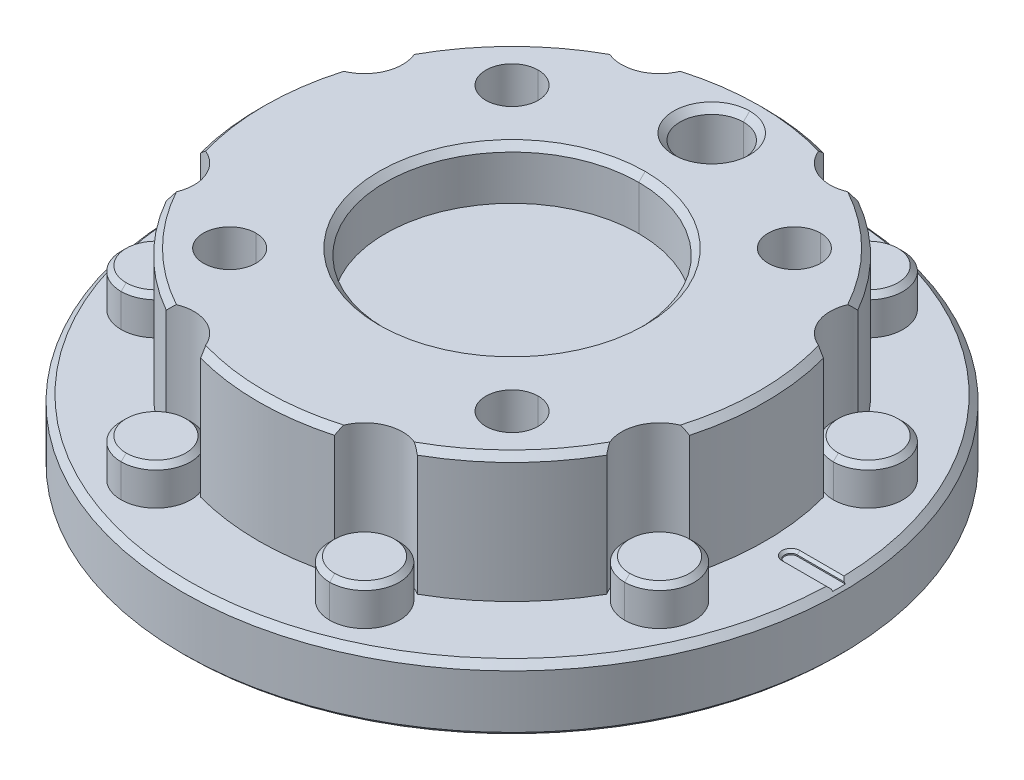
ISO-10303-21;
HEADER;
FILE_DESCRIPTION(('STEP AP214'),'2;1');
FILE_NAME('part.step','',(''),(''),'','','');
FILE_SCHEMA(('AUTOMOTIVE_DESIGN { 1 0 10303 214 1 1 1 1 }'));
ENDSEC;
DATA;
#1=APPLICATION_CONTEXT('core data for automotive mechanical design processes');
#2=APPLICATION_PROTOCOL_DEFINITION('international standard','automotive_design',2000,#1);
#3=PRODUCT_CONTEXT('',#1,'mechanical');
#4=PRODUCT('Part','Part','',(#3));
#5=PRODUCT_RELATED_PRODUCT_CATEGORY('part','',(#4));
#6=PRODUCT_DEFINITION_FORMATION('','',#4);
#7=PRODUCT_DEFINITION_CONTEXT('part definition',#1,'design');
#8=PRODUCT_DEFINITION('design','',#6,#7);
#9=PRODUCT_DEFINITION_SHAPE('','',#8);
#10=(LENGTH_UNIT() NAMED_UNIT(*) SI_UNIT(.MILLI.,.METRE.));
#11=(NAMED_UNIT(*) PLANE_ANGLE_UNIT() SI_UNIT($,.RADIAN.));
#12=(NAMED_UNIT(*) SI_UNIT($,.STERADIAN.) SOLID_ANGLE_UNIT());
#13=UNCERTAINTY_MEASURE_WITH_UNIT(LENGTH_MEASURE(1.E-05),#10,'distance_accuracy_value','');
#14=(GEOMETRIC_REPRESENTATION_CONTEXT(3) GLOBAL_UNCERTAINTY_ASSIGNED_CONTEXT((#13)) GLOBAL_UNIT_ASSIGNED_CONTEXT((#10,
#11,#12)) REPRESENTATION_CONTEXT('',''));
#15=CARTESIAN_POINT('',(0.,0.,0.));
#16=DIRECTION('',(0.,0.,1.));
#17=DIRECTION('',(1.,0.,0.));
#18=AXIS2_PLACEMENT_3D('',#15,#16,#17);
#19=CARTESIAN_POINT('',(0.,14.75,0.));
#20=DIRECTION('',(0.,-1.,0.));
#21=DIRECTION('',(0.,0.,-1.));
#22=AXIS2_PLACEMENT_3D('',#19,#20,#21);
#23=CONICAL_SURFACE('',#22,19.75,0.7853981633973);
#24=CARTESIAN_POINT('',(17.094504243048,15.,9.38231979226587));
#25=CARTESIAN_POINT('',(17.1035542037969,14.9816241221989,9.40402212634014));
#26=CARTESIAN_POINT('',(17.1128231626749,14.9631294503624,9.42553206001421));
#27=CARTESIAN_POINT('',(17.1320125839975,14.9254762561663,9.46867698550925));
#28=CARTESIAN_POINT('',(17.1419433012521,14.9063124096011,9.49030277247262));
#29=CARTESIAN_POINT('',(17.1624748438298,14.8673210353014,9.53365631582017));
#30=CARTESIAN_POINT('',(17.1730858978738,14.8474884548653,9.55537467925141));
#31=CARTESIAN_POINT('',(17.1949964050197,14.807159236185,9.59888891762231));
#32=CARTESIAN_POINT('',(17.2063060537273,14.7866577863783,9.62067519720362));
#33=CARTESIAN_POINT('',(17.2296314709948,14.7449906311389,9.66429964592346));
#34=CARTESIAN_POINT('',(17.2416573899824,14.7238203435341,9.68612800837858));
#35=CARTESIAN_POINT('',(17.2664324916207,14.6808152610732,9.72980975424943));
#36=CARTESIAN_POINT('',(17.2791917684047,14.6589760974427,9.7516531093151));
#37=CARTESIAN_POINT('',(17.3054500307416,14.6146331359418,9.79533676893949));
#38=CARTESIAN_POINT('',(17.3189590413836,14.5921251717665,9.81716681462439));
#39=CARTESIAN_POINT('',(17.3467325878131,14.5464441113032,9.86079442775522));
#40=CARTESIAN_POINT('',(17.3610070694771,14.5232670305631,9.88258149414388));
#41=CARTESIAN_POINT('',(17.3755156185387,14.5,9.9041131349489));
#42=B_SPLINE_CURVE_WITH_KNOTS('',3,(#24,#25,#26,#27,#28,#29,#30,#31,#32,#33,#34,#35,#36,#37,#38,
#39,#40,#41),.UNSPECIFIED.,.F.,.F.,(4,2,2,2,2,2,2,2,4),(0.,0.0895248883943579,0.181180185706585,
0.274973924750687,0.370913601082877,0.46900621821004,0.569258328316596,0.671676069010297,
0.776265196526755),.UNSPECIFIED.);
#43=CARTESIAN_POINT('',(17.09450424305,15.,9.382319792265));
#44=VERTEX_POINT('',#43);
#45=CARTESIAN_POINT('',(17.37551561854,14.5,9.904113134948));
#46=VERTEX_POINT('',#45);
#47=EDGE_CURVE('E1544',#44,#46,#42,.T.);
#48=ORIENTED_EDGE('',*,*,#47,.F.);
#49=CARTESIAN_POINT('',(0.,15.,0.));
#50=DIRECTION('',(0.,1.,0.));
#51=DIRECTION('',(0.481144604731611,0.,0.87664124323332));
#52=AXIS2_PLACEMENT_3D('',#49,#50,#51);
#53=CIRCLE('',#52,19.5);
#54=CARTESIAN_POINT('',(9.382319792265,15.,17.09450424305));
#55=VERTEX_POINT('',#54);
#56=EDGE_CURVE('E40',#55,#44,#53,.T.);
#57=ORIENTED_EDGE('',*,*,#56,.F.);
#58=CARTESIAN_POINT('',(9.90411313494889,14.5,17.3755156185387));
#59=CARTESIAN_POINT('',(9.88258149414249,14.5232670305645,17.3610070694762));
#60=CARTESIAN_POINT('',(9.86079442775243,14.5464441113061,17.3467325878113));
#61=CARTESIAN_POINT('',(9.81716681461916,14.5921251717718,17.3189590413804));
#62=CARTESIAN_POINT('',(9.79533676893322,14.6146331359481,17.3054500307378));
#63=CARTESIAN_POINT('',(9.75165310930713,14.6589760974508,17.2791917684));
#64=CARTESIAN_POINT('',(9.7298097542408,14.6808152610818,17.2664324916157));
#65=CARTESIAN_POINT('',(9.68612800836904,14.7238203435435,17.2416573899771));
#66=CARTESIAN_POINT('',(9.66429964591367,14.7449906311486,17.2296314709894));
#67=CARTESIAN_POINT('',(9.62067519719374,14.786657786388,17.2063060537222));
#68=CARTESIAN_POINT('',(9.59888891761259,14.8071592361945,17.1949964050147));
#69=CARTESIAN_POINT('',(9.55537467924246,14.847488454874,17.1730858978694));
#70=CARTESIAN_POINT('',(9.53365631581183,14.8673210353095,17.1624748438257));
#71=CARTESIAN_POINT('',(9.49030277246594,14.9063124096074,17.141943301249));
#72=CARTESIAN_POINT('',(9.46867698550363,14.9254762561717,17.132012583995));
#73=CARTESIAN_POINT('',(9.42553206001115,14.9631294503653,17.1128231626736));
#74=CARTESIAN_POINT('',(9.4040221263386,14.9816241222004,17.1035542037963));
#75=CARTESIAN_POINT('',(9.38231979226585,15.,17.094504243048));
#76=B_SPLINE_CURVE_WITH_KNOTS('',3,(#58,#59,#60,#61,#62,#63,#64,#65,#66,#67,#68,#69,#70,#71,#72,
#73,#74,#75),.UNSPECIFIED.,.F.,.F.,(4,2,2,2,2,2,2,2,4),(0.,0.104589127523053,0.207006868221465,
0.307258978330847,0.405351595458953,0.501291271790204,0.59508501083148,0.686740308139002,
0.776265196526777),.UNSPECIFIED.);
#77=CARTESIAN_POINT('',(9.904113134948,14.5,17.37551561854));
#78=VERTEX_POINT('',#77);
#79=EDGE_CURVE('E1570',#78,#55,#76,.T.);
#80=ORIENTED_EDGE('',*,*,#79,.F.);
#81=CARTESIAN_POINT('',(0.,14.5,0.));
#82=DIRECTION('',(0.,1.,0.));
#83=DIRECTION('',(0.495205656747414,0.,0.868775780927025));
#84=AXIS2_PLACEMENT_3D('',#81,#82,#83);
#85=CIRCLE('',#84,20.);
#86=EDGE_CURVE('E10',#78,#46,#85,.T.);
#87=ORIENTED_EDGE('',*,*,#86,.T.);
#88=EDGE_LOOP('',(#48,#57,#80,#87));
#89=FACE_BOUND('',#88,.T.);
#90=ADVANCED_FACE('F15',(#89),#23,.T.);
#91=CARTESIAN_POINT('',(0.,0.,0.));
#92=DIRECTION('',(0.,-1.,0.));
#93=DIRECTION('',(0.,0.,-1.));
#94=AXIS2_PLACEMENT_3D('',#91,#92,#93);
#95=CYLINDRICAL_SURFACE('',#94,20.);
#96=DIRECTION('',(0.,-1.,0.));
#97=VECTOR('',#96,1.);
#98=CARTESIAN_POINT('',(17.37551561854,14.5,9.904113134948));
#99=LINE('',#98,#97);
#100=CARTESIAN_POINT('',(17.37551561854,5.,9.904113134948));
#101=VERTEX_POINT('',#100);
#102=EDGE_CURVE('E1560',#46,#101,#99,.T.);
#103=ORIENTED_EDGE('',*,*,#102,.F.);
#104=ORIENTED_EDGE('',*,*,#86,.F.);
#105=DIRECTION('',(0.,1.,0.));
#106=VECTOR('',#105,1.);
#107=CARTESIAN_POINT('',(9.904113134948,5.,17.37551561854));
#108=LINE('',#107,#106);
#109=CARTESIAN_POINT('',(9.904113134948,5.,17.37551561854));
#110=VERTEX_POINT('',#109);
#111=EDGE_CURVE('E1032',#110,#78,#108,.T.);
#112=ORIENTED_EDGE('',*,*,#111,.F.);
#113=CARTESIAN_POINT('',(0.,5.,0.));
#114=DIRECTION('',(0.,-1.,0.));
#115=DIRECTION('',(0.868775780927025,0.,0.495205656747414));
#116=AXIS2_PLACEMENT_3D('',#113,#114,#115);
#117=CIRCLE('',#116,20.);
#118=EDGE_CURVE('E1047',#101,#110,#117,.T.);
#119=ORIENTED_EDGE('',*,*,#118,.F.);
#120=EDGE_LOOP('',(#103,#104,#112,#119));
#121=FACE_BOUND('',#120,.T.);
#122=ADVANCED_FACE('F3552',(#121),#95,.T.);
#123=CARTESIAN_POINT('',(20.,5.,0.));
#124=DIRECTION('',(0.,-1.,0.));
#125=DIRECTION('',(0.,0.,-1.));
#126=AXIS2_PLACEMENT_3D('',#123,#124,#125);
#127=PLANE('',#126);
#128=DIRECTION('',(1.,0.,0.));
#129=VECTOR('',#128,1.);
#130=CARTESIAN_POINT('',(22.,5.,-0.7));
#131=LINE('',#130,#129);
#132=CARTESIAN_POINT('',(22.,5.,-0.7));
#133=VERTEX_POINT('',#132);
#134=CARTESIAN_POINT('',(25.49039034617,5.,-0.7));
#135=VERTEX_POINT('',#134);
#136=EDGE_CURVE('E26',#133,#135,#131,.T.);
#137=ORIENTED_EDGE('',*,*,#136,.T.);
#138=CARTESIAN_POINT('',(0.,5.,0.));
#139=DIRECTION('',(0.,1.,0.));
#140=DIRECTION('',(0.999623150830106,0.,-0.0274509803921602));
#141=AXIS2_PLACEMENT_3D('',#138,#139,#140);
#142=CIRCLE('',#141,25.5);
#143=CARTESIAN_POINT('',(2.5,5.,-25.3771550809));
#144=VERTEX_POINT('',#143);
#145=EDGE_CURVE('E943',#135,#144,#142,.T.);
#146=ORIENTED_EDGE('',*,*,#145,.T.);
#147=DIRECTION('',(0.,0.,-1.));
#148=VECTOR('',#147,1.);
#149=CARTESIAN_POINT('',(2.5,5.,-24.5));
#150=LINE('',#149,#148);
#151=CARTESIAN_POINT('',(2.5,5.,-24.5));
#152=VERTEX_POINT('',#151);
#153=EDGE_CURVE('E896',#152,#144,#150,.T.);
#154=ORIENTED_EDGE('',*,*,#153,.F.);
#155=CARTESIAN_POINT('',(0.,5.,-24.5));
#156=DIRECTION('',(0.,-1.,0.));
#157=DIRECTION('',(1.,0.,0.));
#158=AXIS2_PLACEMENT_3D('',#155,#156,#157);
#159=CIRCLE('',#158,2.5);
#160=CARTESIAN_POINT('',(0.,5.,-22.));
#161=VERTEX_POINT('',#160);
#162=EDGE_CURVE('E940',#152,#161,#159,.T.);
#163=ORIENTED_EDGE('',*,*,#162,.T.);
#164=CARTESIAN_POINT('',(0.,5.,-24.5));
#165=DIRECTION('',(0.,-1.,0.));
#166=DIRECTION('',(0.,0.,1.));
#167=AXIS2_PLACEMENT_3D('',#164,#165,#166);
#168=CIRCLE('',#167,2.5);
#169=CARTESIAN_POINT('',(-2.5,5.,-24.5));
#170=VERTEX_POINT('',#169);
#171=EDGE_CURVE('E944',#161,#170,#168,.T.);
#172=ORIENTED_EDGE('',*,*,#171,.T.);
#173=DIRECTION('',(0.,0.,1.));
#174=VECTOR('',#173,1.);
#175=CARTESIAN_POINT('',(-2.5,5.,-25.3771550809));
#176=LINE('',#175,#174);
#177=CARTESIAN_POINT('',(-2.5,5.,-25.3771550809));
#178=VERTEX_POINT('',#177);
#179=EDGE_CURVE('E1101',#178,#170,#176,.T.);
#180=ORIENTED_EDGE('',*,*,#179,.F.);
#181=CARTESIAN_POINT('',(0.,5.,0.));
#182=DIRECTION('',(0.,1.,0.));
#183=DIRECTION('',(-0.0980392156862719,0.,-0.995182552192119));
#184=AXIS2_PLACEMENT_3D('',#181,#182,#183);
#185=CIRCLE('',#184,25.5);
#186=CARTESIAN_POINT('',(0.,5.,25.5));
#187=VERTEX_POINT('',#186);
#188=EDGE_CURVE('E4555',#178,#187,#185,.T.);
#189=ORIENTED_EDGE('',*,*,#188,.T.);
#190=CARTESIAN_POINT('',(0.,5.,0.));
#191=DIRECTION('',(0.,1.,0.));
#192=DIRECTION('',(0.,0.,1.));
#193=AXIS2_PLACEMENT_3D('',#190,#191,#192);
#194=CIRCLE('',#193,25.5);
#195=CARTESIAN_POINT('',(25.49039034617,5.,0.7));
#196=VERTEX_POINT('',#195);
#197=EDGE_CURVE('E4558',#187,#196,#194,.T.);
#198=ORIENTED_EDGE('',*,*,#197,.T.);
#199=DIRECTION('',(-1.,0.,0.));
#200=VECTOR('',#199,1.);
#201=CARTESIAN_POINT('',(25.49039034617,5.,0.7));
#202=LINE('',#201,#200);
#203=CARTESIAN_POINT('',(22.,5.,0.7));
#204=VERTEX_POINT('',#203);
#205=EDGE_CURVE('E1656',#196,#204,#202,.T.);
#206=ORIENTED_EDGE('',*,*,#205,.T.);
#207=CARTESIAN_POINT('',(22.,5.,0.));
#208=DIRECTION('',(0.,-1.,0.));
#209=DIRECTION('',(0.,0.,1.));
#210=AXIS2_PLACEMENT_3D('',#207,#208,#209);
#211=CIRCLE('',#210,0.7);
#212=EDGE_CURVE('E1427',#204,#133,#211,.T.);
#213=ORIENTED_EDGE('',*,*,#212,.T.);
#214=EDGE_LOOP('',(#137,#146,#154,#163,#172,#180,#189,#198,#206,#213));
#215=FACE_BOUND('',#214,.T.);
#216=CARTESIAN_POINT('',(19.86340994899,5.,8.227693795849));
#217=DIRECTION('',(0.,-1.,0.));
#218=DIRECTION('',(0.,0.,1.));
#219=AXIS2_PLACEMENT_3D('',#216,#217,#218);
#220=CIRCLE('',#219,2.75);
#221=CARTESIAN_POINT('',(19.86340994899,5.,10.97769379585));
#222=VERTEX_POINT('',#221);
#223=CARTESIAN_POINT('',(19.86340994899,5.,5.477693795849));
#224=VERTEX_POINT('',#223);
#225=EDGE_CURVE('E1300',#222,#224,#220,.T.);
#226=ORIENTED_EDGE('',*,*,#225,.T.);
#227=CARTESIAN_POINT('',(19.86340994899,5.,8.227693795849));
#228=DIRECTION('',(0.,-1.,0.));
#229=DIRECTION('',(0.,0.,-1.));
#230=AXIS2_PLACEMENT_3D('',#227,#228,#229);
#231=CIRCLE('',#230,2.75);
#232=EDGE_CURVE('E1297',#224,#222,#231,.T.);
#233=ORIENTED_EDGE('',*,*,#232,.T.);
#234=EDGE_LOOP('',(#226,#233));
#235=FACE_BOUND('',#234,.T.);
#236=CARTESIAN_POINT('',(8.227693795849,5.,19.86340994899));
#237=DIRECTION('',(0.,-1.,0.));
#238=DIRECTION('',(0.,0.,1.));
#239=AXIS2_PLACEMENT_3D('',#236,#237,#238);
#240=CIRCLE('',#239,2.75);
#241=CARTESIAN_POINT('',(8.227693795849,5.,22.61340994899));
#242=VERTEX_POINT('',#241);
#243=CARTESIAN_POINT('',(8.227693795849,5.,17.11340994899));
#244=VERTEX_POINT('',#243);
#245=EDGE_CURVE('E1301',#242,#244,#240,.T.);
#246=ORIENTED_EDGE('',*,*,#245,.T.);
#247=CARTESIAN_POINT('',(8.227693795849,5.,19.86340994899));
#248=DIRECTION('',(0.,-1.,0.));
#249=DIRECTION('',(0.,0.,-1.));
#250=AXIS2_PLACEMENT_3D('',#247,#248,#249);
#251=CIRCLE('',#250,2.75);
#252=EDGE_CURVE('E1362',#244,#242,#251,.T.);
#253=ORIENTED_EDGE('',*,*,#252,.T.);
#254=EDGE_LOOP('',(#246,#253));
#255=FACE_BOUND('',#254,.T.);
#256=CARTESIAN_POINT('',(-8.227693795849,5.,19.86340994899));
#257=DIRECTION('',(0.,-1.,0.));
#258=DIRECTION('',(0.,0.,1.));
#259=AXIS2_PLACEMENT_3D('',#256,#257,#258);
#260=CIRCLE('',#259,2.75);
#261=CARTESIAN_POINT('',(-8.227693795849,5.,22.61340994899));
#262=VERTEX_POINT('',#261);
#263=CARTESIAN_POINT('',(-8.227693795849,5.,17.11340994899));
#264=VERTEX_POINT('',#263);
#265=EDGE_CURVE('E1713',#262,#264,#260,.T.);
#266=ORIENTED_EDGE('',*,*,#265,.T.);
#267=CARTESIAN_POINT('',(-8.227693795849,5.,19.86340994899));
#268=DIRECTION('',(0.,-1.,0.));
#269=DIRECTION('',(0.,0.,-1.));
#270=AXIS2_PLACEMENT_3D('',#267,#268,#269);
#271=CIRCLE('',#270,2.75);
#272=EDGE_CURVE('E1710',#264,#262,#271,.T.);
#273=ORIENTED_EDGE('',*,*,#272,.T.);
#274=EDGE_LOOP('',(#266,#273));
#275=FACE_BOUND('',#274,.T.);
#276=CARTESIAN_POINT('',(-19.86340994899,5.,8.227693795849));
#277=DIRECTION('',(0.,-1.,0.));
#278=DIRECTION('',(0.,0.,1.));
#279=AXIS2_PLACEMENT_3D('',#276,#277,#278);
#280=CIRCLE('',#279,2.75);
#281=CARTESIAN_POINT('',(-19.86340994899,5.,10.97769379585));
#282=VERTEX_POINT('',#281);
#283=CARTESIAN_POINT('',(-19.86340994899,5.,5.477693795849));
#284=VERTEX_POINT('',#283);
#285=EDGE_CURVE('E1683',#282,#284,#280,.T.);
#286=ORIENTED_EDGE('',*,*,#285,.T.);
#287=CARTESIAN_POINT('',(-19.86340994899,5.,8.227693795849));
#288=DIRECTION('',(0.,-1.,0.));
#289=DIRECTION('',(0.,0.,-1.));
#290=AXIS2_PLACEMENT_3D('',#287,#288,#289);
#291=CIRCLE('',#290,2.75);
#292=EDGE_CURVE('E1149',#284,#282,#291,.T.);
#293=ORIENTED_EDGE('',*,*,#292,.T.);
#294=EDGE_LOOP('',(#286,#293));
#295=FACE_BOUND('',#294,.T.);
#296=CARTESIAN_POINT('',(-19.86340994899,5.,-8.227693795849));
#297=DIRECTION('',(0.,-1.,0.));
#298=DIRECTION('',(0.,0.,1.));
#299=AXIS2_PLACEMENT_3D('',#296,#297,#298);
#300=CIRCLE('',#299,2.75);
#301=CARTESIAN_POINT('',(-19.86340994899,5.,-5.477693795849));
#302=VERTEX_POINT('',#301);
#303=CARTESIAN_POINT('',(-19.86340994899,5.,-10.97769379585));
#304=VERTEX_POINT('',#303);
#305=EDGE_CURVE('E1145',#302,#304,#300,.T.);
#306=ORIENTED_EDGE('',*,*,#305,.T.);
#307=CARTESIAN_POINT('',(-19.86340994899,5.,-8.227693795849));
#308=DIRECTION('',(0.,-1.,0.));
#309=DIRECTION('',(0.,0.,-1.));
#310=AXIS2_PLACEMENT_3D('',#307,#308,#309);
#311=CIRCLE('',#310,2.75);
#312=EDGE_CURVE('E1150',#304,#302,#311,.T.);
#313=ORIENTED_EDGE('',*,*,#312,.T.);
#314=EDGE_LOOP('',(#306,#313));
#315=FACE_BOUND('',#314,.T.);
#316=CARTESIAN_POINT('',(-8.227693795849,5.,-19.86340994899));
#317=DIRECTION('',(0.,-1.,0.));
#318=DIRECTION('',(0.,0.,1.));
#319=AXIS2_PLACEMENT_3D('',#316,#317,#318);
#320=CIRCLE('',#319,2.75);
#321=CARTESIAN_POINT('',(-8.227693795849,5.,-17.11340994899));
#322=VERTEX_POINT('',#321);
#323=CARTESIAN_POINT('',(-8.227693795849,5.,-22.61340994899));
#324=VERTEX_POINT('',#323);
#325=EDGE_CURVE('E4570',#322,#324,#320,.T.);
#326=ORIENTED_EDGE('',*,*,#325,.T.);
#327=CARTESIAN_POINT('',(-8.227693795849,5.,-19.86340994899));
#328=DIRECTION('',(0.,-1.,0.));
#329=DIRECTION('',(0.,0.,-1.));
#330=AXIS2_PLACEMENT_3D('',#327,#328,#329);
#331=CIRCLE('',#330,2.75);
#332=EDGE_CURVE('E1423',#324,#322,#331,.T.);
#333=ORIENTED_EDGE('',*,*,#332,.T.);
#334=EDGE_LOOP('',(#326,#333));
#335=FACE_BOUND('',#334,.T.);
#336=CARTESIAN_POINT('',(8.227693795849,5.,-19.86340994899));
#337=DIRECTION('',(0.,-1.,0.));
#338=DIRECTION('',(0.,0.,1.));
#339=AXIS2_PLACEMENT_3D('',#336,#337,#338);
#340=CIRCLE('',#339,2.75);
#341=CARTESIAN_POINT('',(8.227693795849,5.,-17.11340994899));
#342=VERTEX_POINT('',#341);
#343=CARTESIAN_POINT('',(8.227693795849,5.,-22.61340994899));
#344=VERTEX_POINT('',#343);
#345=EDGE_CURVE('E1407',#342,#344,#340,.T.);
#346=ORIENTED_EDGE('',*,*,#345,.T.);
#347=CARTESIAN_POINT('',(8.227693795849,5.,-19.86340994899));
#348=DIRECTION('',(0.,-1.,0.));
#349=DIRECTION('',(0.,0.,-1.));
#350=AXIS2_PLACEMENT_3D('',#347,#348,#349);
#351=CIRCLE('',#350,2.75);
#352=EDGE_CURVE('E1236',#344,#342,#351,.T.);
#353=ORIENTED_EDGE('',*,*,#352,.T.);
#354=EDGE_LOOP('',(#346,#353));
#355=FACE_BOUND('',#354,.T.);
#356=CARTESIAN_POINT('',(19.86340994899,5.,-8.227693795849));
#357=DIRECTION('',(0.,-1.,0.));
#358=DIRECTION('',(0.,0.,1.));
#359=AXIS2_PLACEMENT_3D('',#356,#357,#358);
#360=CIRCLE('',#359,2.75);
#361=CARTESIAN_POINT('',(19.86340994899,5.,-5.477693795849));
#362=VERTEX_POINT('',#361);
#363=CARTESIAN_POINT('',(19.86340994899,5.,-10.97769379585));
#364=VERTEX_POINT('',#363);
#365=EDGE_CURVE('E1232',#362,#364,#360,.T.);
#366=ORIENTED_EDGE('',*,*,#365,.T.);
#367=CARTESIAN_POINT('',(19.86340994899,5.,-8.227693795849));
#368=DIRECTION('',(0.,-1.,0.));
#369=DIRECTION('',(0.,0.,-1.));
#370=AXIS2_PLACEMENT_3D('',#367,#368,#369);
#371=CIRCLE('',#370,2.75);
#372=EDGE_CURVE('E1085',#364,#362,#371,.T.);
#373=ORIENTED_EDGE('',*,*,#372,.T.);
#374=EDGE_LOOP('',(#366,#373));
#375=FACE_BOUND('',#374,.T.);
#376=CARTESIAN_POINT('',(19.86340994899,5.,8.227693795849));
#377=DIRECTION('',(0.,1.,0.));
#378=DIRECTION('',(-0.191266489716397,0.,-0.981538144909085));
#379=AXIS2_PLACEMENT_3D('',#376,#377,#378);
#380=CIRCLE('',#379,3.);
#381=CARTESIAN_POINT('',(19.28961047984,5.,5.283079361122));
#382=VERTEX_POINT('',#381);
#383=CARTESIAN_POINT('',(16.86340994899,5.,8.227693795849));
#384=VERTEX_POINT('',#383);
#385=EDGE_CURVE('E1046',#382,#384,#380,.T.);
#386=ORIENTED_EDGE('',*,*,#385,.T.);
#387=CARTESIAN_POINT('',(19.86340994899,5.,8.227693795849));
#388=DIRECTION('',(0.,1.,0.));
#389=DIRECTION('',(-1.,0.,0.));
#390=AXIS2_PLACEMENT_3D('',#387,#388,#389);
#391=CIRCLE('',#390,3.);
#392=EDGE_CURVE('E1042',#384,#101,#391,.T.);
#393=ORIENTED_EDGE('',*,*,#392,.T.);
#394=ORIENTED_EDGE('',*,*,#118,.T.);
#395=CARTESIAN_POINT('',(8.227693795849,5.,19.86340994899));
#396=DIRECTION('',(0.,1.,0.));
#397=DIRECTION('',(0.558806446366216,0.,-0.829298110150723));
#398=AXIS2_PLACEMENT_3D('',#395,#396,#397);
#399=CIRCLE('',#398,3.);
#400=CARTESIAN_POINT('',(8.227693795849,5.,16.86340994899));
#401=VERTEX_POINT('',#400);
#402=EDGE_CURVE('E900',#110,#401,#399,.T.);
#403=ORIENTED_EDGE('',*,*,#402,.T.);
#404=CARTESIAN_POINT('',(8.227693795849,5.,19.86340994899));
#405=DIRECTION('',(0.,1.,0.));
#406=DIRECTION('',(0.,0.,-1.));
#407=AXIS2_PLACEMENT_3D('',#404,#405,#406);
#408=CIRCLE('',#407,3.);
#409=CARTESIAN_POINT('',(5.283079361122,5.,19.28961047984));
#410=VERTEX_POINT('',#409);
#411=EDGE_CURVE('E897',#401,#410,#408,.T.);
#412=ORIENTED_EDGE('',*,*,#411,.T.);
#413=CARTESIAN_POINT('',(0.,5.,0.));
#414=DIRECTION('',(0.,-1.,0.));
#415=DIRECTION('',(0.264153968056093,0.,0.964480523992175));
#416=AXIS2_PLACEMENT_3D('',#413,#414,#415);
#417=CIRCLE('',#416,20.);
#418=CARTESIAN_POINT('',(0.,5.,20.));
#419=VERTEX_POINT('',#418);
#420=EDGE_CURVE('E732',#410,#419,#417,.T.);
#421=ORIENTED_EDGE('',*,*,#420,.T.);
#422=CARTESIAN_POINT('',(0.,5.,0.));
#423=DIRECTION('',(0.,-1.,0.));
#424=DIRECTION('',(0.,0.,1.));
#425=AXIS2_PLACEMENT_3D('',#422,#423,#424);
#426=CIRCLE('',#425,20.);
#427=CARTESIAN_POINT('',(-5.283079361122,5.,19.28961047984));
#428=VERTEX_POINT('',#427);
#429=EDGE_CURVE('E727',#419,#428,#426,.T.);
#430=ORIENTED_EDGE('',*,*,#429,.T.);
#431=CARTESIAN_POINT('',(-8.227693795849,5.,19.86340994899));
#432=DIRECTION('',(0.,1.,0.));
#433=DIRECTION('',(0.981538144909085,0.,-0.191266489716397));
#434=AXIS2_PLACEMENT_3D('',#431,#432,#433);
#435=CIRCLE('',#434,3.);
#436=CARTESIAN_POINT('',(-8.227693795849,5.,16.86340994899));
#437=VERTEX_POINT('',#436);
#438=EDGE_CURVE('E715',#428,#437,#435,.T.);
#439=ORIENTED_EDGE('',*,*,#438,.T.);
#440=CARTESIAN_POINT('',(-8.227693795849,5.,19.86340994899));
#441=DIRECTION('',(0.,1.,0.));
#442=DIRECTION('',(0.,0.,-1.));
#443=AXIS2_PLACEMENT_3D('',#440,#441,#442);
#444=CIRCLE('',#443,3.);
#445=CARTESIAN_POINT('',(-9.904113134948,5.,17.37551561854));
#446=VERTEX_POINT('',#445);
#447=EDGE_CURVE('E724',#437,#446,#444,.T.);
#448=ORIENTED_EDGE('',*,*,#447,.T.);
#449=CARTESIAN_POINT('',(0.,5.,0.));
#450=DIRECTION('',(0.,-1.,0.));
#451=DIRECTION('',(-0.495205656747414,0.,0.868775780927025));
#452=AXIS2_PLACEMENT_3D('',#449,#450,#451);
#453=CIRCLE('',#452,20.);
#454=CARTESIAN_POINT('',(-17.37551561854,5.,9.904113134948));
#455=VERTEX_POINT('',#454);
#456=EDGE_CURVE('E1010',#446,#455,#453,.T.);
#457=ORIENTED_EDGE('',*,*,#456,.T.);
#458=CARTESIAN_POINT('',(-19.86340994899,5.,8.227693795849));
#459=DIRECTION('',(0.,1.,0.));
#460=DIRECTION('',(0.829298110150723,0.,0.558806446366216));
#461=AXIS2_PLACEMENT_3D('',#458,#459,#460);
#462=CIRCLE('',#461,3.);
#463=CARTESIAN_POINT('',(-19.28961047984,5.,5.283079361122));
#464=VERTEX_POINT('',#463);
#465=EDGE_CURVE('E995',#455,#464,#462,.T.);
#466=ORIENTED_EDGE('',*,*,#465,.T.);
#467=CARTESIAN_POINT('',(0.,5.,0.));
#468=DIRECTION('',(0.,-1.,0.));
#469=DIRECTION('',(-0.964480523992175,0.,0.264153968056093));
#470=AXIS2_PLACEMENT_3D('',#467,#468,#469);
#471=CIRCLE('',#470,20.);
#472=CARTESIAN_POINT('',(-19.28961047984,5.,-5.283079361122));
#473=VERTEX_POINT('',#472);
#474=EDGE_CURVE('E991',#464,#473,#471,.T.);
#475=ORIENTED_EDGE('',*,*,#474,.T.);
#476=CARTESIAN_POINT('',(-19.86340994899,5.,-8.227693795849));
#477=DIRECTION('',(0.,1.,0.));
#478=DIRECTION('',(0.191266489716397,0.,0.981538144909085));
#479=AXIS2_PLACEMENT_3D('',#476,#477,#478);
#480=CIRCLE('',#479,3.);
#481=CARTESIAN_POINT('',(-17.37551561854,5.,-9.904113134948));
#482=VERTEX_POINT('',#481);
#483=EDGE_CURVE('E996',#473,#482,#480,.T.);
#484=ORIENTED_EDGE('',*,*,#483,.T.);
#485=CARTESIAN_POINT('',(0.,5.,0.));
#486=DIRECTION('',(0.,-1.,0.));
#487=DIRECTION('',(-0.868775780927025,0.,-0.495205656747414));
#488=AXIS2_PLACEMENT_3D('',#485,#486,#487);
#489=CIRCLE('',#488,20.);
#490=CARTESIAN_POINT('',(-9.904113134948,5.,-17.37551561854));
#491=VERTEX_POINT('',#490);
#492=EDGE_CURVE('E1358',#482,#491,#489,.T.);
#493=ORIENTED_EDGE('',*,*,#492,.T.);
#494=CARTESIAN_POINT('',(-8.227693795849,5.,-19.86340994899));
#495=DIRECTION('',(0.,1.,0.));
#496=DIRECTION('',(-0.558806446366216,0.,0.829298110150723));
#497=AXIS2_PLACEMENT_3D('',#494,#495,#496);
#498=CIRCLE('',#497,3.);
#499=CARTESIAN_POINT('',(-8.227693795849,5.,-16.86340994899));
#500=VERTEX_POINT('',#499);
#501=EDGE_CURVE('E1072',#491,#500,#498,.T.);
#502=ORIENTED_EDGE('',*,*,#501,.T.);
#503=CARTESIAN_POINT('',(-8.227693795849,5.,-19.86340994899));
#504=DIRECTION('',(0.,1.,0.));
#505=DIRECTION('',(0.,0.,1.));
#506=AXIS2_PLACEMENT_3D('',#503,#504,#505);
#507=CIRCLE('',#506,3.);
#508=CARTESIAN_POINT('',(-5.283079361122,5.,-19.28961047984));
#509=VERTEX_POINT('',#508);
#510=EDGE_CURVE('E1068',#500,#509,#507,.T.);
#511=ORIENTED_EDGE('',*,*,#510,.T.);
#512=CARTESIAN_POINT('',(0.,5.,0.));
#513=DIRECTION('',(0.,-1.,0.));
#514=DIRECTION('',(-0.264153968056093,0.,-0.964480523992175));
#515=AXIS2_PLACEMENT_3D('',#512,#513,#514);
#516=CIRCLE('',#515,20.);
#517=CARTESIAN_POINT('',(5.283079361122,5.,-19.28961047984));
#518=VERTEX_POINT('',#517);
#519=EDGE_CURVE('E1073',#509,#518,#516,.T.);
#520=ORIENTED_EDGE('',*,*,#519,.T.);
#521=CARTESIAN_POINT('',(8.227693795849,5.,-19.86340994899));
#522=DIRECTION('',(0.,1.,0.));
#523=DIRECTION('',(-0.981538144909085,0.,0.191266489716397));
#524=AXIS2_PLACEMENT_3D('',#521,#522,#523);
#525=CIRCLE('',#524,3.);
#526=CARTESIAN_POINT('',(8.227693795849,5.,-16.86340994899));
#527=VERTEX_POINT('',#526);
#528=EDGE_CURVE('E1348',#518,#527,#525,.T.);
#529=ORIENTED_EDGE('',*,*,#528,.T.);
#530=CARTESIAN_POINT('',(8.227693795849,5.,-19.86340994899));
#531=DIRECTION('',(0.,1.,0.));
#532=DIRECTION('',(0.,0.,1.));
#533=AXIS2_PLACEMENT_3D('',#530,#531,#532);
#534=CIRCLE('',#533,3.);
#535=CARTESIAN_POINT('',(9.904113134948,5.,-17.37551561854));
#536=VERTEX_POINT('',#535);
#537=EDGE_CURVE('E4489',#527,#536,#534,.T.);
#538=ORIENTED_EDGE('',*,*,#537,.T.);
#539=CARTESIAN_POINT('',(0.,5.,0.));
#540=DIRECTION('',(0.,-1.,0.));
#541=DIRECTION('',(0.495205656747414,0.,-0.868775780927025));
#542=AXIS2_PLACEMENT_3D('',#539,#540,#541);
#543=CIRCLE('',#542,20.);
#544=CARTESIAN_POINT('',(17.37551561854,5.,-9.904113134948));
#545=VERTEX_POINT('',#544);
#546=EDGE_CURVE('E1772',#536,#545,#543,.T.);
#547=ORIENTED_EDGE('',*,*,#546,.T.);
#548=CARTESIAN_POINT('',(19.86340994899,5.,-8.227693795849));
#549=DIRECTION('',(0.,1.,0.));
#550=DIRECTION('',(-0.829298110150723,0.,-0.558806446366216));
#551=AXIS2_PLACEMENT_3D('',#548,#549,#550);
#552=CIRCLE('',#551,3.);
#553=CARTESIAN_POINT('',(16.86340994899,5.,-8.227693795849));
#554=VERTEX_POINT('',#553);
#555=EDGE_CURVE('E1019',#545,#554,#552,.T.);
#556=ORIENTED_EDGE('',*,*,#555,.T.);
#557=CARTESIAN_POINT('',(19.86340994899,5.,-8.227693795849));
#558=DIRECTION('',(0.,1.,0.));
#559=DIRECTION('',(-1.,0.,0.));
#560=AXIS2_PLACEMENT_3D('',#557,#558,#559);
#561=CIRCLE('',#560,3.);
#562=CARTESIAN_POINT('',(19.28961047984,5.,-5.283079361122));
#563=VERTEX_POINT('',#562);
#564=EDGE_CURVE('E1015',#554,#563,#561,.T.);
#565=ORIENTED_EDGE('',*,*,#564,.T.);
#566=CARTESIAN_POINT('',(0.,5.,0.));
#567=DIRECTION('',(0.,-1.,0.));
#568=DIRECTION('',(0.964480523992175,0.,-0.264153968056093));
#569=AXIS2_PLACEMENT_3D('',#566,#567,#568);
#570=CIRCLE('',#569,20.);
#571=EDGE_CURVE('E1020',#563,#382,#570,.T.);
#572=ORIENTED_EDGE('',*,*,#571,.T.);
#573=EDGE_LOOP('',(#386,#393,#394,#403,#412,#421,#430,#439,#448,#457,#466,#475,#484,#493,#502,
#511,#520,#529,#538,#547,#556,#565,#572));
#574=FACE_BOUND('',#573,.T.);
#575=ADVANCED_FACE('F730',(#215,#235,#255,#275,#295,#315,#335,#355,#375,#574),#127,.F.);
#576=CARTESIAN_POINT('',(22.,4.9,0.));
#577=DIRECTION('',(0.,1.,0.));
#578=DIRECTION('',(0.,0.,1.));
#579=AXIS2_PLACEMENT_3D('',#576,#577,#578);
#580=CONICAL_SURFACE('',#579,0.6,0.7853981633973);
#581=DIRECTION('',(0.,0.707106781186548,-0.707106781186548));
#582=VECTOR('',#581,1.);
#583=CARTESIAN_POINT('',(22.,4.8,-0.5));
#584=LINE('',#583,#582);
#585=CARTESIAN_POINT('',(22.,4.8,-0.5));
#586=VERTEX_POINT('',#585);
#587=EDGE_CURVE('E1292',#586,#133,#584,.T.);
#588=ORIENTED_EDGE('',*,*,#587,.T.);
#589=ORIENTED_EDGE('',*,*,#212,.F.);
#590=DIRECTION('',(0.,-0.707106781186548,-0.707106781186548));
#591=VECTOR('',#590,1.);
#592=CARTESIAN_POINT('',(22.,5.,0.7));
#593=LINE('',#592,#591);
#594=CARTESIAN_POINT('',(22.,4.8,0.5));
#595=VERTEX_POINT('',#594);
#596=EDGE_CURVE('E1296',#204,#595,#593,.T.);
#597=ORIENTED_EDGE('',*,*,#596,.T.);
#598=CARTESIAN_POINT('',(22.,4.8,0.));
#599=DIRECTION('',(0.,-1.,0.));
#600=DIRECTION('',(0.,0.,1.));
#601=AXIS2_PLACEMENT_3D('',#598,#599,#600);
#602=CIRCLE('',#601,0.5);
#603=EDGE_CURVE('E1306',#595,#586,#602,.T.);
#604=ORIENTED_EDGE('',*,*,#603,.T.);
#605=EDGE_LOOP('',(#588,#589,#597,#604));
#606=FACE_BOUND('',#605,.T.);
#607=ADVANCED_FACE('F3479',(#606),#580,.F.);
#608=CARTESIAN_POINT('',(22.,4.7,0.));
#609=DIRECTION('',(0.,-1.,0.));
#610=DIRECTION('',(0.,0.,-1.));
#611=AXIS2_PLACEMENT_3D('',#608,#609,#610);
#612=CYLINDRICAL_SURFACE('',#611,0.5);
#613=DIRECTION('',(0.,-1.,0.));
#614=VECTOR('',#613,1.);
#615=CARTESIAN_POINT('',(22.,4.8,0.5));
#616=LINE('',#615,#614);
#617=CARTESIAN_POINT('',(22.,4.7,0.5));
#618=VERTEX_POINT('',#617);
#619=EDGE_CURVE('E1302',#595,#618,#616,.T.);
#620=ORIENTED_EDGE('',*,*,#619,.T.);
#621=CARTESIAN_POINT('',(22.,4.7,0.));
#622=DIRECTION('',(0.,1.,0.));
#623=DIRECTION('',(0.,0.,-1.));
#624=AXIS2_PLACEMENT_3D('',#621,#622,#623);
#625=CIRCLE('',#624,0.5);
#626=CARTESIAN_POINT('',(22.,4.7,-0.5));
#627=VERTEX_POINT('',#626);
#628=EDGE_CURVE('E895',#627,#618,#625,.T.);
#629=ORIENTED_EDGE('',*,*,#628,.F.);
#630=DIRECTION('',(0.,1.,0.));
#631=VECTOR('',#630,1.);
#632=CARTESIAN_POINT('',(22.,4.7,-0.5));
#633=LINE('',#632,#631);
#634=EDGE_CURVE('E1001',#627,#586,#633,.T.);
#635=ORIENTED_EDGE('',*,*,#634,.T.);
#636=ORIENTED_EDGE('',*,*,#603,.F.);
#637=EDGE_LOOP('',(#620,#629,#635,#636));
#638=FACE_BOUND('',#637,.T.);
#639=ADVANCED_FACE('F3484',(#638),#612,.F.);
#640=CARTESIAN_POINT('',(32.,4.7,-0.5));
#641=DIRECTION('',(0.,0.,1.));
#642=DIRECTION('',(1.,0.,0.));
#643=AXIS2_PLACEMENT_3D('',#640,#641,#642);
#644=PLANE('',#643);
#645=DIRECTION('',(1.,0.,0.));
#646=VECTOR('',#645,1.);
#647=CARTESIAN_POINT('',(22.,4.8,-0.5));
#648=LINE('',#647,#646);
#649=CARTESIAN_POINT('',(25.69513572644,4.8,-0.5));
#650=VERTEX_POINT('',#649);
#651=EDGE_CURVE('E893',#586,#650,#648,.T.);
#652=ORIENTED_EDGE('',*,*,#651,.F.);
#653=ORIENTED_EDGE('',*,*,#634,.F.);
#654=DIRECTION('',(1.,0.,0.));
#655=VECTOR('',#654,1.);
#656=CARTESIAN_POINT('',(22.,4.7,-0.5));
#657=LINE('',#656,#655);
#658=CARTESIAN_POINT('',(25.79515458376,4.7,-0.5));
#659=VERTEX_POINT('',#658);
#660=EDGE_CURVE('E997',#627,#659,#657,.T.);
#661=ORIENTED_EDGE('',*,*,#660,.T.);
#662=CARTESIAN_POINT('',(25.79515458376,4.7,-0.5));
#663=CARTESIAN_POINT('',(25.76181497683,4.733333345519,-0.5));
#664=CARTESIAN_POINT('',(25.72847535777,4.766666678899,-0.5));
#665=CARTESIAN_POINT('',(25.69513572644,4.8,-0.5));
#666=(BOUNDED_CURVE() B_SPLINE_CURVE(3,(#662,#663,#664,#665),.UNSPECIFIED.,.F.,
.F.) B_SPLINE_CURVE_WITH_KNOTS((4,4),(0.,1.),
.UNSPECIFIED.) CURVE() GEOMETRIC_REPRESENTATION_ITEM() RATIONAL_B_SPLINE_CURVE((1.,1.,1.,1.)) REPRESENTATION_ITEM(''));
#667=EDGE_CURVE('E1002',#659,#650,#666,.T.);
#668=ORIENTED_EDGE('',*,*,#667,.T.);
#669=EDGE_LOOP('',(#652,#653,#661,#668));
#670=FACE_BOUND('',#669,.T.);
#671=ADVANCED_FACE('F3820',(#670),#644,.T.);
#672=CARTESIAN_POINT('',(0.,4.75,0.));
#673=DIRECTION('',(0.,-1.,0.));
#674=DIRECTION('',(0.,0.,-1.));
#675=AXIS2_PLACEMENT_3D('',#672,#673,#674);
#676=CONICAL_SURFACE('',#675,25.75,0.7853981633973);
#677=ORIENTED_EDGE('',*,*,#197,.F.);
#678=ORIENTED_EDGE('',*,*,#188,.F.);
#679=CARTESIAN_POINT('',(-2.,4.5,-25.92296279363));
#680=CARTESIAN_POINT('',(-2.055774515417,4.555774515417,-25.86271943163));
#681=CARTESIAN_POINT('',(-2.167181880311,4.667181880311,-25.74197267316));
#682=CARTESIAN_POINT('',(-2.333848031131,4.833848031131,-25.5600321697));
#683=CARTESIAN_POINT('',(-2.444666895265,4.944666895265,-25.43820711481));
#684=CARTESIAN_POINT('',(-2.5,5.,-25.3771550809));
#685=(BOUNDED_CURVE() B_SPLINE_CURVE(3,(#679,#680,#681,#682,#683,#684),.UNSPECIFIED.,.F.,
.F.) B_SPLINE_CURVE_WITH_KNOTS((4,1,1,4),(0.,0.3333333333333,0.6666666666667,1.),
.UNSPECIFIED.) CURVE() GEOMETRIC_REPRESENTATION_ITEM() RATIONAL_B_SPLINE_CURVE((1.,1.,1.,1.,1.,1.)) REPRESENTATION_ITEM(''));
#686=CARTESIAN_POINT('',(-2.,4.5,-25.92296279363));
#687=VERTEX_POINT('',#686);
#688=EDGE_CURVE('E980',#687,#178,#685,.T.);
#689=ORIENTED_EDGE('',*,*,#688,.F.);
#690=CARTESIAN_POINT('',(0.,4.5,0.));
#691=DIRECTION('',(0.,1.,0.));
#692=DIRECTION('',(-0.0769230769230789,0.,-0.997037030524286));
#693=AXIS2_PLACEMENT_3D('',#690,#691,#692);
#694=CIRCLE('',#693,26.);
#695=CARTESIAN_POINT('',(0.,4.5,26.));
#696=VERTEX_POINT('',#695);
#697=EDGE_CURVE('E1370',#687,#696,#694,.T.);
#698=ORIENTED_EDGE('',*,*,#697,.T.);
#699=CARTESIAN_POINT('',(0.,4.5,0.));
#700=DIRECTION('',(0.,1.,0.));
#701=DIRECTION('',(0.,0.,1.));
#702=AXIS2_PLACEMENT_3D('',#699,#700,#701);
#703=CIRCLE('',#702,26.);
#704=CARTESIAN_POINT('',(2.,4.5,-25.92296279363));
#705=VERTEX_POINT('',#704);
#706=EDGE_CURVE('E1167',#696,#705,#703,.T.);
#707=ORIENTED_EDGE('',*,*,#706,.T.);
#708=CARTESIAN_POINT('',(2.5,5.,-25.3771550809));
#709=CARTESIAN_POINT('',(2.444666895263,4.944666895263,-25.43820711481));
#710=CARTESIAN_POINT('',(2.333848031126,4.833848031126,-25.56003216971));
#711=CARTESIAN_POINT('',(2.167181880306,4.667181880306,-25.74197267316));
#712=CARTESIAN_POINT('',(2.055774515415,4.555774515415,-25.86271943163));
#713=CARTESIAN_POINT('',(2.,4.5,-25.92296279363));
#714=(BOUNDED_CURVE() B_SPLINE_CURVE(3,(#708,#709,#710,#711,#712,#713),.UNSPECIFIED.,.F.,
.F.) B_SPLINE_CURVE_WITH_KNOTS((4,1,1,4),(0.,0.3333333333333,0.6666666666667,1.),
.UNSPECIFIED.) CURVE() GEOMETRIC_REPRESENTATION_ITEM() RATIONAL_B_SPLINE_CURVE((1.,1.,1.,1.,1.,1.)) REPRESENTATION_ITEM(''));
#715=EDGE_CURVE('E1093',#144,#705,#714,.T.);
#716=ORIENTED_EDGE('',*,*,#715,.F.);
#717=ORIENTED_EDGE('',*,*,#145,.F.);
#718=CARTESIAN_POINT('',(25.49039034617,5.,-0.7));
#719=CARTESIAN_POINT('',(25.51314890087,4.97785784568,-0.6778578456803));
#720=CARTESIAN_POINT('',(25.55865987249,4.933520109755,-0.6335201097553));
#721=CARTESIAN_POINT('',(25.62690847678,4.866853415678,-0.566853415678));
#722=CARTESIAN_POINT('',(25.67239529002,4.822302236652,-0.5223022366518));
#723=CARTESIAN_POINT('',(25.69513572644,4.8,-0.5));
#724=(BOUNDED_CURVE() B_SPLINE_CURVE(3,(#718,#719,#720,#721,#722,#723),.UNSPECIFIED.,.F.,
.F.) B_SPLINE_CURVE_WITH_KNOTS((4,1,1,4),(0.,0.3333333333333,0.6666666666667,1.),
.UNSPECIFIED.) CURVE() GEOMETRIC_REPRESENTATION_ITEM() RATIONAL_B_SPLINE_CURVE((1.,1.,1.,1.,1.,1.)) REPRESENTATION_ITEM(''));
#725=EDGE_CURVE('E1161',#135,#650,#724,.T.);
#726=ORIENTED_EDGE('',*,*,#725,.T.);
#727=ORIENTED_EDGE('',*,*,#667,.F.);
#728=CARTESIAN_POINT('',(0.,4.7,0.));
#729=DIRECTION('',(0.,1.,0.));
#730=DIRECTION('',(0.999812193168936,0.,0.0193798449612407));
#731=AXIS2_PLACEMENT_3D('',#728,#729,#730);
#732=CIRCLE('',#731,25.8);
#733=CARTESIAN_POINT('',(25.79515458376,4.7,0.5));
#734=VERTEX_POINT('',#733);
#735=EDGE_CURVE('E1400',#734,#659,#732,.T.);
#736=ORIENTED_EDGE('',*,*,#735,.F.);
#737=CARTESIAN_POINT('',(25.69513572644,4.8,0.5));
#738=CARTESIAN_POINT('',(25.72847535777,4.766666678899,0.5));
#739=CARTESIAN_POINT('',(25.76181497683,4.733333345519,0.5));
#740=CARTESIAN_POINT('',(25.79515458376,4.7,0.5));
#741=(BOUNDED_CURVE() B_SPLINE_CURVE(3,(#737,#738,#739,#740),.UNSPECIFIED.,.F.,
.F.) B_SPLINE_CURVE_WITH_KNOTS((4,4),(0.,1.),
.UNSPECIFIED.) CURVE() GEOMETRIC_REPRESENTATION_ITEM() RATIONAL_B_SPLINE_CURVE((1.,1.,1.,1.)) REPRESENTATION_ITEM(''));
#742=CARTESIAN_POINT('',(25.69513572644,4.8,0.5));
#743=VERTEX_POINT('',#742);
#744=EDGE_CURVE('E912',#743,#734,#741,.T.);
#745=ORIENTED_EDGE('',*,*,#744,.F.);
#746=CARTESIAN_POINT('',(25.69513572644,4.8,0.5));
#747=CARTESIAN_POINT('',(25.67239529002,4.822302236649,0.5223022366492));
#748=CARTESIAN_POINT('',(25.62690847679,4.866853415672,0.5668534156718));
#749=CARTESIAN_POINT('',(25.5586598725,4.933520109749,0.6335201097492));
#750=CARTESIAN_POINT('',(25.51314890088,4.977857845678,0.6778578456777));
#751=CARTESIAN_POINT('',(25.49039034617,5.,0.7));
#752=(BOUNDED_CURVE() B_SPLINE_CURVE(3,(#746,#747,#748,#749,#750,#751),.UNSPECIFIED.,.F.,
.F.) B_SPLINE_CURVE_WITH_KNOTS((4,1,1,4),(0.,0.3333333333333,0.6666666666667,1.),
.UNSPECIFIED.) CURVE() GEOMETRIC_REPRESENTATION_ITEM() RATIONAL_B_SPLINE_CURVE((1.,1.,1.,1.,1.,1.)) REPRESENTATION_ITEM(''));
#753=EDGE_CURVE('E1014',#743,#196,#752,.T.);
#754=ORIENTED_EDGE('',*,*,#753,.T.);
#755=EDGE_LOOP('',(#677,#678,#689,#698,#707,#716,#717,#726,#727,#736,#745,#754));
#756=FACE_BOUND('',#755,.T.);
#757=ADVANCED_FACE('F3825',(#756),#676,.T.);
#758=CARTESIAN_POINT('',(32.,5.2,0.9));
#759=DIRECTION('',(0.,0.707106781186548,-0.707106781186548));
#760=DIRECTION('',(-1.,0.,0.));
#761=AXIS2_PLACEMENT_3D('',#758,#759,#760);
#762=PLANE('',#761);
#763=DIRECTION('',(1.,0.,0.));
#764=VECTOR('',#763,1.);
#765=CARTESIAN_POINT('',(22.,4.8,0.5));
#766=LINE('',#765,#764);
#767=EDGE_CURVE('E918',#595,#743,#766,.T.);
#768=ORIENTED_EDGE('',*,*,#767,.F.);
#769=ORIENTED_EDGE('',*,*,#596,.F.);
#770=ORIENTED_EDGE('',*,*,#205,.F.);
#771=ORIENTED_EDGE('',*,*,#753,.F.);
#772=EDGE_LOOP('',(#768,#769,#770,#771));
#773=FACE_BOUND('',#772,.T.);
#774=ADVANCED_FACE('F3892',(#773),#762,.T.);
#775=CARTESIAN_POINT('',(32.,4.8,0.5));
#776=DIRECTION('',(0.,0.,-1.));
#777=DIRECTION('',(0.,-1.,0.));
#778=AXIS2_PLACEMENT_3D('',#775,#776,#777);
#779=PLANE('',#778);
#780=DIRECTION('',(1.,0.,0.));
#781=VECTOR('',#780,1.);
#782=CARTESIAN_POINT('',(22.,4.7,0.5));
#783=LINE('',#782,#781);
#784=EDGE_CURVE('E919',#618,#734,#783,.T.);
#785=ORIENTED_EDGE('',*,*,#784,.F.);
#786=ORIENTED_EDGE('',*,*,#619,.F.);
#787=ORIENTED_EDGE('',*,*,#767,.T.);
#788=ORIENTED_EDGE('',*,*,#744,.T.);
#789=EDGE_LOOP('',(#785,#786,#787,#788));
#790=FACE_BOUND('',#789,.T.);
#791=ADVANCED_FACE('F3654',(#790),#779,.T.);
#792=CARTESIAN_POINT('',(22.5,4.7,0.));
#793=DIRECTION('',(0.,1.,0.));
#794=DIRECTION('',(1.,0.,0.));
#795=AXIS2_PLACEMENT_3D('',#792,#793,#794);
#796=PLANE('',#795);
#797=ORIENTED_EDGE('',*,*,#784,.T.);
#798=ORIENTED_EDGE('',*,*,#735,.T.);
#799=ORIENTED_EDGE('',*,*,#660,.F.);
#800=ORIENTED_EDGE('',*,*,#628,.T.);
#801=EDGE_LOOP('',(#797,#798,#799,#800));
#802=FACE_BOUND('',#801,.T.);
#803=ADVANCED_FACE('F3648',(#802),#796,.T.);
#804=CARTESIAN_POINT('',(32.,4.8,-0.5));
#805=DIRECTION('',(0.,0.707106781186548,0.707106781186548));
#806=DIRECTION('',(1.,0.,0.));
#807=AXIS2_PLACEMENT_3D('',#804,#805,#806);
#808=PLANE('',#807);
#809=ORIENTED_EDGE('',*,*,#136,.F.);
#810=ORIENTED_EDGE('',*,*,#587,.F.);
#811=ORIENTED_EDGE('',*,*,#651,.T.);
#812=ORIENTED_EDGE('',*,*,#725,.F.);
#813=EDGE_LOOP('',(#809,#810,#811,#812));
#814=FACE_BOUND('',#813,.T.);
#815=ADVANCED_FACE('F3653',(#814),#808,.T.);
#816=CARTESIAN_POINT('',(2.,4.5,-29.5));
#817=DIRECTION('',(0.707106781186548,-0.707106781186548,0.));
#818=DIRECTION('',(0.,0.,-1.));
#819=AXIS2_PLACEMENT_3D('',#816,#817,#818);
#820=PLANE('',#819);
#821=DIRECTION('',(-0.707106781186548,-0.707106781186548,0.));
#822=VECTOR('',#821,1.);
#823=CARTESIAN_POINT('',(2.5,5.,-24.5));
#824=LINE('',#823,#822);
#825=CARTESIAN_POINT('',(2.,4.5,-24.5));
#826=VERTEX_POINT('',#825);
#827=EDGE_CURVE('E1203',#152,#826,#824,.T.);
#828=ORIENTED_EDGE('',*,*,#827,.F.);
#829=ORIENTED_EDGE('',*,*,#153,.T.);
#830=ORIENTED_EDGE('',*,*,#715,.T.);
#831=DIRECTION('',(0.,0.,-1.));
#832=VECTOR('',#831,1.);
#833=CARTESIAN_POINT('',(2.,4.5,-24.5));
#834=LINE('',#833,#832);
#835=EDGE_CURVE('E1810',#826,#705,#834,.T.);
#836=ORIENTED_EDGE('',*,*,#835,.F.);
#837=EDGE_LOOP('',(#828,#829,#830,#836));
#838=FACE_BOUND('',#837,.T.);
#839=ADVANCED_FACE('F3701',(#838),#820,.F.);
#840=CARTESIAN_POINT('',(2.,0.,-29.5));
#841=DIRECTION('',(1.,0.,0.));
#842=DIRECTION('',(0.,1.,0.));
#843=AXIS2_PLACEMENT_3D('',#840,#841,#842);
#844=PLANE('',#843);
#845=DIRECTION('',(0.,0.,-1.));
#846=VECTOR('',#845,1.);
#847=CARTESIAN_POINT('',(2.,0.,-24.71922328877));
#848=LINE('',#847,#846);
#849=CARTESIAN_POINT('',(2.,0.,-24.71922328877));
#850=VERTEX_POINT('',#849);
#851=CARTESIAN_POINT('',(2.,0.,-25.62206080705));
#852=VERTEX_POINT('',#851);
#853=EDGE_CURVE('E1197',#850,#852,#848,.T.);
#854=ORIENTED_EDGE('',*,*,#853,.F.);
#855=CARTESIAN_POINT('',(2.,0.2185028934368,-24.5));
#856=CARTESIAN_POINT('',(2.,0.1942250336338,-24.52435861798));
#857=CARTESIAN_POINT('',(2.,0.1456691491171,-24.57307553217));
#858=CARTESIAN_POINT('',(2.,0.07283484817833,-24.64614995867));
#859=CARTESIAN_POINT('',(2.,0.02427833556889,-24.69486561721));
#860=CARTESIAN_POINT('',(2.,0.,-24.71922328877));
#861=(BOUNDED_CURVE() B_SPLINE_CURVE(3,(#855,#856,#857,#858,#859,#860),.UNSPECIFIED.,.F.,
.F.) B_SPLINE_CURVE_WITH_KNOTS((4,1,1,4),(0.,0.3333333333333,0.6666666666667,1.),
.UNSPECIFIED.) CURVE() GEOMETRIC_REPRESENTATION_ITEM() RATIONAL_B_SPLINE_CURVE((1.,1.,1.,1.,1.,1.)) REPRESENTATION_ITEM(''));
#862=CARTESIAN_POINT('',(2.,0.2185028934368,-24.5));
#863=VERTEX_POINT('',#862);
#864=EDGE_CURVE('E1248',#863,#850,#861,.T.);
#865=ORIENTED_EDGE('',*,*,#864,.F.);
#866=DIRECTION('',(0.,-1.,1.153398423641E-13));
#867=VECTOR('',#866,1.);
#868=CARTESIAN_POINT('',(2.,4.5,-24.5));
#869=LINE('',#868,#867);
#870=EDGE_CURVE('E1211',#826,#863,#869,.T.);
#871=ORIENTED_EDGE('',*,*,#870,.F.);
#872=ORIENTED_EDGE('',*,*,#835,.T.);
#873=DIRECTION('',(0.,1.,0.));
#874=VECTOR('',#873,1.);
#875=CARTESIAN_POINT('',(2.,0.3,-25.92296279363));
#876=LINE('',#875,#874);
#877=CARTESIAN_POINT('',(2.,0.3000000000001,-25.92296279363));
#878=VERTEX_POINT('',#877);
#879=EDGE_CURVE('E927',#878,#705,#876,.T.);
#880=ORIENTED_EDGE('',*,*,#879,.F.);
#881=CARTESIAN_POINT('',(2.,0.,-25.62206080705));
#882=CARTESIAN_POINT('',(2.,0.03333293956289,-25.65549514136));
#883=CARTESIAN_POINT('',(2.,0.09999909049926,-25.72236328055));
#884=CARTESIAN_POINT('',(2.,0.199999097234,-25.82266393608));
#885=CARTESIAN_POINT('',(2.,0.2666662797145,-25.88953001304));
#886=CARTESIAN_POINT('',(2.,0.3,-25.92296279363));
#887=(BOUNDED_CURVE() B_SPLINE_CURVE(3,(#881,#882,#883,#884,#885,#886),.UNSPECIFIED.,.F.,
.F.) B_SPLINE_CURVE_WITH_KNOTS((4,1,1,4),(0.,0.3333333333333,0.6666666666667,1.),
.UNSPECIFIED.) CURVE() GEOMETRIC_REPRESENTATION_ITEM() RATIONAL_B_SPLINE_CURVE((1.,1.,1.,1.,1.,1.)) REPRESENTATION_ITEM(''));
#888=EDGE_CURVE('E1082',#852,#878,#887,.T.);
#889=ORIENTED_EDGE('',*,*,#888,.F.);
#890=EDGE_LOOP('',(#854,#865,#871,#872,#880,#889));
#891=FACE_BOUND('',#890,.T.);
#892=ADVANCED_FACE('F3090',(#891),#844,.F.);
#893=CARTESIAN_POINT('',(0.,0.15,0.));
#894=DIRECTION('',(0.,1.,0.));
#895=DIRECTION('',(0.,0.,1.));
#896=AXIS2_PLACEMENT_3D('',#893,#894,#895);
#897=CONICAL_SURFACE('',#896,25.85,0.7853981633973);
#898=CARTESIAN_POINT('',(0.,0.3000000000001,0.));
#899=DIRECTION('',(0.,-1.,0.));
#900=DIRECTION('',(0.,0.,1.));
#901=AXIS2_PLACEMENT_3D('',#898,#899,#900);
#902=CIRCLE('',#901,26.);
#903=CARTESIAN_POINT('',(0.,0.3000000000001,26.));
#904=VERTEX_POINT('',#903);
#905=CARTESIAN_POINT('',(-2.,0.3,-25.92296279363));
#906=VERTEX_POINT('',#905);
#907=EDGE_CURVE('E1381',#904,#906,#902,.T.);
#908=ORIENTED_EDGE('',*,*,#907,.T.);
#909=CARTESIAN_POINT('',(-2.,0.3,-25.92296279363));
#910=CARTESIAN_POINT('',(-2.,0.2666662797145,-25.88953001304));
#911=CARTESIAN_POINT('',(-2.,0.1999990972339,-25.82266393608));
#912=CARTESIAN_POINT('',(-2.,0.09999909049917,-25.72236328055));
#913=CARTESIAN_POINT('',(-2.,0.03333293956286,-25.65549514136));
#914=CARTESIAN_POINT('',(-2.,0.,-25.62206080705));
#915=(BOUNDED_CURVE() B_SPLINE_CURVE(3,(#909,#910,#911,#912,#913,#914),.UNSPECIFIED.,.F.,
.F.) B_SPLINE_CURVE_WITH_KNOTS((4,1,1,4),(0.,0.3333333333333,0.6666666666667,1.),
.UNSPECIFIED.) CURVE() GEOMETRIC_REPRESENTATION_ITEM() RATIONAL_B_SPLINE_CURVE((1.,1.,1.,1.,1.,1.)) REPRESENTATION_ITEM(''));
#916=CARTESIAN_POINT('',(-2.,0.,-25.62206080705));
#917=VERTEX_POINT('',#916);
#918=EDGE_CURVE('E1110',#906,#917,#915,.T.);
#919=ORIENTED_EDGE('',*,*,#918,.T.);
#920=CARTESIAN_POINT('',(0.,0.,0.));
#921=DIRECTION('',(0.,-1.,0.));
#922=DIRECTION('',(0.,0.,1.));
#923=AXIS2_PLACEMENT_3D('',#920,#921,#922);
#924=CIRCLE('',#923,25.7);
#925=CARTESIAN_POINT('',(0.,0.,25.7));
#926=VERTEX_POINT('',#925);
#927=EDGE_CURVE('E967',#926,#917,#924,.T.);
#928=ORIENTED_EDGE('',*,*,#927,.F.);
#929=CARTESIAN_POINT('',(0.,0.,0.));
#930=DIRECTION('',(0.,-1.,0.));
#931=DIRECTION('',(0.0778210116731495,0.,-0.996967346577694));
#932=AXIS2_PLACEMENT_3D('',#929,#930,#931);
#933=CIRCLE('',#932,25.7);
#934=EDGE_CURVE('E1193',#852,#926,#933,.T.);
#935=ORIENTED_EDGE('',*,*,#934,.F.);
#936=ORIENTED_EDGE('',*,*,#888,.T.);
#937=CARTESIAN_POINT('',(0.,0.3000000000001,0.));
#938=DIRECTION('',(0.,-1.,0.));
#939=DIRECTION('',(0.0769230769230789,0.,-0.997037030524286));
#940=AXIS2_PLACEMENT_3D('',#937,#938,#939);
#941=CIRCLE('',#940,26.);
#942=EDGE_CURVE('E1078',#878,#904,#941,.T.);
#943=ORIENTED_EDGE('',*,*,#942,.T.);
#944=EDGE_LOOP('',(#908,#919,#928,#935,#936,#943));
#945=FACE_BOUND('',#944,.T.);
#946=ADVANCED_FACE('F3083',(#945),#897,.T.);
#947=CARTESIAN_POINT('',(0.,0.,0.));
#948=DIRECTION('',(0.,-1.,0.));
#949=DIRECTION('',(0.,0.,-1.));
#950=AXIS2_PLACEMENT_3D('',#947,#948,#949);
#951=CYLINDRICAL_SURFACE('',#950,26.);
#952=ORIENTED_EDGE('',*,*,#697,.F.);
#953=DIRECTION('',(0.,-1.,0.));
#954=VECTOR('',#953,1.);
#955=CARTESIAN_POINT('',(-2.,4.5,-25.92296279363));
#956=LINE('',#955,#954);
#957=EDGE_CURVE('E972',#687,#906,#956,.T.);
#958=ORIENTED_EDGE('',*,*,#957,.T.);
#959=ORIENTED_EDGE('',*,*,#907,.F.);
#960=ORIENTED_EDGE('',*,*,#942,.F.);
#961=ORIENTED_EDGE('',*,*,#879,.T.);
#962=ORIENTED_EDGE('',*,*,#706,.F.);
#963=EDGE_LOOP('',(#952,#958,#959,#960,#961,#962));
#964=FACE_BOUND('',#963,.T.);
#965=ADVANCED_FACE('F3089',(#964),#951,.T.);
#966=CARTESIAN_POINT('',(-2.,4.5,-29.5));
#967=DIRECTION('',(-1.,0.,0.));
#968=DIRECTION('',(0.,0.,1.));
#969=AXIS2_PLACEMENT_3D('',#966,#967,#968);
#970=PLANE('',#969);
#971=DIRECTION('',(0.,1.,-2.622114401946E-13));
#972=VECTOR('',#971,1.);
#973=CARTESIAN_POINT('',(-2.,0.2185028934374,-24.5));
#974=LINE('',#973,#972);
#975=CARTESIAN_POINT('',(-2.,0.2185028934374,-24.5));
#976=VERTEX_POINT('',#975);
#977=CARTESIAN_POINT('',(-2.,4.5,-24.5));
#978=VERTEX_POINT('',#977);
#979=EDGE_CURVE('E4515',#976,#978,#974,.T.);
#980=ORIENTED_EDGE('',*,*,#979,.F.);
#981=CARTESIAN_POINT('',(-2.,0.,-24.71922328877));
#982=CARTESIAN_POINT('',(-2.,0.02427833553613,-24.69486561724));
#983=CARTESIAN_POINT('',(-2.,0.07283484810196,-24.64614995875));
#984=CARTESIAN_POINT('',(-2.,0.1456691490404,-24.57307553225));
#985=CARTESIAN_POINT('',(-2.,0.1942250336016,-24.52435861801));
#986=CARTESIAN_POINT('',(-2.,0.2185028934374,-24.5));
#987=(BOUNDED_CURVE() B_SPLINE_CURVE(3,(#981,#982,#983,#984,#985,#986),.UNSPECIFIED.,.F.,
.F.) B_SPLINE_CURVE_WITH_KNOTS((4,1,1,4),(0.,0.3333333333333,0.6666666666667,1.),
.UNSPECIFIED.) CURVE() GEOMETRIC_REPRESENTATION_ITEM() RATIONAL_B_SPLINE_CURVE((1.,1.,1.,1.,1.,1.)) REPRESENTATION_ITEM(''));
#988=CARTESIAN_POINT('',(-2.,0.,-24.71922328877));
#989=VERTEX_POINT('',#988);
#990=EDGE_CURVE('E1243',#989,#976,#987,.T.);
#991=ORIENTED_EDGE('',*,*,#990,.F.);
#992=DIRECTION('',(0.,0.,-1.));
#993=VECTOR('',#992,1.);
#994=CARTESIAN_POINT('',(-2.,0.,-24.71922328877));
#995=LINE('',#994,#993);
#996=EDGE_CURVE('E920',#989,#917,#995,.T.);
#997=ORIENTED_EDGE('',*,*,#996,.T.);
#998=ORIENTED_EDGE('',*,*,#918,.F.);
#999=ORIENTED_EDGE('',*,*,#957,.F.);
#1000=DIRECTION('',(0.,0.,-1.));
#1001=VECTOR('',#1000,1.);
#1002=CARTESIAN_POINT('',(-2.,4.5,-24.5));
#1003=LINE('',#1002,#1001);
#1004=EDGE_CURVE('E928',#978,#687,#1003,.T.);
#1005=ORIENTED_EDGE('',*,*,#1004,.F.);
#1006=EDGE_LOOP('',(#980,#991,#997,#998,#999,#1005));
#1007=FACE_BOUND('',#1006,.T.);
#1008=ADVANCED_FACE('F3422',(#1007),#970,.F.);
#1009=CARTESIAN_POINT('',(-3.5,6.,-29.5));
#1010=DIRECTION('',(-0.707106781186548,-0.707106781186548,0.));
#1011=DIRECTION('',(-0.707106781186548,0.707106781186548,0.));
#1012=AXIS2_PLACEMENT_3D('',#1009,#1010,#1011);
#1013=PLANE('',#1012);
#1014=DIRECTION('',(-0.707106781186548,0.707106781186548,0.));
#1015=VECTOR('',#1014,1.);
#1016=CARTESIAN_POINT('',(-2.,4.5,-24.5));
#1017=LINE('',#1016,#1015);
#1018=EDGE_CURVE('E1210',#978,#170,#1017,.T.);
#1019=ORIENTED_EDGE('',*,*,#1018,.F.);
#1020=ORIENTED_EDGE('',*,*,#1004,.T.);
#1021=ORIENTED_EDGE('',*,*,#688,.T.);
#1022=ORIENTED_EDGE('',*,*,#179,.T.);
#1023=EDGE_LOOP('',(#1019,#1020,#1021,#1022));
#1024=FACE_BOUND('',#1023,.T.);
#1025=ADVANCED_FACE('F3241',(#1024),#1013,.F.);
#1026=CARTESIAN_POINT('',(0.,4.75,-24.5));
#1027=DIRECTION('',(0.,1.,0.));
#1028=DIRECTION('',(0.,0.,1.));
#1029=AXIS2_PLACEMENT_3D('',#1026,#1027,#1028);
#1030=CONICAL_SURFACE('',#1029,2.25,0.7853981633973);
#1031=CARTESIAN_POINT('',(0.,4.5,-24.5));
#1032=DIRECTION('',(0.,-1.,0.));
#1033=DIRECTION('',(1.,0.,0.));
#1034=AXIS2_PLACEMENT_3D('',#1031,#1032,#1033);
#1035=CIRCLE('',#1034,2.);
#1036=CARTESIAN_POINT('',(0.,4.5,-22.5));
#1037=VERTEX_POINT('',#1036);
#1038=EDGE_CURVE('E1104',#826,#1037,#1035,.T.);
#1039=ORIENTED_EDGE('',*,*,#1038,.T.);
#1040=CARTESIAN_POINT('',(0.,4.5,-24.5));
#1041=DIRECTION('',(0.,-1.,0.));
#1042=DIRECTION('',(0.,0.,1.));
#1043=AXIS2_PLACEMENT_3D('',#1040,#1041,#1042);
#1044=CIRCLE('',#1043,2.);
#1045=EDGE_CURVE('E1278',#1037,#978,#1044,.T.);
#1046=ORIENTED_EDGE('',*,*,#1045,.T.);
#1047=ORIENTED_EDGE('',*,*,#1018,.T.);
#1048=ORIENTED_EDGE('',*,*,#171,.F.);
#1049=ORIENTED_EDGE('',*,*,#162,.F.);
#1050=ORIENTED_EDGE('',*,*,#827,.T.);
#1051=EDGE_LOOP('',(#1039,#1046,#1047,#1048,#1049,#1050));
#1052=FACE_BOUND('',#1051,.T.);
#1053=ADVANCED_FACE('F3235',(#1052),#1030,.F.);
#1054=CARTESIAN_POINT('',(0.,0.,-24.5));
#1055=DIRECTION('',(0.,-1.,0.));
#1056=DIRECTION('',(0.,0.,-1.));
#1057=AXIS2_PLACEMENT_3D('',#1054,#1055,#1056);
#1058=CYLINDRICAL_SURFACE('',#1057,2.);
#1059=ORIENTED_EDGE('',*,*,#1045,.F.);
#1060=ORIENTED_EDGE('',*,*,#1038,.F.);
#1061=ORIENTED_EDGE('',*,*,#870,.T.);
#1062=CARTESIAN_POINT('',(2.,0.2185028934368,-24.5));
#1063=CARTESIAN_POINT('',(2.,0.2275404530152,-24.49093237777));
#1064=CARTESIAN_POINT('',(1.999876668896,0.2456281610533,-24.47279447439));
#1065=CARTESIAN_POINT('',(1.999321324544,0.2727951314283,-24.44558232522));
#1066=CARTESIAN_POINT('',(1.998703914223,0.2909283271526,-24.42743901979));
#1067=CARTESIAN_POINT('',(1.998333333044,0.3,-24.41836734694));
#1068=(BOUNDED_CURVE() B_SPLINE_CURVE(3,(#1062,#1063,#1064,#1065,#1066,#1067),.UNSPECIFIED.,.F.,
.F.) B_SPLINE_CURVE_WITH_KNOTS((4,1,1,4),(0.,0.3333333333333,0.6666666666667,1.),
.UNSPECIFIED.) CURVE() GEOMETRIC_REPRESENTATION_ITEM() RATIONAL_B_SPLINE_CURVE((1.,1.,1.,1.,1.,1.)) REPRESENTATION_ITEM(''));
#1069=CARTESIAN_POINT('',(1.998333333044,0.3,-24.41836734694));
#1070=VERTEX_POINT('',#1069);
#1071=EDGE_CURVE('E1626',#863,#1070,#1068,.T.);
#1072=ORIENTED_EDGE('',*,*,#1071,.T.);
#1073=DIRECTION('',(0.,1.,0.));
#1074=VECTOR('',#1073,1.);
#1075=CARTESIAN_POINT('',(1.998333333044,0.3,-24.41836734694));
#1076=LINE('',#1075,#1074);
#1077=CARTESIAN_POINT('',(1.998333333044,1.5,-24.41836734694));
#1078=VERTEX_POINT('',#1077);
#1079=EDGE_CURVE('E1462',#1070,#1078,#1076,.T.);
#1080=ORIENTED_EDGE('',*,*,#1079,.T.);
#1081=CARTESIAN_POINT('',(0.,1.5,-24.5));
#1082=DIRECTION('',(0.,1.,0.));
#1083=DIRECTION('',(0.,0.,1.));
#1084=AXIS2_PLACEMENT_3D('',#1081,#1082,#1083);
#1085=CIRCLE('',#1084,2.);
#1086=CARTESIAN_POINT('',(0.,1.5,-22.5));
#1087=VERTEX_POINT('',#1086);
#1088=EDGE_CURVE('E1258',#1087,#1078,#1085,.T.);
#1089=ORIENTED_EDGE('',*,*,#1088,.F.);
#1090=CARTESIAN_POINT('',(0.,1.5,-24.5));
#1091=DIRECTION('',(0.,1.,0.));
#1092=DIRECTION('',(-0.99916666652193,0.,0.0408163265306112));
#1093=AXIS2_PLACEMENT_3D('',#1090,#1091,#1092);
#1094=CIRCLE('',#1093,2.);
#1095=CARTESIAN_POINT('',(-1.998333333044,1.5,-24.41836734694));
#1096=VERTEX_POINT('',#1095);
#1097=EDGE_CURVE('E1175',#1096,#1087,#1094,.T.);
#1098=ORIENTED_EDGE('',*,*,#1097,.F.);
#1099=DIRECTION('',(0.,-1.,0.));
#1100=VECTOR('',#1099,1.);
#1101=CARTESIAN_POINT('',(-1.998333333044,1.5,-24.41836734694));
#1102=LINE('',#1101,#1100);
#1103=CARTESIAN_POINT('',(-1.998333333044,0.3,-24.41836734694));
#1104=VERTEX_POINT('',#1103);
#1105=EDGE_CURVE('E1458',#1096,#1104,#1102,.T.);
#1106=ORIENTED_EDGE('',*,*,#1105,.T.);
#1107=CARTESIAN_POINT('',(-1.998333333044,0.3,-24.41836734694));
#1108=CARTESIAN_POINT('',(-1.998703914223,0.2909283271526,-24.42743901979));
#1109=CARTESIAN_POINT('',(-1.999321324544,0.2727951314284,-24.44558232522));
#1110=CARTESIAN_POINT('',(-1.999876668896,0.2456281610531,-24.47279447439));
#1111=CARTESIAN_POINT('',(-2.,0.2275404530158,-24.49093237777));
#1112=CARTESIAN_POINT('',(-2.,0.2185028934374,-24.5));
#1113=(BOUNDED_CURVE() B_SPLINE_CURVE(3,(#1107,#1108,#1109,#1110,#1111,#1112),.UNSPECIFIED.,.F.,
.F.) B_SPLINE_CURVE_WITH_KNOTS((4,1,1,4),(0.,0.3333333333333,0.6666666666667,1.),
.UNSPECIFIED.) CURVE() GEOMETRIC_REPRESENTATION_ITEM() RATIONAL_B_SPLINE_CURVE((1.,1.,1.,1.,1.,1.)) REPRESENTATION_ITEM(''));
#1114=EDGE_CURVE('E1463',#1104,#976,#1113,.T.);
#1115=ORIENTED_EDGE('',*,*,#1114,.T.);
#1116=ORIENTED_EDGE('',*,*,#979,.T.);
#1117=EDGE_LOOP('',(#1059,#1060,#1061,#1072,#1080,#1089,#1098,#1106,#1115,#1116));
#1118=FACE_BOUND('',#1117,.T.);
#1119=ADVANCED_FACE('F3240',(#1118),#1058,.F.);
#1120=CARTESIAN_POINT('',(0.,0.15,0.));
#1121=DIRECTION('',(0.,-1.,0.));
#1122=DIRECTION('',(0.,0.,-1.));
#1123=AXIS2_PLACEMENT_3D('',#1120,#1121,#1122);
#1124=CONICAL_SURFACE('',#1123,24.65,0.7853981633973);
#1125=ORIENTED_EDGE('',*,*,#1114,.F.);
#1126=CARTESIAN_POINT('',(0.,0.3000000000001,0.));
#1127=DIRECTION('',(0.,1.,0.));
#1128=DIRECTION('',(-0.0815646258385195,0.,-0.996668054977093));
#1129=AXIS2_PLACEMENT_3D('',#1126,#1127,#1128);
#1130=CIRCLE('',#1129,24.5);
#1131=CARTESIAN_POINT('',(0.,0.3,24.5));
#1132=VERTEX_POINT('',#1131);
#1133=EDGE_CURVE('E1842',#1104,#1132,#1130,.T.);
#1134=ORIENTED_EDGE('',*,*,#1133,.T.);
#1135=CARTESIAN_POINT('',(0.,0.3000000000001,0.));
#1136=DIRECTION('',(0.,1.,0.));
#1137=DIRECTION('',(0.,0.,1.));
#1138=AXIS2_PLACEMENT_3D('',#1135,#1136,#1137);
#1139=CIRCLE('',#1138,24.5);
#1140=EDGE_CURVE('E1488',#1132,#1070,#1139,.T.);
#1141=ORIENTED_EDGE('',*,*,#1140,.T.);
#1142=ORIENTED_EDGE('',*,*,#1071,.F.);
#1143=ORIENTED_EDGE('',*,*,#864,.T.);
#1144=CARTESIAN_POINT('',(0.,-1.101341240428E-13,0.));
#1145=DIRECTION('',(0.,1.,0.));
#1146=DIRECTION('',(-0.0806451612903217,0.,-0.996742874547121));
#1147=AXIS2_PLACEMENT_3D('',#1144,#1145,#1146);
#1148=CIRCLE('',#1147,24.8);
#1149=EDGE_CURVE('E963',#989,#850,#1148,.T.);
#1150=ORIENTED_EDGE('',*,*,#1149,.F.);
#1151=ORIENTED_EDGE('',*,*,#990,.T.);
#1152=EDGE_LOOP('',(#1125,#1134,#1141,#1142,#1143,#1150,#1151));
#1153=FACE_BOUND('',#1152,.T.);
#1154=ADVANCED_FACE('F3838',(#1153),#1124,.F.);
#1155=CARTESIAN_POINT('',(25.7,0.,0.));
#1156=DIRECTION('',(0.,1.,0.));
#1157=DIRECTION('',(1.,0.,0.));
#1158=AXIS2_PLACEMENT_3D('',#1155,#1156,#1157);
#1159=PLANE('',#1158);
#1160=ORIENTED_EDGE('',*,*,#853,.T.);
#1161=ORIENTED_EDGE('',*,*,#934,.T.);
#1162=ORIENTED_EDGE('',*,*,#927,.T.);
#1163=ORIENTED_EDGE('',*,*,#996,.F.);
#1164=ORIENTED_EDGE('',*,*,#1149,.T.);
#1165=EDGE_LOOP('',(#1160,#1161,#1162,#1163,#1164));
#1166=FACE_BOUND('',#1165,.T.);
#1167=ADVANCED_FACE('F3909',(#1166),#1159,.F.);
#1168=CARTESIAN_POINT('',(0.,0.,0.));
#1169=DIRECTION('',(0.,-1.,0.));
#1170=DIRECTION('',(0.,0.,-1.));
#1171=AXIS2_PLACEMENT_3D('',#1168,#1169,#1170);
#1172=CYLINDRICAL_SURFACE('',#1171,24.5);
#1173=DIRECTION('',(0.,-1.,-1.383379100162E-08));
#1174=VECTOR('',#1173,1.);
#1175=CARTESIAN_POINT('',(0.,1.5,-24.49999997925));
#1176=LINE('',#1175,#1174);
#1177=CARTESIAN_POINT('',(0.,1.5,-24.49999997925));
#1178=VERTEX_POINT('',#1177);
#1179=CARTESIAN_POINT('',(0.,0.,-24.5));
#1180=VERTEX_POINT('',#1179);
#1181=EDGE_CURVE('E1168',#1178,#1180,#1176,.T.);
#1182=ORIENTED_EDGE('',*,*,#1181,.F.);
#1183=CARTESIAN_POINT('',(0.,1.5,0.));
#1184=DIRECTION('',(0.,1.,0.));
#1185=DIRECTION('',(0.0815646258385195,0.,-0.996668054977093));
#1186=AXIS2_PLACEMENT_3D('',#1183,#1184,#1185);
#1187=CIRCLE('',#1186,24.5);
#1188=EDGE_CURVE('E1090',#1078,#1178,#1187,.T.);
#1189=ORIENTED_EDGE('',*,*,#1188,.F.);
#1190=ORIENTED_EDGE('',*,*,#1079,.F.);
#1191=ORIENTED_EDGE('',*,*,#1140,.F.);
#1192=DIRECTION('',(0.,-1.,0.));
#1193=VECTOR('',#1192,1.);
#1194=CARTESIAN_POINT('',(0.,0.3,24.5));
#1195=LINE('',#1194,#1193);
#1196=CARTESIAN_POINT('',(0.,0.,24.5));
#1197=VERTEX_POINT('',#1196);
#1198=EDGE_CURVE('E968',#1132,#1197,#1195,.T.);
#1199=ORIENTED_EDGE('',*,*,#1198,.T.);
#1200=CARTESIAN_POINT('',(0.,0.,0.));
#1201=DIRECTION('',(0.,-1.,0.));
#1202=DIRECTION('',(0.,0.,-1.));
#1203=AXIS2_PLACEMENT_3D('',#1200,#1201,#1202);
#1204=CIRCLE('',#1203,24.5);
#1205=EDGE_CURVE('E1174',#1180,#1197,#1204,.T.);
#1206=ORIENTED_EDGE('',*,*,#1205,.F.);
#1207=EDGE_LOOP('',(#1182,#1189,#1190,#1191,#1199,#1206));
#1208=FACE_BOUND('',#1207,.T.);
#1209=ADVANCED_FACE('F3497',(#1208),#1172,.T.);
#1210=CARTESIAN_POINT('',(24.5,0.,0.));
#1211=DIRECTION('',(0.,1.,0.));
#1212=DIRECTION('',(1.,0.,0.));
#1213=AXIS2_PLACEMENT_3D('',#1210,#1211,#1212);
#1214=PLANE('',#1213);
#1215=CARTESIAN_POINT('',(0.,0.,0.));
#1216=DIRECTION('',(0.,-1.,0.));
#1217=DIRECTION('',(0.,0.,1.));
#1218=AXIS2_PLACEMENT_3D('',#1215,#1216,#1217);
#1219=CIRCLE('',#1218,24.5);
#1220=EDGE_CURVE('E1366',#1197,#1180,#1219,.T.);
#1221=ORIENTED_EDGE('',*,*,#1220,.T.);
#1222=ORIENTED_EDGE('',*,*,#1205,.T.);
#1223=EDGE_LOOP('',(#1221,#1222));
#1224=FACE_BOUND('',#1223,.T.);
#1225=ADVANCED_FACE('F3437',(#1224),#1214,.F.);
#1226=CARTESIAN_POINT('',(0.,0.,0.));
#1227=DIRECTION('',(0.,-1.,0.));
#1228=DIRECTION('',(0.,0.,-1.));
#1229=AXIS2_PLACEMENT_3D('',#1226,#1227,#1228);
#1230=CYLINDRICAL_SURFACE('',#1229,24.5);
#1231=ORIENTED_EDGE('',*,*,#1198,.F.);
#1232=ORIENTED_EDGE('',*,*,#1133,.F.);
#1233=ORIENTED_EDGE('',*,*,#1105,.F.);
#1234=CARTESIAN_POINT('',(0.,1.5,0.));
#1235=DIRECTION('',(0.,1.,0.));
#1236=DIRECTION('',(0.,0.,-1.));
#1237=AXIS2_PLACEMENT_3D('',#1234,#1235,#1236);
#1238=CIRCLE('',#1237,24.5);
#1239=EDGE_CURVE('E1086',#1178,#1096,#1238,.T.);
#1240=ORIENTED_EDGE('',*,*,#1239,.F.);
#1241=ORIENTED_EDGE('',*,*,#1181,.T.);
#1242=ORIENTED_EDGE('',*,*,#1220,.F.);
#1243=EDGE_LOOP('',(#1231,#1232,#1233,#1240,#1241,#1242));
#1244=FACE_BOUND('',#1243,.T.);
#1245=ADVANCED_FACE('F3431',(#1244),#1230,.T.);
#1246=CARTESIAN_POINT('',(0.,1.5,0.));
#1247=DIRECTION('',(0.,-1.,0.));
#1248=DIRECTION('',(0.,0.,-1.));
#1249=AXIS2_PLACEMENT_3D('',#1246,#1247,#1248);
#1250=PLANE('',#1249);
#1251=ORIENTED_EDGE('',*,*,#1097,.T.);
#1252=ORIENTED_EDGE('',*,*,#1088,.T.);
#1253=ORIENTED_EDGE('',*,*,#1188,.T.);
#1254=ORIENTED_EDGE('',*,*,#1239,.T.);
#1255=EDGE_LOOP('',(#1251,#1252,#1253,#1254));
#1256=FACE_BOUND('',#1255,.T.);
#1257=ADVANCED_FACE('F3436',(#1256),#1250,.F.);
#1258=CARTESIAN_POINT('',(19.86340994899,5.,8.227693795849));
#1259=DIRECTION('',(0.,-1.,0.));
#1260=DIRECTION('',(0.,0.,-1.));
#1261=AXIS2_PLACEMENT_3D('',#1258,#1259,#1260);
#1262=CYLINDRICAL_SURFACE('',#1261,2.75);
#1263=DIRECTION('',(0.,-1.,0.));
#1264=VECTOR('',#1263,1.);
#1265=CARTESIAN_POINT('',(19.86340994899,7.6,5.477693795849));
#1266=LINE('',#1265,#1264);
#1267=CARTESIAN_POINT('',(19.86340994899,7.6,5.477693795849));
#1268=VERTEX_POINT('',#1267);
#1269=EDGE_CURVE('E1155',#1268,#224,#1266,.T.);
#1270=ORIENTED_EDGE('',*,*,#1269,.F.);
#1271=CARTESIAN_POINT('',(19.86340994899,7.6,8.227693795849));
#1272=DIRECTION('',(0.,1.,0.));
#1273=DIRECTION('',(0.,0.,1.));
#1274=AXIS2_PLACEMENT_3D('',#1271,#1272,#1273);
#1275=CIRCLE('',#1274,2.75);
#1276=CARTESIAN_POINT('',(19.86340994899,7.6,10.97769379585));
#1277=VERTEX_POINT('',#1276);
#1278=EDGE_CURVE('E929',#1277,#1268,#1275,.T.);
#1279=ORIENTED_EDGE('',*,*,#1278,.F.);
#1280=DIRECTION('',(0.,-1.,0.));
#1281=VECTOR('',#1280,1.);
#1282=CARTESIAN_POINT('',(19.86340994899,7.6,10.97769379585));
#1283=LINE('',#1282,#1281);
#1284=EDGE_CURVE('E1091',#1277,#222,#1283,.T.);
#1285=ORIENTED_EDGE('',*,*,#1284,.T.);
#1286=ORIENTED_EDGE('',*,*,#232,.F.);
#1287=EDGE_LOOP('',(#1270,#1279,#1285,#1286));
#1288=FACE_BOUND('',#1287,.T.);
#1289=ADVANCED_FACE('F3356',(#1288),#1262,.T.);
#1290=CARTESIAN_POINT('',(19.86340994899,5.,8.227693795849));
#1291=DIRECTION('',(0.,-1.,0.));
#1292=DIRECTION('',(0.,0.,-1.));
#1293=AXIS2_PLACEMENT_3D('',#1290,#1291,#1292);
#1294=CYLINDRICAL_SURFACE('',#1293,2.75);
#1295=ORIENTED_EDGE('',*,*,#1284,.F.);
#1296=CARTESIAN_POINT('',(19.86340994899,7.6,8.227693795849));
#1297=DIRECTION('',(0.,1.,0.));
#1298=DIRECTION('',(0.,0.,-1.));
#1299=AXIS2_PLACEMENT_3D('',#1296,#1297,#1298);
#1300=CIRCLE('',#1299,2.75);
#1301=EDGE_CURVE('E1156',#1268,#1277,#1300,.T.);
#1302=ORIENTED_EDGE('',*,*,#1301,.F.);
#1303=ORIENTED_EDGE('',*,*,#1269,.T.);
#1304=ORIENTED_EDGE('',*,*,#225,.F.);
#1305=EDGE_LOOP('',(#1295,#1302,#1303,#1304));
#1306=FACE_BOUND('',#1305,.T.);
#1307=ADVANCED_FACE('F3351',(#1306),#1294,.T.);
#1308=CARTESIAN_POINT('',(19.86340994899,7.8,8.227693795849));
#1309=DIRECTION('',(0.,-1.,0.));
#1310=DIRECTION('',(0.,0.,-1.));
#1311=AXIS2_PLACEMENT_3D('',#1308,#1309,#1310);
#1312=CONICAL_SURFACE('',#1311,2.55,0.7853981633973);
#1313=DIRECTION('',(0.,-0.707106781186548,0.707106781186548));
#1314=VECTOR('',#1313,1.);
#1315=CARTESIAN_POINT('',(19.86340994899,8.,10.57769379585));
#1316=LINE('',#1315,#1314);
#1317=CARTESIAN_POINT('',(19.86340994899,8.,10.57769379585));
#1318=VERTEX_POINT('',#1317);
#1319=EDGE_CURVE('E932',#1318,#1277,#1316,.T.);
#1320=ORIENTED_EDGE('',*,*,#1319,.F.);
#1321=CARTESIAN_POINT('',(19.86340994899,8.,8.227693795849));
#1322=DIRECTION('',(0.,1.,0.));
#1323=DIRECTION('',(0.,0.,-1.));
#1324=AXIS2_PLACEMENT_3D('',#1321,#1322,#1323);
#1325=CIRCLE('',#1324,2.35);
#1326=CARTESIAN_POINT('',(19.86340994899,8.,5.877693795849));
#1327=VERTEX_POINT('',#1326);
#1328=EDGE_CURVE('E4537',#1327,#1318,#1325,.T.);
#1329=ORIENTED_EDGE('',*,*,#1328,.F.);
#1330=DIRECTION('',(0.,-0.707106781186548,-0.707106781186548));
#1331=VECTOR('',#1330,1.);
#1332=CARTESIAN_POINT('',(19.86340994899,8.,5.877693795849));
#1333=LINE('',#1332,#1331);
#1334=EDGE_CURVE('E1151',#1327,#1268,#1333,.T.);
#1335=ORIENTED_EDGE('',*,*,#1334,.T.);
#1336=ORIENTED_EDGE('',*,*,#1301,.T.);
#1337=EDGE_LOOP('',(#1320,#1329,#1335,#1336));
#1338=FACE_BOUND('',#1337,.T.);
#1339=ADVANCED_FACE('F3136',(#1338),#1312,.T.);
#1340=CARTESIAN_POINT('',(19.86340994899,7.8,8.227693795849));
#1341=DIRECTION('',(0.,-1.,0.));
#1342=DIRECTION('',(0.,0.,-1.));
#1343=AXIS2_PLACEMENT_3D('',#1340,#1341,#1342);
#1344=CONICAL_SURFACE('',#1343,2.55,0.7853981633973);
#1345=ORIENTED_EDGE('',*,*,#1334,.F.);
#1346=CARTESIAN_POINT('',(19.86340994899,8.,8.227693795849));
#1347=DIRECTION('',(0.,1.,0.));
#1348=DIRECTION('',(0.,0.,1.));
#1349=AXIS2_PLACEMENT_3D('',#1346,#1347,#1348);
#1350=CIRCLE('',#1349,2.35);
#1351=EDGE_CURVE('E933',#1318,#1327,#1350,.T.);
#1352=ORIENTED_EDGE('',*,*,#1351,.F.);
#1353=ORIENTED_EDGE('',*,*,#1319,.T.);
#1354=ORIENTED_EDGE('',*,*,#1278,.T.);
#1355=EDGE_LOOP('',(#1345,#1352,#1353,#1354));
#1356=FACE_BOUND('',#1355,.T.);
#1357=ADVANCED_FACE('F3131',(#1356),#1344,.T.);
#1358=CARTESIAN_POINT('',(19.86340994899,8.,8.227693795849));
#1359=DIRECTION('',(0.,-1.,0.));
#1360=DIRECTION('',(0.,0.,-1.));
#1361=AXIS2_PLACEMENT_3D('',#1358,#1359,#1360);
#1362=PLANE('',#1361);
#1363=ORIENTED_EDGE('',*,*,#1351,.T.);
#1364=ORIENTED_EDGE('',*,*,#1328,.T.);
#1365=EDGE_LOOP('',(#1363,#1364));
#1366=FACE_BOUND('',#1365,.T.);
#1367=ADVANCED_FACE('F792',(#1366),#1362,.F.);
#1368=CARTESIAN_POINT('',(8.227693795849,5.,19.86340994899));
#1369=DIRECTION('',(0.,-1.,0.));
#1370=DIRECTION('',(0.,0.,-1.));
#1371=AXIS2_PLACEMENT_3D('',#1368,#1369,#1370);
#1372=CYLINDRICAL_SURFACE('',#1371,2.75);
#1373=DIRECTION('',(0.,-1.,0.));
#1374=VECTOR('',#1373,1.);
#1375=CARTESIAN_POINT('',(8.227693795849,7.6,17.11340994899));
#1376=LINE('',#1375,#1374);
#1377=CARTESIAN_POINT('',(8.227693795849,7.6,17.11340994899));
#1378=VERTEX_POINT('',#1377);
#1379=EDGE_CURVE('E1048',#1378,#244,#1376,.T.);
#1380=ORIENTED_EDGE('',*,*,#1379,.F.);
#1381=CARTESIAN_POINT('',(8.227693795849,7.6,19.86340994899));
#1382=DIRECTION('',(0.,1.,0.));
#1383=DIRECTION('',(0.,0.,1.));
#1384=AXIS2_PLACEMENT_3D('',#1381,#1382,#1383);
#1385=CIRCLE('',#1384,2.75);
#1386=CARTESIAN_POINT('',(8.227693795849,7.6,22.61340994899));
#1387=VERTEX_POINT('',#1386);
#1388=EDGE_CURVE('E985',#1387,#1378,#1385,.T.);
#1389=ORIENTED_EDGE('',*,*,#1388,.F.);
#1390=DIRECTION('',(0.,-1.,0.));
#1391=VECTOR('',#1390,1.);
#1392=CARTESIAN_POINT('',(8.227693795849,7.6,22.61340994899));
#1393=LINE('',#1392,#1391);
#1394=EDGE_CURVE('E1052',#1387,#242,#1393,.T.);
#1395=ORIENTED_EDGE('',*,*,#1394,.T.);
#1396=ORIENTED_EDGE('',*,*,#252,.F.);
#1397=EDGE_LOOP('',(#1380,#1389,#1395,#1396));
#1398=FACE_BOUND('',#1397,.T.);
#1399=ADVANCED_FACE('F3734',(#1398),#1372,.T.);
#1400=CARTESIAN_POINT('',(8.227693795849,5.,19.86340994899));
#1401=DIRECTION('',(0.,-1.,0.));
#1402=DIRECTION('',(0.,0.,-1.));
#1403=AXIS2_PLACEMENT_3D('',#1400,#1401,#1402);
#1404=CYLINDRICAL_SURFACE('',#1403,2.75);
#1405=ORIENTED_EDGE('',*,*,#1394,.F.);
#1406=CARTESIAN_POINT('',(8.227693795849,7.6,19.86340994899));
#1407=DIRECTION('',(0.,1.,0.));
#1408=DIRECTION('',(0.,0.,-1.));
#1409=AXIS2_PLACEMENT_3D('',#1406,#1407,#1408);
#1410=CIRCLE('',#1409,2.75);
#1411=EDGE_CURVE('E1312',#1378,#1387,#1410,.T.);
#1412=ORIENTED_EDGE('',*,*,#1411,.F.);
#1413=ORIENTED_EDGE('',*,*,#1379,.T.);
#1414=ORIENTED_EDGE('',*,*,#245,.F.);
#1415=EDGE_LOOP('',(#1405,#1412,#1413,#1414));
#1416=FACE_BOUND('',#1415,.T.);
#1417=ADVANCED_FACE('F3845',(#1416),#1404,.T.);
#1418=CARTESIAN_POINT('',(8.227693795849,7.8,19.86340994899));
#1419=DIRECTION('',(0.,-1.,0.));
#1420=DIRECTION('',(0.,0.,-1.));
#1421=AXIS2_PLACEMENT_3D('',#1418,#1419,#1420);
#1422=CONICAL_SURFACE('',#1421,2.55,0.7853981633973);
#1423=DIRECTION('',(0.,-0.707106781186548,0.707106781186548));
#1424=VECTOR('',#1423,1.);
#1425=CARTESIAN_POINT('',(8.227693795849,8.,22.21340994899));
#1426=LINE('',#1425,#1424);
#1427=CARTESIAN_POINT('',(8.227693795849,8.,22.21340994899));
#1428=VERTEX_POINT('',#1427);
#1429=EDGE_CURVE('E1319',#1428,#1387,#1426,.T.);
#1430=ORIENTED_EDGE('',*,*,#1429,.F.);
#1431=CARTESIAN_POINT('',(8.227693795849,8.,19.86340994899));
#1432=DIRECTION('',(0.,1.,0.));
#1433=DIRECTION('',(0.,0.,-1.));
#1434=AXIS2_PLACEMENT_3D('',#1431,#1432,#1433);
#1435=CIRCLE('',#1434,2.35);
#1436=CARTESIAN_POINT('',(8.227693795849,8.,17.51340994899));
#1437=VERTEX_POINT('',#1436);
#1438=EDGE_CURVE('E986',#1437,#1428,#1435,.T.);
#1439=ORIENTED_EDGE('',*,*,#1438,.F.);
#1440=DIRECTION('',(0.,-0.707106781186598,-0.707106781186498));
#1441=VECTOR('',#1440,1.);
#1442=CARTESIAN_POINT('',(8.227693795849,8.,17.51340994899));
#1443=LINE('',#1442,#1441);
#1444=EDGE_CURVE('E1053',#1437,#1378,#1443,.T.);
#1445=ORIENTED_EDGE('',*,*,#1444,.T.);
#1446=ORIENTED_EDGE('',*,*,#1411,.T.);
#1447=EDGE_LOOP('',(#1430,#1439,#1445,#1446));
#1448=FACE_BOUND('',#1447,.T.);
#1449=ADVANCED_FACE('F17',(#1448),#1422,.T.);
#1450=CARTESIAN_POINT('',(8.227693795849,7.8,19.86340994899));
#1451=DIRECTION('',(0.,-1.,0.));
#1452=DIRECTION('',(0.,0.,-1.));
#1453=AXIS2_PLACEMENT_3D('',#1450,#1451,#1452);
#1454=CONICAL_SURFACE('',#1453,2.55,0.7853981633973);
#1455=ORIENTED_EDGE('',*,*,#1444,.F.);
#1456=CARTESIAN_POINT('',(8.227693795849,8.,19.86340994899));
#1457=DIRECTION('',(0.,1.,0.));
#1458=DIRECTION('',(0.,0.,1.));
#1459=AXIS2_PLACEMENT_3D('',#1456,#1457,#1458);
#1460=CIRCLE('',#1459,2.35);
#1461=EDGE_CURVE('E981',#1428,#1437,#1460,.T.);
#1462=ORIENTED_EDGE('',*,*,#1461,.F.);
#1463=ORIENTED_EDGE('',*,*,#1429,.T.);
#1464=ORIENTED_EDGE('',*,*,#1388,.T.);
#1465=EDGE_LOOP('',(#1455,#1462,#1463,#1464));
#1466=FACE_BOUND('',#1465,.T.);
#1467=ADVANCED_FACE('F3325',(#1466),#1454,.T.);
#1468=CARTESIAN_POINT('',(8.227693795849,8.,19.86340994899));
#1469=DIRECTION('',(0.,-1.,0.));
#1470=DIRECTION('',(0.,0.,-1.));
#1471=AXIS2_PLACEMENT_3D('',#1468,#1469,#1470);
#1472=PLANE('',#1471);
#1473=ORIENTED_EDGE('',*,*,#1461,.T.);
#1474=ORIENTED_EDGE('',*,*,#1438,.T.);
#1475=EDGE_LOOP('',(#1473,#1474));
#1476=FACE_BOUND('',#1475,.T.);
#1477=ADVANCED_FACE('F3319',(#1476),#1472,.F.);
#1478=CARTESIAN_POINT('',(-8.227693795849,5.,19.86340994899));
#1479=DIRECTION('',(0.,-1.,0.));
#1480=DIRECTION('',(0.,0.,-1.));
#1481=AXIS2_PLACEMENT_3D('',#1478,#1479,#1480);
#1482=CYLINDRICAL_SURFACE('',#1481,2.75);
#1483=DIRECTION('',(0.,-1.,0.));
#1484=VECTOR('',#1483,1.);
#1485=CARTESIAN_POINT('',(-8.227693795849,7.6,17.11340994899));
#1486=LINE('',#1485,#1484);
#1487=CARTESIAN_POINT('',(-8.227693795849,7.6,17.11340994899));
#1488=VERTEX_POINT('',#1487);
#1489=EDGE_CURVE('E1180',#1488,#264,#1486,.T.);
#1490=ORIENTED_EDGE('',*,*,#1489,.F.);
#1491=CARTESIAN_POINT('',(-8.227693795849,7.6,19.86340994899));
#1492=DIRECTION('',(0.,1.,0.));
#1493=DIRECTION('',(0.,0.,1.));
#1494=AXIS2_PLACEMENT_3D('',#1491,#1492,#1493);
#1495=CIRCLE('',#1494,2.75);
#1496=CARTESIAN_POINT('',(-8.227693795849,7.6,22.61340994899));
#1497=VERTEX_POINT('',#1496);
#1498=EDGE_CURVE('E1160',#1497,#1488,#1495,.T.);
#1499=ORIENTED_EDGE('',*,*,#1498,.F.);
#1500=DIRECTION('',(0.,-1.,0.));
#1501=VECTOR('',#1500,1.);
#1502=CARTESIAN_POINT('',(-8.227693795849,7.6,22.61340994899));
#1503=LINE('',#1502,#1501);
#1504=EDGE_CURVE('E1184',#1497,#262,#1503,.T.);
#1505=ORIENTED_EDGE('',*,*,#1504,.T.);
#1506=ORIENTED_EDGE('',*,*,#272,.F.);
#1507=EDGE_LOOP('',(#1490,#1499,#1505,#1506));
#1508=FACE_BOUND('',#1507,.T.);
#1509=ADVANCED_FACE('F3324',(#1508),#1482,.T.);
#1510=CARTESIAN_POINT('',(-8.227693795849,5.,19.86340994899));
#1511=DIRECTION('',(0.,-1.,0.));
#1512=DIRECTION('',(0.,0.,-1.));
#1513=AXIS2_PLACEMENT_3D('',#1510,#1511,#1512);
#1514=CYLINDRICAL_SURFACE('',#1513,2.75);
#1515=ORIENTED_EDGE('',*,*,#1504,.F.);
#1516=CARTESIAN_POINT('',(-8.227693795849,7.6,19.86340994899));
#1517=DIRECTION('',(0.,1.,0.));
#1518=DIRECTION('',(0.,0.,-1.));
#1519=AXIS2_PLACEMENT_3D('',#1516,#1517,#1518);
#1520=CIRCLE('',#1519,2.75);
#1521=EDGE_CURVE('E1124',#1488,#1497,#1520,.T.);
#1522=ORIENTED_EDGE('',*,*,#1521,.F.);
#1523=ORIENTED_EDGE('',*,*,#1489,.T.);
#1524=ORIENTED_EDGE('',*,*,#265,.F.);
#1525=EDGE_LOOP('',(#1515,#1522,#1523,#1524));
#1526=FACE_BOUND('',#1525,.T.);
#1527=ADVANCED_FACE('F3397',(#1526),#1514,.T.);
#1528=CARTESIAN_POINT('',(-8.227693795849,7.8,19.86340994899));
#1529=DIRECTION('',(0.,-1.,0.));
#1530=DIRECTION('',(0.,0.,-1.));
#1531=AXIS2_PLACEMENT_3D('',#1528,#1529,#1530);
#1532=CONICAL_SURFACE('',#1531,2.55,0.7853981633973);
#1533=DIRECTION('',(0.,-0.707106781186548,0.707106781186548));
#1534=VECTOR('',#1533,1.);
#1535=CARTESIAN_POINT('',(-8.227693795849,8.,22.21340994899));
#1536=LINE('',#1535,#1534);
#1537=CARTESIAN_POINT('',(-8.227693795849,8.,22.21340994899));
#1538=VERTEX_POINT('',#1537);
#1539=EDGE_CURVE('E1129',#1538,#1497,#1536,.T.);
#1540=ORIENTED_EDGE('',*,*,#1539,.F.);
#1541=CARTESIAN_POINT('',(-8.227693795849,8.,19.86340994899));
#1542=DIRECTION('',(0.,1.,0.));
#1543=DIRECTION('',(0.,0.,-1.));
#1544=AXIS2_PLACEMENT_3D('',#1541,#1542,#1543);
#1545=CIRCLE('',#1544,2.35);
#1546=CARTESIAN_POINT('',(-8.227693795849,8.,17.51340994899));
#1547=VERTEX_POINT('',#1546);
#1548=EDGE_CURVE('E1058',#1547,#1538,#1545,.T.);
#1549=ORIENTED_EDGE('',*,*,#1548,.F.);
#1550=DIRECTION('',(0.,-0.707106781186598,-0.707106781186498));
#1551=VECTOR('',#1550,1.);
#1552=CARTESIAN_POINT('',(-8.227693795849,8.,17.51340994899));
#1553=LINE('',#1552,#1551);
#1554=EDGE_CURVE('E1128',#1547,#1488,#1553,.T.);
#1555=ORIENTED_EDGE('',*,*,#1554,.T.);
#1556=ORIENTED_EDGE('',*,*,#1521,.T.);
#1557=EDGE_LOOP('',(#1540,#1549,#1555,#1556));
#1558=FACE_BOUND('',#1557,.T.);
#1559=ADVANCED_FACE('F3294',(#1558),#1532,.T.);
#1560=CARTESIAN_POINT('',(-8.227693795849,7.8,19.86340994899));
#1561=DIRECTION('',(0.,-1.,0.));
#1562=DIRECTION('',(0.,0.,-1.));
#1563=AXIS2_PLACEMENT_3D('',#1560,#1561,#1562);
#1564=CONICAL_SURFACE('',#1563,2.55,0.7853981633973);
#1565=ORIENTED_EDGE('',*,*,#1554,.F.);
#1566=CARTESIAN_POINT('',(-8.227693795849,8.,19.86340994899));
#1567=DIRECTION('',(0.,1.,0.));
#1568=DIRECTION('',(0.,0.,1.));
#1569=AXIS2_PLACEMENT_3D('',#1566,#1567,#1568);
#1570=CIRCLE('',#1569,2.35);
#1571=EDGE_CURVE('E891',#1538,#1547,#1570,.T.);
#1572=ORIENTED_EDGE('',*,*,#1571,.F.);
#1573=ORIENTED_EDGE('',*,*,#1539,.T.);
#1574=ORIENTED_EDGE('',*,*,#1498,.T.);
#1575=EDGE_LOOP('',(#1565,#1572,#1573,#1574));
#1576=FACE_BOUND('',#1575,.T.);
#1577=ADVANCED_FACE('F3289',(#1576),#1564,.T.);
#1578=CARTESIAN_POINT('',(-8.227693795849,8.,19.86340994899));
#1579=DIRECTION('',(0.,-1.,0.));
#1580=DIRECTION('',(0.,0.,-1.));
#1581=AXIS2_PLACEMENT_3D('',#1578,#1579,#1580);
#1582=PLANE('',#1581);
#1583=ORIENTED_EDGE('',*,*,#1571,.T.);
#1584=ORIENTED_EDGE('',*,*,#1548,.T.);
#1585=EDGE_LOOP('',(#1583,#1584));
#1586=FACE_BOUND('',#1585,.T.);
#1587=ADVANCED_FACE('F3254',(#1586),#1582,.F.);
#1588=CARTESIAN_POINT('',(-19.86340994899,5.,8.227693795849));
#1589=DIRECTION('',(0.,-1.,0.));
#1590=DIRECTION('',(0.,0.,-1.));
#1591=AXIS2_PLACEMENT_3D('',#1588,#1589,#1590);
#1592=CYLINDRICAL_SURFACE('',#1591,2.75);
#1593=DIRECTION('',(0.,-1.,0.));
#1594=VECTOR('',#1593,1.);
#1595=CARTESIAN_POINT('',(-19.86340994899,7.6,5.477693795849));
#1596=LINE('',#1595,#1594);
#1597=CARTESIAN_POINT('',(-19.86340994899,7.6,5.477693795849));
#1598=VERTEX_POINT('',#1597);
#1599=EDGE_CURVE('E1059',#1598,#284,#1596,.T.);
#1600=ORIENTED_EDGE('',*,*,#1599,.F.);
#1601=CARTESIAN_POINT('',(-19.86340994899,7.6,8.227693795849));
#1602=DIRECTION('',(0.,1.,0.));
#1603=DIRECTION('',(0.,0.,1.));
#1604=AXIS2_PLACEMENT_3D('',#1601,#1602,#1603);
#1605=CIRCLE('',#1604,2.75);
#1606=CARTESIAN_POINT('',(-19.86340994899,7.6,10.97769379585));
#1607=VERTEX_POINT('',#1606);
#1608=EDGE_CURVE('E1192',#1607,#1598,#1605,.T.);
#1609=ORIENTED_EDGE('',*,*,#1608,.F.);
#1610=DIRECTION('',(0.,-1.,0.));
#1611=VECTOR('',#1610,1.);
#1612=CARTESIAN_POINT('',(-19.86340994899,7.6,10.97769379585));
#1613=LINE('',#1612,#1611);
#1614=EDGE_CURVE('E1054',#1607,#282,#1613,.T.);
#1615=ORIENTED_EDGE('',*,*,#1614,.T.);
#1616=ORIENTED_EDGE('',*,*,#292,.F.);
#1617=EDGE_LOOP('',(#1600,#1609,#1615,#1616));
#1618=FACE_BOUND('',#1617,.T.);
#1619=ADVANCED_FACE('F3179',(#1618),#1592,.T.);
#1620=CARTESIAN_POINT('',(-19.86340994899,5.,8.227693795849));
#1621=DIRECTION('',(0.,-1.,0.));
#1622=DIRECTION('',(0.,0.,-1.));
#1623=AXIS2_PLACEMENT_3D('',#1620,#1621,#1622);
#1624=CYLINDRICAL_SURFACE('',#1623,2.75);
#1625=ORIENTED_EDGE('',*,*,#1614,.F.);
#1626=CARTESIAN_POINT('',(-19.86340994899,7.6,8.227693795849));
#1627=DIRECTION('',(0.,1.,0.));
#1628=DIRECTION('',(0.,0.,-1.));
#1629=AXIS2_PLACEMENT_3D('',#1626,#1627,#1628);
#1630=CIRCLE('',#1629,2.75);
#1631=EDGE_CURVE('E1021',#1598,#1607,#1630,.T.);
#1632=ORIENTED_EDGE('',*,*,#1631,.F.);
#1633=ORIENTED_EDGE('',*,*,#1599,.T.);
#1634=ORIENTED_EDGE('',*,*,#285,.F.);
#1635=EDGE_LOOP('',(#1625,#1632,#1633,#1634));
#1636=FACE_BOUND('',#1635,.T.);
#1637=ADVANCED_FACE('F3173',(#1636),#1624,.T.);
#1638=CARTESIAN_POINT('',(-19.86340994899,7.8,8.227693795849));
#1639=DIRECTION('',(0.,-1.,0.));
#1640=DIRECTION('',(0.,0.,-1.));
#1641=AXIS2_PLACEMENT_3D('',#1638,#1639,#1640);
#1642=CONICAL_SURFACE('',#1641,2.55,0.7853981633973);
#1643=DIRECTION('',(0.,-0.707106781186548,0.707106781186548));
#1644=VECTOR('',#1643,1.);
#1645=CARTESIAN_POINT('',(-19.86340994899,8.,10.57769379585));
#1646=LINE('',#1645,#1644);
#1647=CARTESIAN_POINT('',(-19.86340994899,8.,10.57769379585));
#1648=VERTEX_POINT('',#1647);
#1649=EDGE_CURVE('E1026',#1648,#1607,#1646,.T.);
#1650=ORIENTED_EDGE('',*,*,#1649,.F.);
#1651=CARTESIAN_POINT('',(-19.86340994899,8.,8.227693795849));
#1652=DIRECTION('',(0.,1.,0.));
#1653=DIRECTION('',(0.,0.,-1.));
#1654=AXIS2_PLACEMENT_3D('',#1651,#1652,#1653);
#1655=CIRCLE('',#1654,2.35);
#1656=CARTESIAN_POINT('',(-19.86340994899,8.,5.877693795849));
#1657=VERTEX_POINT('',#1656);
#1658=EDGE_CURVE('E905',#1657,#1648,#1655,.T.);
#1659=ORIENTED_EDGE('',*,*,#1658,.F.);
#1660=DIRECTION('',(0.,-0.707106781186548,-0.707106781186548));
#1661=VECTOR('',#1660,1.);
#1662=CARTESIAN_POINT('',(-19.86340994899,8.,5.877693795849));
#1663=LINE('',#1662,#1661);
#1664=EDGE_CURVE('E1025',#1657,#1598,#1663,.T.);
#1665=ORIENTED_EDGE('',*,*,#1664,.T.);
#1666=ORIENTED_EDGE('',*,*,#1631,.T.);
#1667=EDGE_LOOP('',(#1650,#1659,#1665,#1666));
#1668=FACE_BOUND('',#1667,.T.);
#1669=ADVANCED_FACE('F3178',(#1668),#1642,.T.);
#1670=CARTESIAN_POINT('',(-19.86340994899,7.8,8.227693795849));
#1671=DIRECTION('',(0.,-1.,0.));
#1672=DIRECTION('',(0.,0.,-1.));
#1673=AXIS2_PLACEMENT_3D('',#1670,#1671,#1672);
#1674=CONICAL_SURFACE('',#1673,2.55,0.7853981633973);
#1675=ORIENTED_EDGE('',*,*,#1664,.F.);
#1676=CARTESIAN_POINT('',(-19.86340994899,8.,8.227693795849));
#1677=DIRECTION('',(0.,1.,0.));
#1678=DIRECTION('',(0.,0.,1.));
#1679=AXIS2_PLACEMENT_3D('',#1676,#1677,#1678);
#1680=CIRCLE('',#1679,2.35);
#1681=EDGE_CURVE('E1041',#1648,#1657,#1680,.T.);
#1682=ORIENTED_EDGE('',*,*,#1681,.F.);
#1683=ORIENTED_EDGE('',*,*,#1649,.T.);
#1684=ORIENTED_EDGE('',*,*,#1608,.T.);
#1685=EDGE_LOOP('',(#1675,#1682,#1683,#1684));
#1686=FACE_BOUND('',#1685,.T.);
#1687=ADVANCED_FACE('F3776',(#1686),#1674,.T.);
#1688=CARTESIAN_POINT('',(-19.86340994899,8.,8.227693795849));
#1689=DIRECTION('',(0.,-1.,0.));
#1690=DIRECTION('',(0.,0.,-1.));
#1691=AXIS2_PLACEMENT_3D('',#1688,#1689,#1690);
#1692=PLANE('',#1691);
#1693=ORIENTED_EDGE('',*,*,#1681,.T.);
#1694=ORIENTED_EDGE('',*,*,#1658,.T.);
#1695=EDGE_LOOP('',(#1693,#1694));
#1696=FACE_BOUND('',#1695,.T.);
#1697=ADVANCED_FACE('F3771',(#1696),#1692,.F.);
#1698=CARTESIAN_POINT('',(-19.86340994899,5.,-8.227693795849));
#1699=DIRECTION('',(0.,-1.,0.));
#1700=DIRECTION('',(0.,0.,-1.));
#1701=AXIS2_PLACEMENT_3D('',#1698,#1699,#1700);
#1702=CYLINDRICAL_SURFACE('',#1701,2.75);
#1703=DIRECTION('',(0.,-1.,0.));
#1704=VECTOR('',#1703,1.);
#1705=CARTESIAN_POINT('',(-19.86340994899,7.6,-10.97769379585));
#1706=LINE('',#1705,#1704);
#1707=CARTESIAN_POINT('',(-19.86340994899,7.6,-10.97769379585));
#1708=VERTEX_POINT('',#1707);
#1709=EDGE_CURVE('E906',#1708,#304,#1706,.T.);
#1710=ORIENTED_EDGE('',*,*,#1709,.F.);
#1711=CARTESIAN_POINT('',(-19.86340994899,7.6,-8.227693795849));
#1712=DIRECTION('',(0.,1.,0.));
#1713=DIRECTION('',(0.,0.,1.));
#1714=AXIS2_PLACEMENT_3D('',#1711,#1712,#1713);
#1715=CIRCLE('',#1714,2.75);
#1716=CARTESIAN_POINT('',(-19.86340994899,7.6,-5.477693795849));
#1717=VERTEX_POINT('',#1716);
#1718=EDGE_CURVE('E1134',#1717,#1708,#1715,.T.);
#1719=ORIENTED_EDGE('',*,*,#1718,.F.);
#1720=DIRECTION('',(0.,-1.,0.));
#1721=VECTOR('',#1720,1.);
#1722=CARTESIAN_POINT('',(-19.86340994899,7.6,-5.477693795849));
#1723=LINE('',#1722,#1721);
#1724=EDGE_CURVE('E901',#1717,#302,#1723,.T.);
#1725=ORIENTED_EDGE('',*,*,#1724,.T.);
#1726=ORIENTED_EDGE('',*,*,#312,.F.);
#1727=EDGE_LOOP('',(#1710,#1719,#1725,#1726));
#1728=FACE_BOUND('',#1727,.T.);
#1729=ADVANCED_FACE('F3638',(#1728),#1702,.T.);
#1730=CARTESIAN_POINT('',(-19.86340994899,5.,-8.227693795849));
#1731=DIRECTION('',(0.,-1.,0.));
#1732=DIRECTION('',(0.,0.,-1.));
#1733=AXIS2_PLACEMENT_3D('',#1730,#1731,#1732);
#1734=CYLINDRICAL_SURFACE('',#1733,2.75);
#1735=ORIENTED_EDGE('',*,*,#1724,.F.);
#1736=CARTESIAN_POINT('',(-19.86340994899,7.6,-8.227693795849));
#1737=DIRECTION('',(0.,1.,0.));
#1738=DIRECTION('',(0.,0.,-1.));
#1739=AXIS2_PLACEMENT_3D('',#1736,#1737,#1738);
#1740=CIRCLE('',#1739,2.75);
#1741=EDGE_CURVE('E1139',#1708,#1717,#1740,.T.);
#1742=ORIENTED_EDGE('',*,*,#1741,.F.);
#1743=ORIENTED_EDGE('',*,*,#1709,.T.);
#1744=ORIENTED_EDGE('',*,*,#305,.F.);
#1745=EDGE_LOOP('',(#1735,#1742,#1743,#1744));
#1746=FACE_BOUND('',#1745,.T.);
#1747=ADVANCED_FACE('F3632',(#1746),#1734,.T.);
#1748=CARTESIAN_POINT('',(-19.86340994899,7.8,-8.227693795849));
#1749=DIRECTION('',(0.,-1.,0.));
#1750=DIRECTION('',(0.,0.,-1.));
#1751=AXIS2_PLACEMENT_3D('',#1748,#1749,#1750);
#1752=CONICAL_SURFACE('',#1751,2.55,0.7853981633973);
#1753=DIRECTION('',(0.,-0.707106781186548,0.707106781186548));
#1754=VECTOR('',#1753,1.);
#1755=CARTESIAN_POINT('',(-19.86340994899,8.,-5.877693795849));
#1756=LINE('',#1755,#1754);
#1757=CARTESIAN_POINT('',(-19.86340994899,8.,-5.877693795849));
#1758=VERTEX_POINT('',#1757);
#1759=EDGE_CURVE('E1144',#1758,#1717,#1756,.T.);
#1760=ORIENTED_EDGE('',*,*,#1759,.F.);
#1761=CARTESIAN_POINT('',(-19.86340994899,8.,-8.227693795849));
#1762=DIRECTION('',(0.,1.,0.));
#1763=DIRECTION('',(0.,0.,-1.));
#1764=AXIS2_PLACEMENT_3D('',#1761,#1762,#1763);
#1765=CIRCLE('',#1764,2.35);
#1766=CARTESIAN_POINT('',(-19.86340994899,8.,-10.57769379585));
#1767=VERTEX_POINT('',#1766);
#1768=EDGE_CURVE('E1135',#1767,#1758,#1765,.T.);
#1769=ORIENTED_EDGE('',*,*,#1768,.F.);
#1770=DIRECTION('',(0.,-0.707106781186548,-0.707106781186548));
#1771=VECTOR('',#1770,1.);
#1772=CARTESIAN_POINT('',(-19.86340994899,8.,-10.57769379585));
#1773=LINE('',#1772,#1771);
#1774=EDGE_CURVE('E1143',#1767,#1708,#1773,.T.);
#1775=ORIENTED_EDGE('',*,*,#1774,.T.);
#1776=ORIENTED_EDGE('',*,*,#1741,.T.);
#1777=EDGE_LOOP('',(#1760,#1769,#1775,#1776));
#1778=FACE_BOUND('',#1777,.T.);
#1779=ADVANCED_FACE('F3637',(#1778),#1752,.T.);
#1780=CARTESIAN_POINT('',(-19.86340994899,7.8,-8.227693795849));
#1781=DIRECTION('',(0.,-1.,0.));
#1782=DIRECTION('',(0.,0.,-1.));
#1783=AXIS2_PLACEMENT_3D('',#1780,#1781,#1782);
#1784=CONICAL_SURFACE('',#1783,2.55,0.7853981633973);
#1785=ORIENTED_EDGE('',*,*,#1774,.F.);
#1786=CARTESIAN_POINT('',(-19.86340994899,8.,-8.227693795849));
#1787=DIRECTION('',(0.,1.,0.));
#1788=DIRECTION('',(0.,0.,1.));
#1789=AXIS2_PLACEMENT_3D('',#1786,#1787,#1788);
#1790=CIRCLE('',#1789,2.35);
#1791=EDGE_CURVE('E1130',#1758,#1767,#1790,.T.);
#1792=ORIENTED_EDGE('',*,*,#1791,.F.);
#1793=ORIENTED_EDGE('',*,*,#1759,.T.);
#1794=ORIENTED_EDGE('',*,*,#1718,.T.);
#1795=EDGE_LOOP('',(#1785,#1792,#1793,#1794));
#1796=FACE_BOUND('',#1795,.T.);
#1797=ADVANCED_FACE('F827',(#1796),#1784,.T.);
#1798=CARTESIAN_POINT('',(-19.86340994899,8.,-8.227693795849));
#1799=DIRECTION('',(0.,-1.,0.));
#1800=DIRECTION('',(0.,0.,-1.));
#1801=AXIS2_PLACEMENT_3D('',#1798,#1799,#1800);
#1802=PLANE('',#1801);
#1803=ORIENTED_EDGE('',*,*,#1791,.T.);
#1804=ORIENTED_EDGE('',*,*,#1768,.T.);
#1805=EDGE_LOOP('',(#1803,#1804));
#1806=FACE_BOUND('',#1805,.T.);
#1807=ADVANCED_FACE('F794',(#1806),#1802,.F.);
#1808=CARTESIAN_POINT('',(-8.227693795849,5.,-19.86340994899));
#1809=DIRECTION('',(0.,-1.,0.));
#1810=DIRECTION('',(0.,0.,-1.));
#1811=AXIS2_PLACEMENT_3D('',#1808,#1809,#1810);
#1812=CYLINDRICAL_SURFACE('',#1811,2.75);
#1813=DIRECTION('',(0.,-1.,0.));
#1814=VECTOR('',#1813,1.);
#1815=CARTESIAN_POINT('',(-8.227693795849,7.6,-22.61340994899));
#1816=LINE('',#1815,#1814);
#1817=CARTESIAN_POINT('',(-8.227693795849,7.6,-22.61340994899));
#1818=VERTEX_POINT('',#1817);
#1819=EDGE_CURVE('E1411',#1818,#324,#1816,.T.);
#1820=ORIENTED_EDGE('',*,*,#1819,.F.);
#1821=CARTESIAN_POINT('',(-8.227693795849,7.6,-19.86340994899));
#1822=DIRECTION('',(0.,1.,0.));
#1823=DIRECTION('',(0.,0.,1.));
#1824=AXIS2_PLACEMENT_3D('',#1821,#1822,#1823);
#1825=CIRCLE('',#1824,2.75);
#1826=CARTESIAN_POINT('',(-8.227693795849,7.6,-17.11340994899));
#1827=VERTEX_POINT('',#1826);
#1828=EDGE_CURVE('E907',#1827,#1818,#1825,.T.);
#1829=ORIENTED_EDGE('',*,*,#1828,.F.);
#1830=DIRECTION('',(0.,-1.,0.));
#1831=VECTOR('',#1830,1.);
#1832=CARTESIAN_POINT('',(-8.227693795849,7.6,-17.11340994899));
#1833=LINE('',#1832,#1831);
#1834=EDGE_CURVE('E1415',#1827,#322,#1833,.T.);
#1835=ORIENTED_EDGE('',*,*,#1834,.T.);
#1836=ORIENTED_EDGE('',*,*,#332,.F.);
#1837=EDGE_LOOP('',(#1820,#1829,#1835,#1836));
#1838=FACE_BOUND('',#1837,.T.);
#1839=ADVANCED_FACE('F3753',(#1838),#1812,.T.);
#1840=CARTESIAN_POINT('',(-8.227693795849,5.,-19.86340994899));
#1841=DIRECTION('',(0.,-1.,0.));
#1842=DIRECTION('',(0.,0.,-1.));
#1843=AXIS2_PLACEMENT_3D('',#1840,#1841,#1842);
#1844=CYLINDRICAL_SURFACE('',#1843,2.75);
#1845=ORIENTED_EDGE('',*,*,#1834,.F.);
#1846=CARTESIAN_POINT('',(-8.227693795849,7.6,-19.86340994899));
#1847=DIRECTION('',(0.,1.,0.));
#1848=DIRECTION('',(0.,0.,-1.));
#1849=AXIS2_PLACEMENT_3D('',#1846,#1847,#1848);
#1850=CIRCLE('',#1849,2.75);
#1851=EDGE_CURVE('E1428',#1818,#1827,#1850,.T.);
#1852=ORIENTED_EDGE('',*,*,#1851,.F.);
#1853=ORIENTED_EDGE('',*,*,#1819,.T.);
#1854=ORIENTED_EDGE('',*,*,#325,.F.);
#1855=EDGE_LOOP('',(#1845,#1852,#1853,#1854));
#1856=FACE_BOUND('',#1855,.T.);
#1857=ADVANCED_FACE('F3860',(#1856),#1844,.T.);
#1858=CARTESIAN_POINT('',(-8.227693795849,7.8,-19.86340994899));
#1859=DIRECTION('',(0.,-1.,0.));
#1860=DIRECTION('',(0.,0.,-1.));
#1861=AXIS2_PLACEMENT_3D('',#1858,#1859,#1860);
#1862=CONICAL_SURFACE('',#1861,2.55,0.7853981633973);
#1863=DIRECTION('',(0.,-0.707106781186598,0.707106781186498));
#1864=VECTOR('',#1863,1.);
#1865=CARTESIAN_POINT('',(-8.227693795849,8.,-17.51340994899));
#1866=LINE('',#1865,#1864);
#1867=CARTESIAN_POINT('',(-8.227693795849,8.,-17.51340994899));
#1868=VERTEX_POINT('',#1867);
#1869=EDGE_CURVE('E910',#1868,#1827,#1866,.T.);
#1870=ORIENTED_EDGE('',*,*,#1869,.F.);
#1871=CARTESIAN_POINT('',(-8.227693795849,8.,-19.86340994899));
#1872=DIRECTION('',(0.,1.,0.));
#1873=DIRECTION('',(0.,0.,-1.));
#1874=AXIS2_PLACEMENT_3D('',#1871,#1872,#1873);
#1875=CIRCLE('',#1874,2.35);
#1876=CARTESIAN_POINT('',(-8.227693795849,8.,-22.21340994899));
#1877=VERTEX_POINT('',#1876);
#1878=EDGE_CURVE('E973',#1877,#1868,#1875,.T.);
#1879=ORIENTED_EDGE('',*,*,#1878,.F.);
#1880=DIRECTION('',(0.,-0.707106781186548,-0.707106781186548));
#1881=VECTOR('',#1880,1.);
#1882=CARTESIAN_POINT('',(-8.227693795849,8.,-22.21340994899));
#1883=LINE('',#1882,#1881);
#1884=EDGE_CURVE('E1416',#1877,#1818,#1883,.T.);
#1885=ORIENTED_EDGE('',*,*,#1884,.T.);
#1886=ORIENTED_EDGE('',*,*,#1851,.T.);
#1887=EDGE_LOOP('',(#1870,#1879,#1885,#1886));
#1888=FACE_BOUND('',#1887,.T.);
#1889=ADVANCED_FACE('F3856',(#1888),#1862,.T.);
#1890=CARTESIAN_POINT('',(-8.227693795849,7.8,-19.86340994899));
#1891=DIRECTION('',(0.,-1.,0.));
#1892=DIRECTION('',(0.,0.,-1.));
#1893=AXIS2_PLACEMENT_3D('',#1890,#1891,#1892);
#1894=CONICAL_SURFACE('',#1893,2.55,0.7853981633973);
#1895=ORIENTED_EDGE('',*,*,#1884,.F.);
#1896=CARTESIAN_POINT('',(-8.227693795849,8.,-19.86340994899));
#1897=DIRECTION('',(0.,1.,0.));
#1898=DIRECTION('',(0.,0.,1.));
#1899=AXIS2_PLACEMENT_3D('',#1896,#1897,#1898);
#1900=CIRCLE('',#1899,2.35);
#1901=EDGE_CURVE('E911',#1868,#1877,#1900,.T.);
#1902=ORIENTED_EDGE('',*,*,#1901,.F.);
#1903=ORIENTED_EDGE('',*,*,#1869,.T.);
#1904=ORIENTED_EDGE('',*,*,#1828,.T.);
#1905=EDGE_LOOP('',(#1895,#1902,#1903,#1904));
#1906=FACE_BOUND('',#1905,.T.);
#1907=ADVANCED_FACE('F825',(#1906),#1894,.T.);
#1908=CARTESIAN_POINT('',(-8.227693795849,8.,-19.86340994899));
#1909=DIRECTION('',(0.,-1.,0.));
#1910=DIRECTION('',(0.,0.,-1.));
#1911=AXIS2_PLACEMENT_3D('',#1908,#1909,#1910);
#1912=PLANE('',#1911);
#1913=ORIENTED_EDGE('',*,*,#1901,.T.);
#1914=ORIENTED_EDGE('',*,*,#1878,.T.);
#1915=EDGE_LOOP('',(#1913,#1914));
#1916=FACE_BOUND('',#1915,.T.);
#1917=ADVANCED_FACE('F3973',(#1916),#1912,.F.);
#1918=CARTESIAN_POINT('',(8.227693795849,5.,-19.86340994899));
#1919=DIRECTION('',(0.,-1.,0.));
#1920=DIRECTION('',(0.,0.,-1.));
#1921=AXIS2_PLACEMENT_3D('',#1918,#1919,#1920);
#1922=CYLINDRICAL_SURFACE('',#1921,2.75);
#1923=DIRECTION('',(0.,-1.,0.));
#1924=VECTOR('',#1923,1.);
#1925=CARTESIAN_POINT('',(8.227693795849,7.6,-22.61340994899));
#1926=LINE('',#1925,#1924);
#1927=CARTESIAN_POINT('',(8.227693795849,7.6,-22.61340994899));
#1928=VERTEX_POINT('',#1927);
#1929=EDGE_CURVE('E955',#1928,#344,#1926,.T.);
#1930=ORIENTED_EDGE('',*,*,#1929,.F.);
#1931=CARTESIAN_POINT('',(8.227693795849,7.6,-19.86340994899));
#1932=DIRECTION('',(0.,1.,0.));
#1933=DIRECTION('',(0.,0.,1.));
#1934=AXIS2_PLACEMENT_3D('',#1931,#1932,#1933);
#1935=CIRCLE('',#1934,2.75);
#1936=CARTESIAN_POINT('',(8.227693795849,7.6,-17.11340994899));
#1937=VERTEX_POINT('',#1936);
#1938=EDGE_CURVE('E1119',#1937,#1928,#1935,.T.);
#1939=ORIENTED_EDGE('',*,*,#1938,.F.);
#1940=DIRECTION('',(0.,-1.,0.));
#1941=VECTOR('',#1940,1.);
#1942=CARTESIAN_POINT('',(8.227693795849,7.6,-17.11340994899));
#1943=LINE('',#1942,#1941);
#1944=EDGE_CURVE('E976',#1937,#342,#1943,.T.);
#1945=ORIENTED_EDGE('',*,*,#1944,.T.);
#1946=ORIENTED_EDGE('',*,*,#352,.F.);
#1947=EDGE_LOOP('',(#1930,#1939,#1945,#1946));
#1948=FACE_BOUND('',#1947,.T.);
#1949=ADVANCED_FACE('F3341',(#1948),#1922,.T.);
#1950=CARTESIAN_POINT('',(8.227693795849,5.,-19.86340994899));
#1951=DIRECTION('',(0.,-1.,0.));
#1952=DIRECTION('',(0.,0.,-1.));
#1953=AXIS2_PLACEMENT_3D('',#1950,#1951,#1952);
#1954=CYLINDRICAL_SURFACE('',#1953,2.75);
#1955=ORIENTED_EDGE('',*,*,#1944,.F.);
#1956=CARTESIAN_POINT('',(8.227693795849,7.6,-19.86340994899));
#1957=DIRECTION('',(0.,1.,0.));
#1958=DIRECTION('',(0.,0.,-1.));
#1959=AXIS2_PLACEMENT_3D('',#1956,#1957,#1958);
#1960=CIRCLE('',#1959,2.75);
#1961=EDGE_CURVE('E956',#1928,#1937,#1960,.T.);
#1962=ORIENTED_EDGE('',*,*,#1961,.F.);
#1963=ORIENTED_EDGE('',*,*,#1929,.T.);
#1964=ORIENTED_EDGE('',*,*,#345,.F.);
#1965=EDGE_LOOP('',(#1955,#1962,#1963,#1964));
#1966=FACE_BOUND('',#1965,.T.);
#1967=ADVANCED_FACE('F3335',(#1966),#1954,.T.);
#1968=CARTESIAN_POINT('',(8.227693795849,7.8,-19.86340994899));
#1969=DIRECTION('',(0.,-1.,0.));
#1970=DIRECTION('',(0.,0.,-1.));
#1971=AXIS2_PLACEMENT_3D('',#1968,#1969,#1970);
#1972=CONICAL_SURFACE('',#1971,2.55,0.7853981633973);
#1973=DIRECTION('',(0.,-0.707106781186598,0.707106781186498));
#1974=VECTOR('',#1973,1.);
#1975=CARTESIAN_POINT('',(8.227693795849,8.,-17.51340994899));
#1976=LINE('',#1975,#1974);
#1977=CARTESIAN_POINT('',(8.227693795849,8.,-17.51340994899));
#1978=VERTEX_POINT('',#1977);
#1979=EDGE_CURVE('E1122',#1978,#1937,#1976,.T.);
#1980=ORIENTED_EDGE('',*,*,#1979,.F.);
#1981=CARTESIAN_POINT('',(8.227693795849,8.,-19.86340994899));
#1982=DIRECTION('',(0.,1.,0.));
#1983=DIRECTION('',(0.,0.,-1.));
#1984=AXIS2_PLACEMENT_3D('',#1981,#1982,#1983);
#1985=CIRCLE('',#1984,2.35);
#1986=CARTESIAN_POINT('',(8.227693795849,8.,-22.21340994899));
#1987=VERTEX_POINT('',#1986);
#1988=EDGE_CURVE('E1291',#1987,#1978,#1985,.T.);
#1989=ORIENTED_EDGE('',*,*,#1988,.F.);
#1990=DIRECTION('',(0.,-0.707106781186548,-0.707106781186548));
#1991=VECTOR('',#1990,1.);
#1992=CARTESIAN_POINT('',(8.227693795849,8.,-22.21340994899));
#1993=LINE('',#1992,#1991);
#1994=EDGE_CURVE('E951',#1987,#1928,#1993,.T.);
#1995=ORIENTED_EDGE('',*,*,#1994,.T.);
#1996=ORIENTED_EDGE('',*,*,#1961,.T.);
#1997=EDGE_LOOP('',(#1980,#1989,#1995,#1996));
#1998=FACE_BOUND('',#1997,.T.);
#1999=ADVANCED_FACE('F3340',(#1998),#1972,.T.);
#2000=CARTESIAN_POINT('',(8.227693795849,7.8,-19.86340994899));
#2001=DIRECTION('',(0.,-1.,0.));
#2002=DIRECTION('',(0.,0.,-1.));
#2003=AXIS2_PLACEMENT_3D('',#2000,#2001,#2002);
#2004=CONICAL_SURFACE('',#2003,2.55,0.7853981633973);
#2005=ORIENTED_EDGE('',*,*,#1994,.F.);
#2006=CARTESIAN_POINT('',(8.227693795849,8.,-19.86340994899));
#2007=DIRECTION('',(0.,1.,0.));
#2008=DIRECTION('',(0.,0.,1.));
#2009=AXIS2_PLACEMENT_3D('',#2006,#2007,#2008);
#2010=CIRCLE('',#2009,2.35);
#2011=EDGE_CURVE('E1123',#1978,#1987,#2010,.T.);
#2012=ORIENTED_EDGE('',*,*,#2011,.F.);
#2013=ORIENTED_EDGE('',*,*,#1979,.T.);
#2014=ORIENTED_EDGE('',*,*,#1938,.T.);
#2015=EDGE_LOOP('',(#2005,#2012,#2013,#2014));
#2016=FACE_BOUND('',#2015,.T.);
#2017=ADVANCED_FACE('F3226',(#2016),#2004,.T.);
#2018=CARTESIAN_POINT('',(8.227693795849,8.,-19.86340994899));
#2019=DIRECTION('',(0.,-1.,0.));
#2020=DIRECTION('',(0.,0.,-1.));
#2021=AXIS2_PLACEMENT_3D('',#2018,#2019,#2020);
#2022=PLANE('',#2021);
#2023=ORIENTED_EDGE('',*,*,#2011,.T.);
#2024=ORIENTED_EDGE('',*,*,#1988,.T.);
#2025=EDGE_LOOP('',(#2023,#2024));
#2026=FACE_BOUND('',#2025,.T.);
#2027=ADVANCED_FACE('F3221',(#2026),#2022,.F.);
#2028=CARTESIAN_POINT('',(19.86340994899,5.,-8.227693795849));
#2029=DIRECTION('',(0.,-1.,0.));
#2030=DIRECTION('',(0.,0.,-1.));
#2031=AXIS2_PLACEMENT_3D('',#2028,#2029,#2030);
#2032=CYLINDRICAL_SURFACE('',#2031,2.75);
#2033=DIRECTION('',(0.,-1.,0.));
#2034=VECTOR('',#2033,1.);
#2035=CARTESIAN_POINT('',(19.86340994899,7.6,-10.97769379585));
#2036=LINE('',#2035,#2034);
#2037=CARTESIAN_POINT('',(19.86340994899,7.6,-10.97769379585));
#2038=VERTEX_POINT('',#2037);
#2039=EDGE_CURVE('E1241',#2038,#364,#2036,.T.);
#2040=ORIENTED_EDGE('',*,*,#2039,.F.);
#2041=CARTESIAN_POINT('',(19.86340994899,7.6,-8.227693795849));
#2042=DIRECTION('',(0.,1.,0.));
#2043=DIRECTION('',(0.,0.,1.));
#2044=AXIS2_PLACEMENT_3D('',#2041,#2042,#2043);
#2045=CIRCLE('',#2044,2.75);
#2046=CARTESIAN_POINT('',(19.86340994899,7.6,-5.477693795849));
#2047=VERTEX_POINT('',#2046);
#2048=EDGE_CURVE('E1340',#2047,#2038,#2045,.T.);
#2049=ORIENTED_EDGE('',*,*,#2048,.F.);
#2050=DIRECTION('',(0.,-1.,0.));
#2051=VECTOR('',#2050,1.);
#2052=CARTESIAN_POINT('',(19.86340994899,7.6,-5.477693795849));
#2053=LINE('',#2052,#2051);
#2054=EDGE_CURVE('E1287',#2047,#362,#2053,.T.);
#2055=ORIENTED_EDGE('',*,*,#2054,.T.);
#2056=ORIENTED_EDGE('',*,*,#372,.F.);
#2057=EDGE_LOOP('',(#2040,#2049,#2055,#2056));
#2058=FACE_BOUND('',#2057,.T.);
#2059=ADVANCED_FACE('F3211',(#2058),#2032,.T.);
#2060=CARTESIAN_POINT('',(19.86340994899,5.,-8.227693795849));
#2061=DIRECTION('',(0.,-1.,0.));
#2062=DIRECTION('',(0.,0.,-1.));
#2063=AXIS2_PLACEMENT_3D('',#2060,#2061,#2062);
#2064=CYLINDRICAL_SURFACE('',#2063,2.75);
#2065=ORIENTED_EDGE('',*,*,#2054,.F.);
#2066=CARTESIAN_POINT('',(19.86340994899,7.6,-8.227693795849));
#2067=DIRECTION('',(0.,1.,0.));
#2068=DIRECTION('',(0.,0.,-1.));
#2069=AXIS2_PLACEMENT_3D('',#2066,#2067,#2068);
#2070=CIRCLE('',#2069,2.75);
#2071=EDGE_CURVE('E1242',#2038,#2047,#2070,.T.);
#2072=ORIENTED_EDGE('',*,*,#2071,.F.);
#2073=ORIENTED_EDGE('',*,*,#2039,.T.);
#2074=ORIENTED_EDGE('',*,*,#365,.F.);
#2075=EDGE_LOOP('',(#2065,#2072,#2073,#2074));
#2076=FACE_BOUND('',#2075,.T.);
#2077=ADVANCED_FACE('F3205',(#2076),#2064,.T.);
#2078=CARTESIAN_POINT('',(19.86340994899,7.8,-8.227693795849));
#2079=DIRECTION('',(0.,-1.,0.));
#2080=DIRECTION('',(0.,0.,-1.));
#2081=AXIS2_PLACEMENT_3D('',#2078,#2079,#2080);
#2082=CONICAL_SURFACE('',#2081,2.55,0.7853981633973);
#2083=DIRECTION('',(0.,-0.707106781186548,0.707106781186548));
#2084=VECTOR('',#2083,1.);
#2085=CARTESIAN_POINT('',(19.86340994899,8.,-5.877693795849));
#2086=LINE('',#2085,#2084);
#2087=CARTESIAN_POINT('',(19.86340994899,8.,-5.877693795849));
#2088=VERTEX_POINT('',#2087);
#2089=EDGE_CURVE('E1448',#2088,#2047,#2086,.T.);
#2090=ORIENTED_EDGE('',*,*,#2089,.F.);
#2091=CARTESIAN_POINT('',(19.86340994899,8.,-8.227693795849));
#2092=DIRECTION('',(0.,1.,0.));
#2093=DIRECTION('',(0.,0.,-1.));
#2094=AXIS2_PLACEMENT_3D('',#2091,#2092,#2093);
#2095=CIRCLE('',#2094,2.35);
#2096=CARTESIAN_POINT('',(19.86340994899,8.,-10.57769379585));
#2097=VERTEX_POINT('',#2096);
#2098=EDGE_CURVE('E1341',#2097,#2088,#2095,.T.);
#2099=ORIENTED_EDGE('',*,*,#2098,.F.);
#2100=DIRECTION('',(0.,-0.707106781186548,-0.707106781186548));
#2101=VECTOR('',#2100,1.);
#2102=CARTESIAN_POINT('',(19.86340994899,8.,-10.57769379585));
#2103=LINE('',#2102,#2101);
#2104=EDGE_CURVE('E1237',#2097,#2038,#2103,.T.);
#2105=ORIENTED_EDGE('',*,*,#2104,.T.);
#2106=ORIENTED_EDGE('',*,*,#2071,.T.);
#2107=EDGE_LOOP('',(#2090,#2099,#2105,#2106));
#2108=FACE_BOUND('',#2107,.T.);
#2109=ADVANCED_FACE('F3210',(#2108),#2082,.T.);
#2110=CARTESIAN_POINT('',(19.86340994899,7.8,-8.227693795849));
#2111=DIRECTION('',(0.,-1.,0.));
#2112=DIRECTION('',(0.,0.,-1.));
#2113=AXIS2_PLACEMENT_3D('',#2110,#2111,#2112);
#2114=CONICAL_SURFACE('',#2113,2.55,0.7853981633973);
#2115=ORIENTED_EDGE('',*,*,#2104,.F.);
#2116=CARTESIAN_POINT('',(19.86340994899,8.,-8.227693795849));
#2117=DIRECTION('',(0.,1.,0.));
#2118=DIRECTION('',(0.,0.,1.));
#2119=AXIS2_PLACEMENT_3D('',#2116,#2117,#2118);
#2120=CIRCLE('',#2119,2.35);
#2121=EDGE_CURVE('E1336',#2088,#2097,#2120,.T.);
#2122=ORIENTED_EDGE('',*,*,#2121,.F.);
#2123=ORIENTED_EDGE('',*,*,#2089,.T.);
#2124=ORIENTED_EDGE('',*,*,#2048,.T.);
#2125=EDGE_LOOP('',(#2115,#2122,#2123,#2124));
#2126=FACE_BOUND('',#2125,.T.);
#2127=ADVANCED_FACE('F3195',(#2126),#2114,.T.);
#2128=CARTESIAN_POINT('',(19.86340994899,8.,-8.227693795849));
#2129=DIRECTION('',(0.,-1.,0.));
#2130=DIRECTION('',(0.,0.,-1.));
#2131=AXIS2_PLACEMENT_3D('',#2128,#2129,#2130);
#2132=PLANE('',#2131);
#2133=ORIENTED_EDGE('',*,*,#2121,.T.);
#2134=ORIENTED_EDGE('',*,*,#2098,.T.);
#2135=EDGE_LOOP('',(#2133,#2134));
#2136=FACE_BOUND('',#2135,.T.);
#2137=ADVANCED_FACE('F3189',(#2136),#2132,.F.);
#2138=CARTESIAN_POINT('',(0.,0.,0.));
#2139=DIRECTION('',(0.,-1.,0.));
#2140=DIRECTION('',(0.,0.,-1.));
#2141=AXIS2_PLACEMENT_3D('',#2138,#2139,#2140);
#2142=CYLINDRICAL_SURFACE('',#2141,20.);
#2143=DIRECTION('',(0.,1.,0.));
#2144=VECTOR('',#2143,1.);
#2145=CARTESIAN_POINT('',(19.28961047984,5.,5.283079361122));
#2146=LINE('',#2145,#2144);
#2147=CARTESIAN_POINT('',(19.28961047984,14.5,5.283079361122));
#2148=VERTEX_POINT('',#2147);
#2149=EDGE_CURVE('E2475',#382,#2148,#2146,.T.);
#2150=ORIENTED_EDGE('',*,*,#2149,.F.);
#2151=ORIENTED_EDGE('',*,*,#571,.F.);
#2152=DIRECTION('',(0.,-1.,0.));
#2153=VECTOR('',#2152,1.);
#2154=CARTESIAN_POINT('',(19.28961047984,14.5,-5.283079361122));
#2155=LINE('',#2154,#2153);
#2156=CARTESIAN_POINT('',(19.28961047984,14.5,-5.283079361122));
#2157=VERTEX_POINT('',#2156);
#2158=EDGE_CURVE('E2524',#2157,#563,#2155,.T.);
#2159=ORIENTED_EDGE('',*,*,#2158,.F.);
#2160=CARTESIAN_POINT('',(0.,14.5,0.));
#2161=DIRECTION('',(0.,1.,0.));
#2162=DIRECTION('',(0.964480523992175,0.,0.264153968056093));
#2163=AXIS2_PLACEMENT_3D('',#2160,#2161,#2162);
#2164=CIRCLE('',#2163,20.);
#2165=EDGE_CURVE('E1351',#2148,#2157,#2164,.T.);
#2166=ORIENTED_EDGE('',*,*,#2165,.F.);
#2167=EDGE_LOOP('',(#2150,#2151,#2159,#2166));
#2168=FACE_BOUND('',#2167,.T.);
#2169=ADVANCED_FACE('F3194',(#2168),#2142,.T.);
#2170=CARTESIAN_POINT('',(0.,14.75,0.));
#2171=DIRECTION('',(0.,-1.,0.));
#2172=DIRECTION('',(0.,0.,-1.));
#2173=AXIS2_PLACEMENT_3D('',#2170,#2171,#2172);
#2174=CONICAL_SURFACE('',#2173,19.75,0.7853981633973);
#2175=CARTESIAN_POINT('',(18.7219418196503,15.,-5.45333792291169));
#2176=CARTESIAN_POINT('',(18.743686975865,14.9816241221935,-5.44439134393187));
#2177=CARTESIAN_POINT('',(18.7654509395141,14.9631294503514,-5.43573566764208));
#2178=CARTESIAN_POINT('',(18.8095279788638,14.9254762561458,-5.41879656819));
#2179=CARTESIAN_POINT('',(18.8318417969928,14.9063124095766,-5.41052690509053));
#2180=CARTESIAN_POINT('',(18.8770153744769,14.8673210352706,-5.39438931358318));
#2181=CARTESIAN_POINT('',(18.8998757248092,14.8474884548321,-5.38653525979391));
#2182=CARTESIAN_POINT('',(18.9461380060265,14.8071592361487,-5.37125911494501));
#2183=CARTESIAN_POINT('',(18.9695403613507,14.7866577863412,-5.3638510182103));
#2184=CARTESIAN_POINT('',(19.0168810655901,14.7449906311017,-5.34949743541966));
#2185=CARTESIAN_POINT('',(19.0408196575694,14.7238203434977,-5.34256606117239));
#2186=CARTESIAN_POINT('',(19.0892259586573,14.68081526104,-5.32919704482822));
#2187=CARTESIAN_POINT('',(19.1136937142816,14.6589760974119,-5.32277363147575));
#2188=CARTESIAN_POINT('',(19.1631501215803,14.6146331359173,-5.31045201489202));
#2189=CARTESIAN_POINT('',(19.1881386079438,14.592125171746,-5.30456815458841));
#2190=CARTESIAN_POINT('',(19.2386268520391,14.5464441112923,-5.29335763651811));
#2191=CARTESIAN_POINT('',(19.2641262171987,14.5232670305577,-5.28804543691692));
#2192=CARTESIAN_POINT('',(19.28961047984,14.5,-5.28307936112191));
#2193=B_SPLINE_CURVE_WITH_KNOTS('',3,(#2175,#2176,#2177,#2178,#2179,#2180,#2181,#2182,#2183,
#2184,#2185,#2186,#2187,#2188,#2189,#2190,#2191,#2192),.UNSPECIFIED.,.F.,.F.,(4,2,2,2,2,2,2,2,
4),(0.,0.0895248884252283,0.181180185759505,0.274973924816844,0.370913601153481,
0.469006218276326,0.569258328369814,0.671676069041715,0.776265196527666),.UNSPECIFIED.);
#2194=CARTESIAN_POINT('',(18.72194181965,15.,-5.453337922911));
#2195=VERTEX_POINT('',#2194);
#2196=EDGE_CURVE('E1880',#2195,#2157,#2193,.T.);
#2197=ORIENTED_EDGE('',*,*,#2196,.F.);
#2198=CARTESIAN_POINT('',(0.,15.,0.));
#2199=DIRECTION('',(0.,1.,0.));
#2200=DIRECTION('',(0.960099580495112,0.,0.279658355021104));
#2201=AXIS2_PLACEMENT_3D('',#2198,#2199,#2200);
#2202=CIRCLE('',#2201,19.5);
#2203=CARTESIAN_POINT('',(18.72194181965,15.,5.453337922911));
#2204=VERTEX_POINT('',#2203);
#2205=EDGE_CURVE('E1064',#2204,#2195,#2202,.T.);
#2206=ORIENTED_EDGE('',*,*,#2205,.F.);
#2207=CARTESIAN_POINT('',(19.28961047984,14.5,5.28307936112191));
#2208=CARTESIAN_POINT('',(19.2641262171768,14.5232670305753,5.2880454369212));
#2209=CARTESIAN_POINT('',(19.2386268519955,14.5464441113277,5.29335763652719));
#2210=CARTESIAN_POINT('',(19.1881386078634,14.5921251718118,5.30456815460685));
#2211=CARTESIAN_POINT('',(19.1631501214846,14.6146331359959,5.31045201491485));
#2212=CARTESIAN_POINT('',(19.1136937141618,14.6589760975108,5.32277363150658));
#2213=CARTESIAN_POINT('',(19.0892259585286,14.6808152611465,5.32919704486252));
#2214=CARTESIAN_POINT('',(19.0408196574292,14.7238203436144,5.34256606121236));
#2215=CARTESIAN_POINT('',(19.0168810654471,14.7449906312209,5.34949743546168));
#2216=CARTESIAN_POINT('',(18.9695403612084,14.7866577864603,5.36385101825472));
#2217=CARTESIAN_POINT('',(18.9461380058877,14.8071592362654,5.37125911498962));
#2218=CARTESIAN_POINT('',(18.8998757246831,14.8474884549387,5.38653525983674));
#2219=CARTESIAN_POINT('',(18.8770153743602,14.8673210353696,5.3943893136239));
#2220=CARTESIAN_POINT('',(18.8318417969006,14.9063124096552,5.41052690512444));
#2221=CARTESIAN_POINT('',(18.8095279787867,14.9254762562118,5.41879656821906));
#2222=CARTESIAN_POINT('',(18.7654509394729,14.9631294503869,5.43573566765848));
#2223=CARTESIAN_POINT('',(18.7436869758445,14.9816241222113,5.4443913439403));
#2224=CARTESIAN_POINT('',(18.7219418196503,15.,5.4533379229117));
#2225=B_SPLINE_CURVE_WITH_KNOTS('',3,(#2207,#2208,#2209,#2210,#2211,#2212,#2213,#2214,#2215,
#2216,#2217,#2218,#2219,#2220,#2221,#2222,#2223,#2224),.UNSPECIFIED.,.F.,.F.,(4,2,2,2,2,2,2,2,
4),(0.,0.104589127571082,0.207006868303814,0.30725897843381,0.405351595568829,0.501291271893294,
0.5950850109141,0.686740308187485,0.776265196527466),.UNSPECIFIED.);
#2226=EDGE_CURVE('E1506',#2148,#2204,#2225,.T.);
#2227=ORIENTED_EDGE('',*,*,#2226,.F.);
#2228=ORIENTED_EDGE('',*,*,#2165,.T.);
#2229=EDGE_LOOP('',(#2197,#2206,#2227,#2228));
#2230=FACE_BOUND('',#2229,.T.);
#2231=ADVANCED_FACE('F1523',(#2230),#2174,.T.);
#2232=CARTESIAN_POINT('',(19.86340994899,5.,8.227693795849));
#2233=DIRECTION('',(0.,1.,0.));
#2234=DIRECTION('',(0.,0.,1.));
#2235=AXIS2_PLACEMENT_3D('',#2232,#2233,#2234);
#2236=CYLINDRICAL_SURFACE('',#2235,3.);
#2237=ORIENTED_EDGE('',*,*,#392,.F.);
#2238=ORIENTED_EDGE('',*,*,#385,.F.);
#2239=ORIENTED_EDGE('',*,*,#2149,.T.);
#2240=ORIENTED_EDGE('',*,*,#2226,.T.);
#2241=CARTESIAN_POINT('',(19.86340994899,15.,8.227693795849));
#2242=DIRECTION('',(0.,-1.,0.));
#2243=DIRECTION('',(-0.922968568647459,0.,0.384875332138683));
#2244=AXIS2_PLACEMENT_3D('',#2241,#2242,#2243);
#2245=CIRCLE('',#2244,3.);
#2246=EDGE_CURVE('E1555',#44,#2204,#2245,.T.);
#2247=ORIENTED_EDGE('',*,*,#2246,.F.);
#2248=ORIENTED_EDGE('',*,*,#47,.T.);
#2249=ORIENTED_EDGE('',*,*,#102,.T.);
#2250=EDGE_LOOP('',(#2237,#2238,#2239,#2240,#2247,#2248,#2249));
#2251=FACE_BOUND('',#2250,.T.);
#2252=ADVANCED_FACE('F1512',(#2251),#2236,.F.);
#2253=CARTESIAN_POINT('',(0.,15.,0.));
#2254=DIRECTION('',(0.,-1.,0.));
#2255=DIRECTION('',(0.,0.,-1.));
#2256=AXIS2_PLACEMENT_3D('',#2253,#2254,#2255);
#2257=PLANE('',#2256);
#2258=CARTESIAN_POINT('',(19.86340994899,15.,-8.227693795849));
#2259=DIRECTION('',(0.,-1.,0.));
#2260=DIRECTION('',(-0.380489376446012,0.,0.92478529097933));
#2261=AXIS2_PLACEMENT_3D('',#2258,#2259,#2260);
#2262=CIRCLE('',#2261,3.);
#2263=CARTESIAN_POINT('',(17.09450424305,15.,-9.382319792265));
#2264=VERTEX_POINT('',#2263);
#2265=EDGE_CURVE('E1563',#2195,#2264,#2262,.T.);
#2266=ORIENTED_EDGE('',*,*,#2265,.T.);
#2267=CARTESIAN_POINT('',(0.,15.,0.));
#2268=DIRECTION('',(0.,1.,0.));
#2269=DIRECTION('',(0.87664124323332,0.,-0.481144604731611));
#2270=AXIS2_PLACEMENT_3D('',#2267,#2268,#2269);
#2271=CIRCLE('',#2270,19.5);
#2272=CARTESIAN_POINT('',(9.382319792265,15.,-17.09450424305));
#2273=VERTEX_POINT('',#2272);
#2274=EDGE_CURVE('E2325',#2264,#2273,#2271,.T.);
#2275=ORIENTED_EDGE('',*,*,#2274,.T.);
#2276=CARTESIAN_POINT('',(8.227693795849,15.,-19.86340994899));
#2277=DIRECTION('',(0.,-1.,0.));
#2278=DIRECTION('',(0.384875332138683,0.,0.922968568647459));
#2279=AXIS2_PLACEMENT_3D('',#2276,#2277,#2278);
#2280=CIRCLE('',#2279,3.);
#2281=CARTESIAN_POINT('',(8.227693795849,15.,-16.86340994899));
#2282=VERTEX_POINT('',#2281);
#2283=EDGE_CURVE('E1791',#2273,#2282,#2280,.T.);
#2284=ORIENTED_EDGE('',*,*,#2283,.T.);
#2285=CARTESIAN_POINT('',(8.227693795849,15.,-19.86340994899));
#2286=DIRECTION('',(0.,-1.,0.));
#2287=DIRECTION('',(0.,0.,1.));
#2288=AXIS2_PLACEMENT_3D('',#2285,#2286,#2287);
#2289=CIRCLE('',#2288,3.);
#2290=CARTESIAN_POINT('',(5.453337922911,15.,-18.72194181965));
#2291=VERTEX_POINT('',#2290);
#2292=EDGE_CURVE('E1694',#2282,#2291,#2289,.T.);
#2293=ORIENTED_EDGE('',*,*,#2292,.T.);
#2294=CARTESIAN_POINT('',(0.,15.,0.));
#2295=DIRECTION('',(0.,1.,0.));
#2296=DIRECTION('',(0.279658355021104,0.,-0.960099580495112));
#2297=AXIS2_PLACEMENT_3D('',#2294,#2295,#2296);
#2298=CIRCLE('',#2297,19.5);
#2299=CARTESIAN_POINT('',(-5.453337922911,15.,-18.72194181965));
#2300=VERTEX_POINT('',#2299);
#2301=EDGE_CURVE('E1690',#2291,#2300,#2298,.T.);
#2302=ORIENTED_EDGE('',*,*,#2301,.T.);
#2303=CARTESIAN_POINT('',(-8.227693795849,15.,-19.86340994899));
#2304=DIRECTION('',(0.,-1.,0.));
#2305=DIRECTION('',(0.92478529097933,0.,0.380489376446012));
#2306=AXIS2_PLACEMENT_3D('',#2303,#2304,#2305);
#2307=CIRCLE('',#2306,3.);
#2308=CARTESIAN_POINT('',(-8.227693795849,15.,-16.86340994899));
#2309=VERTEX_POINT('',#2308);
#2310=EDGE_CURVE('E1695',#2300,#2309,#2307,.T.);
#2311=ORIENTED_EDGE('',*,*,#2310,.T.);
#2312=CARTESIAN_POINT('',(-8.227693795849,15.,-19.86340994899));
#2313=DIRECTION('',(0.,-1.,0.));
#2314=DIRECTION('',(0.,0.,1.));
#2315=AXIS2_PLACEMENT_3D('',#2312,#2313,#2314);
#2316=CIRCLE('',#2315,3.);
#2317=CARTESIAN_POINT('',(-9.382319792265,15.,-17.09450424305));
#2318=VERTEX_POINT('',#2317);
#2319=EDGE_CURVE('E2073',#2309,#2318,#2316,.T.);
#2320=ORIENTED_EDGE('',*,*,#2319,.T.);
#2321=CARTESIAN_POINT('',(0.,15.,0.));
#2322=DIRECTION('',(0.,1.,0.));
#2323=DIRECTION('',(-0.481144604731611,0.,-0.87664124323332));
#2324=AXIS2_PLACEMENT_3D('',#2321,#2322,#2323);
#2325=CIRCLE('',#2324,19.5);
#2326=CARTESIAN_POINT('',(-17.09450424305,15.,-9.382319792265));
#2327=VERTEX_POINT('',#2326);
#2328=EDGE_CURVE('E2077',#2318,#2327,#2325,.T.);
#2329=ORIENTED_EDGE('',*,*,#2328,.T.);
#2330=CARTESIAN_POINT('',(-19.86340994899,15.,-8.227693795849));
#2331=DIRECTION('',(0.,-1.,0.));
#2332=DIRECTION('',(0.922968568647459,0.,-0.384875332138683));
#2333=AXIS2_PLACEMENT_3D('',#2330,#2331,#2332);
#2334=CIRCLE('',#2333,3.);
#2335=CARTESIAN_POINT('',(-18.72194181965,15.,-5.453337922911));
#2336=VERTEX_POINT('',#2335);
#2337=EDGE_CURVE('E2281',#2327,#2336,#2334,.T.);
#2338=ORIENTED_EDGE('',*,*,#2337,.T.);
#2339=CARTESIAN_POINT('',(0.,15.,0.));
#2340=DIRECTION('',(0.,1.,0.));
#2341=DIRECTION('',(-0.960099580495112,0.,-0.279658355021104));
#2342=AXIS2_PLACEMENT_3D('',#2339,#2340,#2341);
#2343=CIRCLE('',#2342,19.5);
#2344=CARTESIAN_POINT('',(-18.72194181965,15.,5.453337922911));
#2345=VERTEX_POINT('',#2344);
#2346=EDGE_CURVE('E2285',#2336,#2345,#2343,.T.);
#2347=ORIENTED_EDGE('',*,*,#2346,.T.);
#2348=CARTESIAN_POINT('',(-19.86340994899,15.,8.227693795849));
#2349=DIRECTION('',(0.,-1.,0.));
#2350=DIRECTION('',(0.380489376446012,0.,-0.92478529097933));
#2351=AXIS2_PLACEMENT_3D('',#2348,#2349,#2350);
#2352=CIRCLE('',#2351,3.);
#2353=CARTESIAN_POINT('',(-17.09450424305,15.,9.382319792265));
#2354=VERTEX_POINT('',#2353);
#2355=EDGE_CURVE('E2645',#2345,#2354,#2352,.T.);
#2356=ORIENTED_EDGE('',*,*,#2355,.T.);
#2357=CARTESIAN_POINT('',(0.,15.,0.));
#2358=DIRECTION('',(0.,1.,0.));
#2359=DIRECTION('',(-0.87664124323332,0.,0.481144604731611));
#2360=AXIS2_PLACEMENT_3D('',#2357,#2358,#2359);
#2361=CIRCLE('',#2360,19.5);
#2362=CARTESIAN_POINT('',(-9.382319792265,15.,17.09450424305));
#2363=VERTEX_POINT('',#2362);
#2364=EDGE_CURVE('E2234',#2354,#2363,#2361,.T.);
#2365=ORIENTED_EDGE('',*,*,#2364,.T.);
#2366=CARTESIAN_POINT('',(-8.227693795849,15.,19.86340994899));
#2367=DIRECTION('',(0.,-1.,0.));
#2368=DIRECTION('',(-0.384875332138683,0.,-0.922968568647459));
#2369=AXIS2_PLACEMENT_3D('',#2366,#2367,#2368);
#2370=CIRCLE('',#2369,3.);
#2371=CARTESIAN_POINT('',(-8.227693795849,15.,16.86340994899));
#2372=VERTEX_POINT('',#2371);
#2373=EDGE_CURVE('E770',#2363,#2372,#2370,.T.);
#2374=ORIENTED_EDGE('',*,*,#2373,.T.);
#2375=CARTESIAN_POINT('',(-8.227693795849,15.,19.86340994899));
#2376=DIRECTION('',(0.,-1.,0.));
#2377=DIRECTION('',(0.,0.,-1.));
#2378=AXIS2_PLACEMENT_3D('',#2375,#2376,#2377);
#2379=CIRCLE('',#2378,3.);
#2380=CARTESIAN_POINT('',(-5.453337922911,15.,18.72194181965));
#2381=VERTEX_POINT('',#2380);
#2382=EDGE_CURVE('E763',#2372,#2381,#2379,.T.);
#2383=ORIENTED_EDGE('',*,*,#2382,.T.);
#2384=CARTESIAN_POINT('',(0.,15.,0.));
#2385=DIRECTION('',(0.,1.,0.));
#2386=DIRECTION('',(-0.279658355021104,0.,0.960099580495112));
#2387=AXIS2_PLACEMENT_3D('',#2384,#2385,#2386);
#2388=CIRCLE('',#2387,19.5);
#2389=CARTESIAN_POINT('',(0.,15.,19.5));
#2390=VERTEX_POINT('',#2389);
#2391=EDGE_CURVE('E760',#2381,#2390,#2388,.T.);
#2392=ORIENTED_EDGE('',*,*,#2391,.T.);
#2393=CARTESIAN_POINT('',(0.,15.,0.));
#2394=DIRECTION('',(0.,1.,0.));
#2395=DIRECTION('',(0.,0.,1.));
#2396=AXIS2_PLACEMENT_3D('',#2393,#2394,#2395);
#2397=CIRCLE('',#2396,19.5);
#2398=CARTESIAN_POINT('',(5.453337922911,15.,18.72194181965));
#2399=VERTEX_POINT('',#2398);
#2400=EDGE_CURVE('E764',#2390,#2399,#2397,.T.);
#2401=ORIENTED_EDGE('',*,*,#2400,.T.);
#2402=CARTESIAN_POINT('',(8.227693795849,15.,19.86340994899));
#2403=DIRECTION('',(0.,-1.,0.));
#2404=DIRECTION('',(-0.92478529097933,0.,-0.380489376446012));
#2405=AXIS2_PLACEMENT_3D('',#2402,#2403,#2404);
#2406=CIRCLE('',#2405,3.);
#2407=CARTESIAN_POINT('',(8.227693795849,15.,16.86340994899));
#2408=VERTEX_POINT('',#2407);
#2409=EDGE_CURVE('E837',#2399,#2408,#2406,.T.);
#2410=ORIENTED_EDGE('',*,*,#2409,.T.);
#2411=CARTESIAN_POINT('',(8.227693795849,15.,19.86340994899));
#2412=DIRECTION('',(0.,-1.,0.));
#2413=DIRECTION('',(0.,0.,-1.));
#2414=AXIS2_PLACEMENT_3D('',#2411,#2412,#2413);
#2415=CIRCLE('',#2414,3.);
#2416=EDGE_CURVE('E845',#2408,#55,#2415,.T.);
#2417=ORIENTED_EDGE('',*,*,#2416,.T.);
#2418=ORIENTED_EDGE('',*,*,#56,.T.);
#2419=ORIENTED_EDGE('',*,*,#2246,.T.);
#2420=ORIENTED_EDGE('',*,*,#2205,.T.);
#2421=EDGE_LOOP('',(#2266,#2275,#2284,#2293,#2302,#2311,#2320,#2329,#2338,#2347,#2356,#2365,
#2374,#2383,#2392,#2401,#2410,#2417,#2418,#2419,#2420));
#2422=FACE_BOUND('',#2421,.T.);
#2423=CARTESIAN_POINT('',(-11.13693180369,15.,-11.13693180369));
#2424=DIRECTION('',(0.,-1.,0.));
#2425=DIRECTION('',(0.,0.,1.));
#2426=AXIS2_PLACEMENT_3D('',#2423,#2424,#2425);
#2427=CIRCLE('',#2426,2.067);
#2428=CARTESIAN_POINT('',(-11.13693180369,15.,-9.069931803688));
#2429=VERTEX_POINT('',#2428);
#2430=CARTESIAN_POINT('',(-11.13693180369,15.,-13.20393180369));
#2431=VERTEX_POINT('',#2430);
#2432=EDGE_CURVE('E1060',#2429,#2431,#2427,.T.);
#2433=ORIENTED_EDGE('',*,*,#2432,.T.);
#2434=CARTESIAN_POINT('',(-11.13693180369,15.,-11.13693180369));
#2435=DIRECTION('',(0.,-1.,0.));
#2436=DIRECTION('',(0.,0.,-1.));
#2437=AXIS2_PLACEMENT_3D('',#2434,#2435,#2436);
#2438=CIRCLE('',#2437,2.067);
#2439=EDGE_CURVE('E1065',#2431,#2429,#2438,.T.);
#2440=ORIENTED_EDGE('',*,*,#2439,.T.);
#2441=EDGE_LOOP('',(#2433,#2440));
#2442=FACE_BOUND('',#2441,.T.);
#2443=CARTESIAN_POINT('',(-11.13693180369,15.,11.13693180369));
#2444=DIRECTION('',(0.,-1.,0.));
#2445=DIRECTION('',(0.,0.,1.));
#2446=AXIS2_PLACEMENT_3D('',#2443,#2444,#2445);
#2447=CIRCLE('',#2446,2.067);
#2448=CARTESIAN_POINT('',(-11.13693180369,15.,13.20393180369));
#2449=VERTEX_POINT('',#2448);
#2450=CARTESIAN_POINT('',(-11.13693180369,15.,9.069931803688));
#2451=VERTEX_POINT('',#2450);
#2452=EDGE_CURVE('E1006',#2449,#2451,#2447,.T.);
#2453=ORIENTED_EDGE('',*,*,#2452,.T.);
#2454=CARTESIAN_POINT('',(-11.13693180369,15.,11.13693180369));
#2455=DIRECTION('',(0.,-1.,0.));
#2456=DIRECTION('',(0.,0.,-1.));
#2457=AXIS2_PLACEMENT_3D('',#2454,#2455,#2456);
#2458=CIRCLE('',#2457,2.067);
#2459=EDGE_CURVE('E1003',#2451,#2449,#2458,.T.);
#2460=ORIENTED_EDGE('',*,*,#2459,.T.);
#2461=EDGE_LOOP('',(#2453,#2460));
#2462=FACE_BOUND('',#2461,.T.);
#2463=CARTESIAN_POINT('',(11.13693180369,15.,11.13693180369));
#2464=DIRECTION('',(0.,-1.,0.));
#2465=DIRECTION('',(0.,0.,1.));
#2466=AXIS2_PLACEMENT_3D('',#2463,#2464,#2465);
#2467=CIRCLE('',#2466,2.067);
#2468=CARTESIAN_POINT('',(11.13693180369,15.,13.20393180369));
#2469=VERTEX_POINT('',#2468);
#2470=CARTESIAN_POINT('',(11.13693180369,15.,9.069931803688));
#2471=VERTEX_POINT('',#2470);
#2472=EDGE_CURVE('E1007',#2469,#2471,#2467,.T.);
#2473=ORIENTED_EDGE('',*,*,#2472,.T.);
#2474=CARTESIAN_POINT('',(11.13693180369,15.,11.13693180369));
#2475=DIRECTION('',(0.,-1.,0.));
#2476=DIRECTION('',(0.,0.,-1.));
#2477=AXIS2_PLACEMENT_3D('',#2474,#2475,#2476);
#2478=CIRCLE('',#2477,2.067);
#2479=EDGE_CURVE('E1099',#2471,#2469,#2478,.T.);
#2480=ORIENTED_EDGE('',*,*,#2479,.T.);
#2481=EDGE_LOOP('',(#2473,#2480));
#2482=FACE_BOUND('',#2481,.T.);
#2483=CARTESIAN_POINT('',(11.13693180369,15.,-11.13693180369));
#2484=DIRECTION('',(0.,-1.,0.));
#2485=DIRECTION('',(0.,0.,1.));
#2486=AXIS2_PLACEMENT_3D('',#2483,#2484,#2485);
#2487=CIRCLE('',#2486,2.067);
#2488=CARTESIAN_POINT('',(11.13693180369,15.,-9.069931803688));
#2489=VERTEX_POINT('',#2488);
#2490=CARTESIAN_POINT('',(11.13693180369,15.,-13.20393180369));
#2491=VERTEX_POINT('',#2490);
#2492=EDGE_CURVE('E1095',#2489,#2491,#2487,.T.);
#2493=ORIENTED_EDGE('',*,*,#2492,.T.);
#2494=CARTESIAN_POINT('',(11.13693180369,15.,-11.13693180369));
#2495=DIRECTION('',(0.,-1.,0.));
#2496=DIRECTION('',(0.,0.,-1.));
#2497=AXIS2_PLACEMENT_3D('',#2494,#2495,#2496);
#2498=CIRCLE('',#2497,2.067);
#2499=EDGE_CURVE('E1100',#2491,#2489,#2498,.T.);
#2500=ORIENTED_EDGE('',*,*,#2499,.T.);
#2501=EDGE_LOOP('',(#2493,#2500));
#2502=FACE_BOUND('',#2501,.T.);
#2503=CARTESIAN_POINT('',(0.,15.,-15.75));
#2504=DIRECTION('',(0.,-1.,0.));
#2505=DIRECTION('',(0.,0.,1.));
#2506=AXIS2_PLACEMENT_3D('',#2503,#2504,#2505);
#2507=CIRCLE('',#2506,3.);
#2508=CARTESIAN_POINT('',(0.,15.,-12.75));
#2509=VERTEX_POINT('',#2508);
#2510=CARTESIAN_POINT('',(0.,15.,-18.75));
#2511=VERTEX_POINT('',#2510);
#2512=EDGE_CURVE('E1271',#2509,#2511,#2507,.T.);
#2513=ORIENTED_EDGE('',*,*,#2512,.T.);
#2514=CARTESIAN_POINT('',(0.,15.,-15.75));
#2515=DIRECTION('',(0.,-1.,0.));
#2516=DIRECTION('',(0.,0.,-1.));
#2517=AXIS2_PLACEMENT_3D('',#2514,#2515,#2516);
#2518=CIRCLE('',#2517,3.);
#2519=EDGE_CURVE('E1268',#2511,#2509,#2518,.T.);
#2520=ORIENTED_EDGE('',*,*,#2519,.T.);
#2521=EDGE_LOOP('',(#2513,#2520));
#2522=FACE_BOUND('',#2521,.T.);
#2523=CARTESIAN_POINT('',(0.,15.,0.));
#2524=DIRECTION('',(0.,-1.,0.));
#2525=DIRECTION('',(0.,0.,1.));
#2526=AXIS2_PLACEMENT_3D('',#2523,#2524,#2525);
#2527=CIRCLE('',#2526,10.5);
#2528=CARTESIAN_POINT('',(0.,15.,10.5));
#2529=VERTEX_POINT('',#2528);
#2530=CARTESIAN_POINT('',(0.,15.,-10.5));
#2531=VERTEX_POINT('',#2530);
#2532=EDGE_CURVE('E1031',#2529,#2531,#2527,.T.);
#2533=ORIENTED_EDGE('',*,*,#2532,.T.);
#2534=CARTESIAN_POINT('',(0.,15.,0.));
#2535=DIRECTION('',(0.,-1.,0.));
#2536=DIRECTION('',(0.,0.,-1.));
#2537=AXIS2_PLACEMENT_3D('',#2534,#2535,#2536);
#2538=CIRCLE('',#2537,10.5);
#2539=EDGE_CURVE('E1027',#2531,#2529,#2538,.T.);
#2540=ORIENTED_EDGE('',*,*,#2539,.T.);
#2541=EDGE_LOOP('',(#2533,#2540));
#2542=FACE_BOUND('',#2541,.T.);
#2543=ADVANCED_FACE('F1522',(#2422,#2442,#2462,#2482,#2502,#2522,#2542),#2257,.F.);
#2544=CARTESIAN_POINT('',(8.227693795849,5.,19.86340994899));
#2545=DIRECTION('',(0.,1.,0.));
#2546=DIRECTION('',(0.,0.,1.));
#2547=AXIS2_PLACEMENT_3D('',#2544,#2545,#2546);
#2548=CYLINDRICAL_SURFACE('',#2547,3.);
#2549=ORIENTED_EDGE('',*,*,#411,.F.);
#2550=ORIENTED_EDGE('',*,*,#402,.F.);
#2551=ORIENTED_EDGE('',*,*,#111,.T.);
#2552=ORIENTED_EDGE('',*,*,#79,.T.);
#2553=ORIENTED_EDGE('',*,*,#2416,.F.);
#2554=ORIENTED_EDGE('',*,*,#2409,.F.);
#2555=CARTESIAN_POINT('',(5.4533379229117,15.,18.7219418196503));
#2556=CARTESIAN_POINT('',(5.44439134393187,14.9816241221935,18.743686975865));
#2557=CARTESIAN_POINT('',(5.43573566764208,14.9631294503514,18.7654509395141));
#2558=CARTESIAN_POINT('',(5.41879656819,14.9254762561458,18.8095279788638));
#2559=CARTESIAN_POINT('',(5.41052690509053,14.9063124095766,18.8318417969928));
#2560=CARTESIAN_POINT('',(5.39438931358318,14.8673210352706,18.8770153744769));
#2561=CARTESIAN_POINT('',(5.38653525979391,14.8474884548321,18.8998757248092));
#2562=CARTESIAN_POINT('',(5.37125911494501,14.8071592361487,18.9461380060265));
#2563=CARTESIAN_POINT('',(5.3638510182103,14.7866577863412,18.9695403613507));
#2564=CARTESIAN_POINT('',(5.34949743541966,14.7449906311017,19.0168810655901));
#2565=CARTESIAN_POINT('',(5.34256606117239,14.7238203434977,19.0408196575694));
#2566=CARTESIAN_POINT('',(5.32919704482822,14.68081526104,19.0892259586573));
#2567=CARTESIAN_POINT('',(5.32277363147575,14.6589760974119,19.1136937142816));
#2568=CARTESIAN_POINT('',(5.31045201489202,14.6146331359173,19.1631501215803));
#2569=CARTESIAN_POINT('',(5.30456815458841,14.592125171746,19.1881386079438));
#2570=CARTESIAN_POINT('',(5.29335763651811,14.5464441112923,19.2386268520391));
#2571=CARTESIAN_POINT('',(5.28804543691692,14.5232670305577,19.2641262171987));
#2572=CARTESIAN_POINT('',(5.28307936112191,14.5,19.28961047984));
#2573=B_SPLINE_CURVE_WITH_KNOTS('',3,(#2555,#2556,#2557,#2558,#2559,#2560,#2561,#2562,#2563,
#2564,#2565,#2566,#2567,#2568,#2569,#2570,#2571,#2572),.UNSPECIFIED.,.F.,.F.,(4,2,2,2,2,2,2,2,
4),(0.,0.0895248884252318,0.181180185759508,0.274973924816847,0.370913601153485,
0.469006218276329,0.569258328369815,0.671676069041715,0.776265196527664),.UNSPECIFIED.);
#2574=CARTESIAN_POINT('',(5.283079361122,14.5,19.28961047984));
#2575=VERTEX_POINT('',#2574);
#2576=EDGE_CURVE('E750',#2399,#2575,#2573,.T.);
#2577=ORIENTED_EDGE('',*,*,#2576,.T.);
#2578=DIRECTION('',(0.,-1.,0.));
#2579=VECTOR('',#2578,1.);
#2580=CARTESIAN_POINT('',(5.283079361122,14.5,19.28961047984));
#2581=LINE('',#2580,#2579);
#2582=EDGE_CURVE('E740',#2575,#410,#2581,.T.);
#2583=ORIENTED_EDGE('',*,*,#2582,.T.);
#2584=EDGE_LOOP('',(#2549,#2550,#2551,#2552,#2553,#2554,#2577,#2583));
#2585=FACE_BOUND('',#2584,.T.);
#2586=ADVANCED_FACE('F1526',(#2585),#2548,.F.);
#2587=CARTESIAN_POINT('',(0.,0.,0.));
#2588=DIRECTION('',(0.,-1.,0.));
#2589=DIRECTION('',(0.,0.,-1.));
#2590=AXIS2_PLACEMENT_3D('',#2587,#2588,#2589);
#2591=CYLINDRICAL_SURFACE('',#2590,20.);
#2592=ORIENTED_EDGE('',*,*,#420,.F.);
#2593=ORIENTED_EDGE('',*,*,#2582,.F.);
#2594=CARTESIAN_POINT('',(0.,14.5,0.));
#2595=DIRECTION('',(0.,1.,0.));
#2596=DIRECTION('',(0.,0.,1.));
#2597=AXIS2_PLACEMENT_3D('',#2594,#2595,#2596);
#2598=CIRCLE('',#2597,20.);
#2599=CARTESIAN_POINT('',(0.,14.5,20.));
#2600=VERTEX_POINT('',#2599);
#2601=EDGE_CURVE('E855',#2600,#2575,#2598,.T.);
#2602=ORIENTED_EDGE('',*,*,#2601,.F.);
#2603=CARTESIAN_POINT('',(0.,14.5,0.));
#2604=DIRECTION('',(0.,1.,0.));
#2605=DIRECTION('',(-0.264153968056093,0.,0.964480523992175));
#2606=AXIS2_PLACEMENT_3D('',#2603,#2604,#2605);
#2607=CIRCLE('',#2606,20.);
#2608=CARTESIAN_POINT('',(-5.283079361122,14.5,19.28961047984));
#2609=VERTEX_POINT('',#2608);
#2610=EDGE_CURVE('E738',#2609,#2600,#2607,.T.);
#2611=ORIENTED_EDGE('',*,*,#2610,.F.);
#2612=DIRECTION('',(0.,1.,0.));
#2613=VECTOR('',#2612,1.);
#2614=CARTESIAN_POINT('',(-5.283079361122,5.,19.28961047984));
#2615=LINE('',#2614,#2613);
#2616=EDGE_CURVE('E720',#428,#2609,#2615,.T.);
#2617=ORIENTED_EDGE('',*,*,#2616,.F.);
#2618=ORIENTED_EDGE('',*,*,#429,.F.);
#2619=EDGE_LOOP('',(#2592,#2593,#2602,#2611,#2617,#2618));
#2620=FACE_BOUND('',#2619,.T.);
#2621=ADVANCED_FACE('F736',(#2620),#2591,.T.);
#2622=CARTESIAN_POINT('',(-8.227693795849,5.,19.86340994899));
#2623=DIRECTION('',(0.,1.,0.));
#2624=DIRECTION('',(0.,0.,1.));
#2625=AXIS2_PLACEMENT_3D('',#2622,#2623,#2624);
#2626=CYLINDRICAL_SURFACE('',#2625,3.);
#2627=ORIENTED_EDGE('',*,*,#447,.F.);
#2628=ORIENTED_EDGE('',*,*,#438,.F.);
#2629=ORIENTED_EDGE('',*,*,#2616,.T.);
#2630=CARTESIAN_POINT('',(-5.28307936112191,14.5,19.28961047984));
#2631=CARTESIAN_POINT('',(-5.2880454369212,14.5232670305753,19.2641262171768));
#2632=CARTESIAN_POINT('',(-5.29335763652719,14.5464441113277,19.2386268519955));
#2633=CARTESIAN_POINT('',(-5.30456815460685,14.5921251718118,19.1881386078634));
#2634=CARTESIAN_POINT('',(-5.31045201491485,14.6146331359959,19.1631501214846));
#2635=CARTESIAN_POINT('',(-5.32277363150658,14.6589760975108,19.1136937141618));
#2636=CARTESIAN_POINT('',(-5.32919704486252,14.6808152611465,19.0892259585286));
#2637=CARTESIAN_POINT('',(-5.34256606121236,14.7238203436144,19.0408196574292));
#2638=CARTESIAN_POINT('',(-5.34949743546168,14.7449906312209,19.0168810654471));
#2639=CARTESIAN_POINT('',(-5.36385101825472,14.7866577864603,18.9695403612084));
#2640=CARTESIAN_POINT('',(-5.37125911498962,14.8071592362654,18.9461380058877));
#2641=CARTESIAN_POINT('',(-5.38653525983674,14.8474884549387,18.8998757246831));
#2642=CARTESIAN_POINT('',(-5.39438931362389,14.8673210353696,18.8770153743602));
#2643=CARTESIAN_POINT('',(-5.41052690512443,14.9063124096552,18.8318417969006));
#2644=CARTESIAN_POINT('',(-5.41879656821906,14.9254762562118,18.8095279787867));
#2645=CARTESIAN_POINT('',(-5.43573566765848,14.9631294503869,18.7654509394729));
#2646=CARTESIAN_POINT('',(-5.4443913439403,14.9816241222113,18.7436869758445));
#2647=CARTESIAN_POINT('',(-5.4533379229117,15.,18.7219418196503));
#2648=B_SPLINE_CURVE_WITH_KNOTS('',3,(#2630,#2631,#2632,#2633,#2634,#2635,#2636,#2637,#2638,
#2639,#2640,#2641,#2642,#2643,#2644,#2645,#2646,#2647),.UNSPECIFIED.,.F.,.F.,(4,2,2,2,2,2,2,2,
4),(0.,0.104589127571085,0.207006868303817,0.307258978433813,0.40535159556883,0.501291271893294,
0.595085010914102,0.686740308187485,0.776265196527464),.UNSPECIFIED.);
#2649=EDGE_CURVE('E741',#2609,#2381,#2648,.T.);
#2650=ORIENTED_EDGE('',*,*,#2649,.T.);
#2651=ORIENTED_EDGE('',*,*,#2382,.F.);
#2652=ORIENTED_EDGE('',*,*,#2373,.F.);
#2653=CARTESIAN_POINT('',(-9.38231979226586,15.,17.094504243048));
#2654=CARTESIAN_POINT('',(-9.40402212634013,14.9816241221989,17.1035542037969));
#2655=CARTESIAN_POINT('',(-9.42553206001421,14.9631294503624,17.1128231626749));
#2656=CARTESIAN_POINT('',(-9.46867698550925,14.9254762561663,17.1320125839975));
#2657=CARTESIAN_POINT('',(-9.49030277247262,14.9063124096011,17.1419433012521));
#2658=CARTESIAN_POINT('',(-9.53365631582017,14.8673210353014,17.1624748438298));
#2659=CARTESIAN_POINT('',(-9.55537467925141,14.8474884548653,17.1730858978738));
#2660=CARTESIAN_POINT('',(-9.59888891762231,14.807159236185,17.1949964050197));
#2661=CARTESIAN_POINT('',(-9.62067519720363,14.7866577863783,17.2063060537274));
#2662=CARTESIAN_POINT('',(-9.66429964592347,14.7449906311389,17.2296314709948));
#2663=CARTESIAN_POINT('',(-9.68612800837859,14.7238203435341,17.2416573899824));
#2664=CARTESIAN_POINT('',(-9.72980975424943,14.6808152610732,17.2664324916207));
#2665=CARTESIAN_POINT('',(-9.75165310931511,14.6589760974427,17.2791917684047));
#2666=CARTESIAN_POINT('',(-9.79533676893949,14.6146331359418,17.3054500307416));
#2667=CARTESIAN_POINT('',(-9.8171668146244,14.5921251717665,17.3189590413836));
#2668=CARTESIAN_POINT('',(-9.86079442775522,14.5464441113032,17.3467325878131));
#2669=CARTESIAN_POINT('',(-9.88258149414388,14.5232670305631,17.3610070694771));
#2670=CARTESIAN_POINT('',(-9.9041131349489,14.5,17.3755156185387));
#2671=B_SPLINE_CURVE_WITH_KNOTS('',3,(#2653,#2654,#2655,#2656,#2657,#2658,#2659,#2660,#2661,
#2662,#2663,#2664,#2665,#2666,#2667,#2668,#2669,#2670),.UNSPECIFIED.,.F.,.F.,(4,2,2,2,2,2,2,2,
4),(0.,0.0895248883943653,0.181180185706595,0.274973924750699,0.370913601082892,
0.469006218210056,0.569258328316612,0.671676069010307,0.776265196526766),.UNSPECIFIED.);
#2672=CARTESIAN_POINT('',(-9.904113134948,14.5,17.37551561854));
#2673=VERTEX_POINT('',#2672);
#2674=EDGE_CURVE('E753',#2363,#2673,#2671,.T.);
#2675=ORIENTED_EDGE('',*,*,#2674,.T.);
#2676=DIRECTION('',(0.,-1.,0.));
#2677=VECTOR('',#2676,1.);
#2678=CARTESIAN_POINT('',(-9.904113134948,14.5,17.37551561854));
#2679=LINE('',#2678,#2677);
#2680=EDGE_CURVE('E2150',#2673,#446,#2679,.T.);
#2681=ORIENTED_EDGE('',*,*,#2680,.T.);
#2682=EDGE_LOOP('',(#2627,#2628,#2629,#2650,#2651,#2652,#2675,#2681));
#2683=FACE_BOUND('',#2682,.T.);
#2684=ADVANCED_FACE('F717',(#2683),#2626,.F.);
#2685=CARTESIAN_POINT('',(0.,0.,0.));
#2686=DIRECTION('',(0.,-1.,0.));
#2687=DIRECTION('',(0.,0.,-1.));
#2688=AXIS2_PLACEMENT_3D('',#2685,#2686,#2687);
#2689=CYLINDRICAL_SURFACE('',#2688,20.);
#2690=ORIENTED_EDGE('',*,*,#2680,.F.);
#2691=CARTESIAN_POINT('',(0.,14.5,0.));
#2692=DIRECTION('',(0.,1.,0.));
#2693=DIRECTION('',(-0.868775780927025,0.,0.495205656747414));
#2694=AXIS2_PLACEMENT_3D('',#2691,#2692,#2693);
#2695=CIRCLE('',#2694,20.);
#2696=CARTESIAN_POINT('',(-17.37551561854,14.5,9.904113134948));
#2697=VERTEX_POINT('',#2696);
#2698=EDGE_CURVE('E858',#2697,#2673,#2695,.T.);
#2699=ORIENTED_EDGE('',*,*,#2698,.F.);
#2700=DIRECTION('',(0.,1.,0.));
#2701=VECTOR('',#2700,1.);
#2702=CARTESIAN_POINT('',(-17.37551561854,5.,9.904113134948));
#2703=LINE('',#2702,#2701);
#2704=EDGE_CURVE('E2153',#455,#2697,#2703,.T.);
#2705=ORIENTED_EDGE('',*,*,#2704,.F.);
#2706=ORIENTED_EDGE('',*,*,#456,.F.);
#2707=EDGE_LOOP('',(#2690,#2699,#2705,#2706));
#2708=FACE_BOUND('',#2707,.T.);
#2709=ADVANCED_FACE('F791',(#2708),#2689,.T.);
#2710=CARTESIAN_POINT('',(-19.86340994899,5.,8.227693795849));
#2711=DIRECTION('',(0.,1.,0.));
#2712=DIRECTION('',(0.,0.,1.));
#2713=AXIS2_PLACEMENT_3D('',#2710,#2711,#2712);
#2714=CYLINDRICAL_SURFACE('',#2713,3.);
#2715=ORIENTED_EDGE('',*,*,#465,.F.);
#2716=ORIENTED_EDGE('',*,*,#2704,.T.);
#2717=CARTESIAN_POINT('',(-17.3755156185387,14.5,9.9041131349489));
#2718=CARTESIAN_POINT('',(-17.3610070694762,14.5232670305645,9.8825814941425));
#2719=CARTESIAN_POINT('',(-17.3467325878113,14.5464441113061,9.86079442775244));
#2720=CARTESIAN_POINT('',(-17.3189590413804,14.5921251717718,9.81716681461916));
#2721=CARTESIAN_POINT('',(-17.3054500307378,14.6146331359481,9.79533676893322));
#2722=CARTESIAN_POINT('',(-17.2791917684,14.6589760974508,9.75165310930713));
#2723=CARTESIAN_POINT('',(-17.2664324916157,14.6808152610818,9.72980975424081));
#2724=CARTESIAN_POINT('',(-17.2416573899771,14.7238203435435,9.68612800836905));
#2725=CARTESIAN_POINT('',(-17.2296314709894,14.7449906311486,9.66429964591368));
#2726=CARTESIAN_POINT('',(-17.2063060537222,14.786657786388,9.62067519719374));
#2727=CARTESIAN_POINT('',(-17.1949964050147,14.8071592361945,9.5988889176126));
#2728=CARTESIAN_POINT('',(-17.1730858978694,14.847488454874,9.55537467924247));
#2729=CARTESIAN_POINT('',(-17.1624748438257,14.8673210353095,9.53365631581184));
#2730=CARTESIAN_POINT('',(-17.141943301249,14.9063124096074,9.49030277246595));
#2731=CARTESIAN_POINT('',(-17.132012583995,14.9254762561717,9.46867698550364));
#2732=CARTESIAN_POINT('',(-17.1128231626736,14.9631294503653,9.42553206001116));
#2733=CARTESIAN_POINT('',(-17.1035542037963,14.9816241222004,9.40402212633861));
#2734=CARTESIAN_POINT('',(-17.094504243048,15.,9.38231979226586));
#2735=B_SPLINE_CURVE_WITH_KNOTS('',3,(#2717,#2718,#2719,#2720,#2721,#2722,#2723,#2724,#2725,
#2726,#2727,#2728,#2729,#2730,#2731,#2732,#2733,#2734),.UNSPECIFIED.,.F.,.F.,(4,2,2,2,2,2,2,2,
4),(0.,0.104589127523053,0.207006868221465,0.307258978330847,0.405351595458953,
0.501291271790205,0.595085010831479,0.686740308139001,0.776265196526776),.UNSPECIFIED.);
#2736=EDGE_CURVE('E2555',#2697,#2354,#2735,.T.);
#2737=ORIENTED_EDGE('',*,*,#2736,.T.);
#2738=ORIENTED_EDGE('',*,*,#2355,.F.);
#2739=CARTESIAN_POINT('',(-18.7219418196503,15.,5.4533379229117));
#2740=CARTESIAN_POINT('',(-18.743686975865,14.9816241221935,5.44439134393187));
#2741=CARTESIAN_POINT('',(-18.7654509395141,14.9631294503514,5.43573566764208));
#2742=CARTESIAN_POINT('',(-18.8095279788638,14.9254762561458,5.41879656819));
#2743=CARTESIAN_POINT('',(-18.8318417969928,14.9063124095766,5.41052690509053));
#2744=CARTESIAN_POINT('',(-18.8770153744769,14.8673210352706,5.39438931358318));
#2745=CARTESIAN_POINT('',(-18.8998757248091,14.8474884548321,5.38653525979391));
#2746=CARTESIAN_POINT('',(-18.9461380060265,14.8071592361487,5.37125911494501));
#2747=CARTESIAN_POINT('',(-18.9695403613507,14.7866577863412,5.3638510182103));
#2748=CARTESIAN_POINT('',(-19.0168810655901,14.7449906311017,5.34949743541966));
#2749=CARTESIAN_POINT('',(-19.0408196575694,14.7238203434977,5.34256606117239));
#2750=CARTESIAN_POINT('',(-19.0892259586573,14.68081526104,5.32919704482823));
#2751=CARTESIAN_POINT('',(-19.1136937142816,14.6589760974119,5.32277363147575));
#2752=CARTESIAN_POINT('',(-19.1631501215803,14.6146331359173,5.31045201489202));
#2753=CARTESIAN_POINT('',(-19.1881386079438,14.592125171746,5.30456815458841));
#2754=CARTESIAN_POINT('',(-19.2386268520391,14.5464441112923,5.29335763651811));
#2755=CARTESIAN_POINT('',(-19.2641262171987,14.5232670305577,5.28804543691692));
#2756=CARTESIAN_POINT('',(-19.28961047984,14.5,5.28307936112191));
#2757=B_SPLINE_CURVE_WITH_KNOTS('',3,(#2739,#2740,#2741,#2742,#2743,#2744,#2745,#2746,#2747,
#2748,#2749,#2750,#2751,#2752,#2753,#2754,#2755,#2756),.UNSPECIFIED.,.F.,.F.,(4,2,2,2,2,2,2,2,
4),(0.,0.0895248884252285,0.181180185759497,0.274973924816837,0.370913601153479,
0.469006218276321,0.569258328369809,0.67167606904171,0.776265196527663),.UNSPECIFIED.);
#2758=CARTESIAN_POINT('',(-19.28961047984,14.5,5.283079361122));
#2759=VERTEX_POINT('',#2758);
#2760=EDGE_CURVE('E3030',#2345,#2759,#2757,.T.);
#2761=ORIENTED_EDGE('',*,*,#2760,.T.);
#2762=DIRECTION('',(0.,-1.,0.));
#2763=VECTOR('',#2762,1.);
#2764=CARTESIAN_POINT('',(-19.28961047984,14.5,5.283079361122));
#2765=LINE('',#2764,#2763);
#2766=EDGE_CURVE('E2511',#2759,#464,#2765,.T.);
#2767=ORIENTED_EDGE('',*,*,#2766,.T.);
#2768=EDGE_LOOP('',(#2715,#2716,#2737,#2738,#2761,#2767));
#2769=FACE_BOUND('',#2768,.T.);
#2770=ADVANCED_FACE('F3387',(#2769),#2714,.F.);
#2771=CARTESIAN_POINT('',(0.,0.,0.));
#2772=DIRECTION('',(0.,-1.,0.));
#2773=DIRECTION('',(0.,0.,-1.));
#2774=AXIS2_PLACEMENT_3D('',#2771,#2772,#2773);
#2775=CYLINDRICAL_SURFACE('',#2774,20.);
#2776=ORIENTED_EDGE('',*,*,#2766,.F.);
#2777=CARTESIAN_POINT('',(0.,14.5,0.));
#2778=DIRECTION('',(0.,1.,0.));
#2779=DIRECTION('',(-0.964480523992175,0.,-0.264153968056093));
#2780=AXIS2_PLACEMENT_3D('',#2777,#2778,#2779);
#2781=CIRCLE('',#2780,20.);
#2782=CARTESIAN_POINT('',(-19.28961047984,14.5,-5.283079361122));
#2783=VERTEX_POINT('',#2782);
#2784=EDGE_CURVE('E865',#2783,#2759,#2781,.T.);
#2785=ORIENTED_EDGE('',*,*,#2784,.F.);
#2786=DIRECTION('',(0.,1.,0.));
#2787=VECTOR('',#2786,1.);
#2788=CARTESIAN_POINT('',(-19.28961047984,5.,-5.283079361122));
#2789=LINE('',#2788,#2787);
#2790=EDGE_CURVE('E1970',#473,#2783,#2789,.T.);
#2791=ORIENTED_EDGE('',*,*,#2790,.F.);
#2792=ORIENTED_EDGE('',*,*,#474,.F.);
#2793=EDGE_LOOP('',(#2776,#2785,#2791,#2792));
#2794=FACE_BOUND('',#2793,.T.);
#2795=ADVANCED_FACE('F3381',(#2794),#2775,.T.);
#2796=CARTESIAN_POINT('',(-19.86340994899,5.,-8.227693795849));
#2797=DIRECTION('',(0.,1.,0.));
#2798=DIRECTION('',(0.,0.,1.));
#2799=AXIS2_PLACEMENT_3D('',#2796,#2797,#2798);
#2800=CYLINDRICAL_SURFACE('',#2799,3.);
#2801=ORIENTED_EDGE('',*,*,#483,.F.);
#2802=ORIENTED_EDGE('',*,*,#2790,.T.);
#2803=CARTESIAN_POINT('',(-19.28961047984,14.5,-5.28307936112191));
#2804=CARTESIAN_POINT('',(-19.2641262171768,14.5232670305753,-5.2880454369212));
#2805=CARTESIAN_POINT('',(-19.2386268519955,14.5464441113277,-5.29335763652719));
#2806=CARTESIAN_POINT('',(-19.1881386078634,14.5921251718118,-5.30456815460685));
#2807=CARTESIAN_POINT('',(-19.1631501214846,14.6146331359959,-5.31045201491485));
#2808=CARTESIAN_POINT('',(-19.1136937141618,14.6589760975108,-5.32277363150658));
#2809=CARTESIAN_POINT('',(-19.0892259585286,14.6808152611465,-5.32919704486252));
#2810=CARTESIAN_POINT('',(-19.0408196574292,14.7238203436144,-5.34256606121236));
#2811=CARTESIAN_POINT('',(-19.0168810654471,14.7449906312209,-5.34949743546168));
#2812=CARTESIAN_POINT('',(-18.9695403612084,14.7866577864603,-5.36385101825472));
#2813=CARTESIAN_POINT('',(-18.9461380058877,14.8071592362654,-5.37125911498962));
#2814=CARTESIAN_POINT('',(-18.8998757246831,14.8474884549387,-5.38653525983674));
#2815=CARTESIAN_POINT('',(-18.8770153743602,14.8673210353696,-5.39438931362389));
#2816=CARTESIAN_POINT('',(-18.8318417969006,14.9063124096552,-5.41052690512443));
#2817=CARTESIAN_POINT('',(-18.8095279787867,14.9254762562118,-5.41879656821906));
#2818=CARTESIAN_POINT('',(-18.7654509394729,14.9631294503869,-5.43573566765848));
#2819=CARTESIAN_POINT('',(-18.7436869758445,14.9816241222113,-5.4443913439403));
#2820=CARTESIAN_POINT('',(-18.7219418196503,15.,-5.4533379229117));
#2821=B_SPLINE_CURVE_WITH_KNOTS('',3,(#2803,#2804,#2805,#2806,#2807,#2808,#2809,#2810,#2811,
#2812,#2813,#2814,#2815,#2816,#2817,#2818,#2819,#2820),.UNSPECIFIED.,.F.,.F.,(4,2,2,2,2,2,2,2,
4),(0.,0.104589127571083,0.207006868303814,0.307258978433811,0.405351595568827,
0.501291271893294,0.595085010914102,0.686740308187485,0.776265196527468),.UNSPECIFIED.);
#2822=EDGE_CURVE('E1966',#2783,#2336,#2821,.T.);
#2823=ORIENTED_EDGE('',*,*,#2822,.T.);
#2824=ORIENTED_EDGE('',*,*,#2337,.F.);
#2825=CARTESIAN_POINT('',(-17.094504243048,15.,-9.38231979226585));
#2826=CARTESIAN_POINT('',(-17.1035542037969,14.9816241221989,-9.40402212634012));
#2827=CARTESIAN_POINT('',(-17.1128231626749,14.9631294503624,-9.4255320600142));
#2828=CARTESIAN_POINT('',(-17.1320125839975,14.9254762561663,-9.46867698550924));
#2829=CARTESIAN_POINT('',(-17.1419433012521,14.9063124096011,-9.49030277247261));
#2830=CARTESIAN_POINT('',(-17.1624748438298,14.8673210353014,-9.53365631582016));
#2831=CARTESIAN_POINT('',(-17.1730858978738,14.8474884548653,-9.5553746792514));
#2832=CARTESIAN_POINT('',(-17.1949964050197,14.807159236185,-9.5988889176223));
#2833=CARTESIAN_POINT('',(-17.2063060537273,14.7866577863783,-9.62067519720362));
#2834=CARTESIAN_POINT('',(-17.2296314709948,14.7449906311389,-9.66429964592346));
#2835=CARTESIAN_POINT('',(-17.2416573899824,14.7238203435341,-9.68612800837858));
#2836=CARTESIAN_POINT('',(-17.2664324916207,14.6808152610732,-9.72980975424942));
#2837=CARTESIAN_POINT('',(-17.2791917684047,14.6589760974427,-9.7516531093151));
#2838=CARTESIAN_POINT('',(-17.3054500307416,14.6146331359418,-9.79533676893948));
#2839=CARTESIAN_POINT('',(-17.3189590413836,14.5921251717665,-9.81716681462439));
#2840=CARTESIAN_POINT('',(-17.3467325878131,14.5464441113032,-9.86079442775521));
#2841=CARTESIAN_POINT('',(-17.3610070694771,14.5232670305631,-9.88258149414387));
#2842=CARTESIAN_POINT('',(-17.3755156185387,14.5,-9.90411313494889));
#2843=B_SPLINE_CURVE_WITH_KNOTS('',3,(#2825,#2826,#2827,#2828,#2829,#2830,#2831,#2832,#2833,
#2834,#2835,#2836,#2837,#2838,#2839,#2840,#2841,#2842),.UNSPECIFIED.,.F.,.F.,(4,2,2,2,2,2,2,2,
4),(0.,0.0895248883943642,0.181180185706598,0.274973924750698,0.370913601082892,
0.469006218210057,0.56925832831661,0.671676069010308,0.776265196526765),.UNSPECIFIED.);
#2844=CARTESIAN_POINT('',(-17.37551561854,14.5,-9.904113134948));
#2845=VERTEX_POINT('',#2844);
#2846=EDGE_CURVE('E1971',#2327,#2845,#2843,.T.);
#2847=ORIENTED_EDGE('',*,*,#2846,.T.);
#2848=DIRECTION('',(0.,-1.,0.));
#2849=VECTOR('',#2848,1.);
#2850=CARTESIAN_POINT('',(-17.37551561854,14.5,-9.904113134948));
#2851=LINE('',#2850,#2849);
#2852=EDGE_CURVE('E2810',#2845,#482,#2851,.T.);
#2853=ORIENTED_EDGE('',*,*,#2852,.T.);
#2854=EDGE_LOOP('',(#2801,#2802,#2823,#2824,#2847,#2853));
#2855=FACE_BOUND('',#2854,.T.);
#2856=ADVANCED_FACE('F3386',(#2855),#2800,.F.);
#2857=CARTESIAN_POINT('',(0.,0.,0.));
#2858=DIRECTION('',(0.,-1.,0.));
#2859=DIRECTION('',(0.,0.,-1.));
#2860=AXIS2_PLACEMENT_3D('',#2857,#2858,#2859);
#2861=CYLINDRICAL_SURFACE('',#2860,20.);
#2862=ORIENTED_EDGE('',*,*,#2852,.F.);
#2863=CARTESIAN_POINT('',(0.,14.5,0.));
#2864=DIRECTION('',(0.,1.,0.));
#2865=DIRECTION('',(-0.495205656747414,0.,-0.868775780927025));
#2866=AXIS2_PLACEMENT_3D('',#2863,#2864,#2865);
#2867=CIRCLE('',#2866,20.);
#2868=CARTESIAN_POINT('',(-9.904113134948,14.5,-17.37551561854));
#2869=VERTEX_POINT('',#2868);
#2870=EDGE_CURVE('E2262',#2869,#2845,#2867,.T.);
#2871=ORIENTED_EDGE('',*,*,#2870,.F.);
#2872=DIRECTION('',(0.,1.,0.));
#2873=VECTOR('',#2872,1.);
#2874=CARTESIAN_POINT('',(-9.904113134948,5.,-17.37551561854));
#2875=LINE('',#2874,#2873);
#2876=EDGE_CURVE('E2783',#491,#2869,#2875,.T.);
#2877=ORIENTED_EDGE('',*,*,#2876,.F.);
#2878=ORIENTED_EDGE('',*,*,#492,.F.);
#2879=EDGE_LOOP('',(#2862,#2871,#2877,#2878));
#2880=FACE_BOUND('',#2879,.T.);
#2881=ADVANCED_FACE('F4119',(#2880),#2861,.T.);
#2882=CARTESIAN_POINT('',(-8.227693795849,5.,-19.86340994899));
#2883=DIRECTION('',(0.,1.,0.));
#2884=DIRECTION('',(0.,0.,1.));
#2885=AXIS2_PLACEMENT_3D('',#2882,#2883,#2884);
#2886=CYLINDRICAL_SURFACE('',#2885,3.);
#2887=ORIENTED_EDGE('',*,*,#510,.F.);
#2888=ORIENTED_EDGE('',*,*,#501,.F.);
#2889=ORIENTED_EDGE('',*,*,#2876,.T.);
#2890=CARTESIAN_POINT('',(-9.90411313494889,14.5,-17.3755156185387));
#2891=CARTESIAN_POINT('',(-9.88258149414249,14.5232670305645,-17.3610070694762));
#2892=CARTESIAN_POINT('',(-9.86079442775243,14.5464441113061,-17.3467325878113));
#2893=CARTESIAN_POINT('',(-9.81716681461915,14.5921251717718,-17.3189590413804));
#2894=CARTESIAN_POINT('',(-9.79533676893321,14.6146331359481,-17.3054500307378));
#2895=CARTESIAN_POINT('',(-9.75165310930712,14.6589760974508,-17.2791917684));
#2896=CARTESIAN_POINT('',(-9.7298097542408,14.6808152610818,-17.2664324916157));
#2897=CARTESIAN_POINT('',(-9.68612800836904,14.7238203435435,-17.2416573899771));
#2898=CARTESIAN_POINT('',(-9.66429964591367,14.7449906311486,-17.2296314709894));
#2899=CARTESIAN_POINT('',(-9.62067519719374,14.786657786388,-17.2063060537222));
#2900=CARTESIAN_POINT('',(-9.59888891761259,14.8071592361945,-17.1949964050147));
#2901=CARTESIAN_POINT('',(-9.55537467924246,14.847488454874,-17.1730858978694));
#2902=CARTESIAN_POINT('',(-9.53365631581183,14.8673210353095,-17.1624748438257));
#2903=CARTESIAN_POINT('',(-9.49030277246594,14.9063124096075,-17.141943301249));
#2904=CARTESIAN_POINT('',(-9.46867698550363,14.9254762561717,-17.132012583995));
#2905=CARTESIAN_POINT('',(-9.42553206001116,14.9631294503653,-17.1128231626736));
#2906=CARTESIAN_POINT('',(-9.40402212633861,14.9816241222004,-17.1035542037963));
#2907=CARTESIAN_POINT('',(-9.38231979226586,15.,-17.094504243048));
#2908=B_SPLINE_CURVE_WITH_KNOTS('',3,(#2890,#2891,#2892,#2893,#2894,#2895,#2896,#2897,#2898,
#2899,#2900,#2901,#2902,#2903,#2904,#2905,#2906,#2907),.UNSPECIFIED.,.F.,.F.,(4,2,2,2,2,2,2,2,
4),(0.,0.104589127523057,0.207006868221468,0.307258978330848,0.405351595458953,
0.501291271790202,0.595085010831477,0.686740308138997,0.776265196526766),.UNSPECIFIED.);
#2909=EDGE_CURVE('E2169',#2869,#2318,#2908,.T.);
#2910=ORIENTED_EDGE('',*,*,#2909,.T.);
#2911=ORIENTED_EDGE('',*,*,#2319,.F.);
#2912=ORIENTED_EDGE('',*,*,#2310,.F.);
#2913=CARTESIAN_POINT('',(-5.4533379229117,15.,-18.7219418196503));
#2914=CARTESIAN_POINT('',(-5.44439134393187,14.9816241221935,-18.743686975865));
#2915=CARTESIAN_POINT('',(-5.43573566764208,14.9631294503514,-18.7654509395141));
#2916=CARTESIAN_POINT('',(-5.41879656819,14.9254762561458,-18.8095279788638));
#2917=CARTESIAN_POINT('',(-5.41052690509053,14.9063124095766,-18.8318417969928));
#2918=CARTESIAN_POINT('',(-5.39438931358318,14.8673210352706,-18.8770153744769));
#2919=CARTESIAN_POINT('',(-5.38653525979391,14.8474884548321,-18.8998757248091));
#2920=CARTESIAN_POINT('',(-5.37125911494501,14.8071592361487,-18.9461380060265));
#2921=CARTESIAN_POINT('',(-5.3638510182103,14.7866577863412,-18.9695403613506));
#2922=CARTESIAN_POINT('',(-5.34949743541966,14.7449906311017,-19.0168810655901));
#2923=CARTESIAN_POINT('',(-5.34256606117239,14.7238203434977,-19.0408196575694));
#2924=CARTESIAN_POINT('',(-5.32919704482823,14.68081526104,-19.0892259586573));
#2925=CARTESIAN_POINT('',(-5.32277363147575,14.6589760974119,-19.1136937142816));
#2926=CARTESIAN_POINT('',(-5.31045201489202,14.6146331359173,-19.1631501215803));
#2927=CARTESIAN_POINT('',(-5.30456815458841,14.592125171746,-19.1881386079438));
#2928=CARTESIAN_POINT('',(-5.29335763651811,14.5464441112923,-19.2386268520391));
#2929=CARTESIAN_POINT('',(-5.28804543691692,14.5232670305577,-19.2641262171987));
#2930=CARTESIAN_POINT('',(-5.28307936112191,14.5,-19.28961047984));
#2931=B_SPLINE_CURVE_WITH_KNOTS('',3,(#2913,#2914,#2915,#2916,#2917,#2918,#2919,#2920,#2921,
#2922,#2923,#2924,#2925,#2926,#2927,#2928,#2929,#2930),.UNSPECIFIED.,.F.,.F.,(4,2,2,2,2,2,2,2,
4),(0.,0.0895248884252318,0.181180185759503,0.27497392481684,0.370913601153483,
0.469006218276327,0.569258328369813,0.671676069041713,0.776265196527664),.UNSPECIFIED.);
#2932=CARTESIAN_POINT('',(-5.283079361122,14.5,-19.28961047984));
#2933=VERTEX_POINT('',#2932);
#2934=EDGE_CURVE('E1802',#2300,#2933,#2931,.T.);
#2935=ORIENTED_EDGE('',*,*,#2934,.T.);
#2936=DIRECTION('',(0.,-1.,0.));
#2937=VECTOR('',#2936,1.);
#2938=CARTESIAN_POINT('',(-5.283079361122,14.5,-19.28961047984));
#2939=LINE('',#2938,#2937);
#2940=EDGE_CURVE('E1798',#2933,#509,#2939,.T.);
#2941=ORIENTED_EDGE('',*,*,#2940,.T.);
#2942=EDGE_LOOP('',(#2887,#2888,#2889,#2910,#2911,#2912,#2935,#2941));
#2943=FACE_BOUND('',#2942,.T.);
#2944=ADVANCED_FACE('F4010',(#2943),#2886,.F.);
#2945=CARTESIAN_POINT('',(0.,0.,0.));
#2946=DIRECTION('',(0.,-1.,0.));
#2947=DIRECTION('',(0.,0.,-1.));
#2948=AXIS2_PLACEMENT_3D('',#2945,#2946,#2947);
#2949=CYLINDRICAL_SURFACE('',#2948,20.);
#2950=ORIENTED_EDGE('',*,*,#2940,.F.);
#2951=CARTESIAN_POINT('',(0.,14.5,0.));
#2952=DIRECTION('',(0.,1.,0.));
#2953=DIRECTION('',(0.,0.,-1.));
#2954=AXIS2_PLACEMENT_3D('',#2951,#2952,#2953);
#2955=CIRCLE('',#2954,20.);
#2956=CARTESIAN_POINT('',(0.,14.5,-20.));
#2957=VERTEX_POINT('',#2956);
#2958=EDGE_CURVE('E2614',#2957,#2933,#2955,.T.);
#2959=ORIENTED_EDGE('',*,*,#2958,.F.);
#2960=CARTESIAN_POINT('',(0.,14.5,0.));
#2961=DIRECTION('',(0.,1.,0.));
#2962=DIRECTION('',(0.264153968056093,0.,-0.964480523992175));
#2963=AXIS2_PLACEMENT_3D('',#2960,#2961,#2962);
#2964=CIRCLE('',#2963,20.);
#2965=CARTESIAN_POINT('',(5.283079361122,14.5,-19.28961047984));
#2966=VERTEX_POINT('',#2965);
#2967=EDGE_CURVE('E2610',#2966,#2957,#2964,.T.);
#2968=ORIENTED_EDGE('',*,*,#2967,.F.);
#2969=DIRECTION('',(0.,1.,0.));
#2970=VECTOR('',#2969,1.);
#2971=CARTESIAN_POINT('',(5.283079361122,5.,-19.28961047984));
#2972=LINE('',#2971,#2970);
#2973=EDGE_CURVE('E1803',#518,#2966,#2972,.T.);
#2974=ORIENTED_EDGE('',*,*,#2973,.F.);
#2975=ORIENTED_EDGE('',*,*,#519,.F.);
#2976=EDGE_LOOP('',(#2950,#2959,#2968,#2974,#2975));
#2977=FACE_BOUND('',#2976,.T.);
#2978=ADVANCED_FACE('F3122',(#2977),#2949,.T.);
#2979=CARTESIAN_POINT('',(8.227693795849,5.,-19.86340994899));
#2980=DIRECTION('',(0.,1.,0.));
#2981=DIRECTION('',(0.,0.,1.));
#2982=AXIS2_PLACEMENT_3D('',#2979,#2980,#2981);
#2983=CYLINDRICAL_SURFACE('',#2982,3.);
#2984=ORIENTED_EDGE('',*,*,#537,.F.);
#2985=ORIENTED_EDGE('',*,*,#528,.F.);
#2986=ORIENTED_EDGE('',*,*,#2973,.T.);
#2987=CARTESIAN_POINT('',(5.28307936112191,14.5,-19.28961047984));
#2988=CARTESIAN_POINT('',(5.2880454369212,14.5232670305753,-19.2641262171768));
#2989=CARTESIAN_POINT('',(5.29335763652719,14.5464441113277,-19.2386268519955));
#2990=CARTESIAN_POINT('',(5.30456815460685,14.5921251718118,-19.1881386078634));
#2991=CARTESIAN_POINT('',(5.31045201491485,14.6146331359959,-19.1631501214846));
#2992=CARTESIAN_POINT('',(5.32277363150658,14.6589760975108,-19.1136937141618));
#2993=CARTESIAN_POINT('',(5.32919704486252,14.6808152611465,-19.0892259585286));
#2994=CARTESIAN_POINT('',(5.34256606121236,14.7238203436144,-19.0408196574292));
#2995=CARTESIAN_POINT('',(5.34949743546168,14.7449906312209,-19.0168810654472));
#2996=CARTESIAN_POINT('',(5.36385101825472,14.7866577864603,-18.9695403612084));
#2997=CARTESIAN_POINT('',(5.37125911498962,14.8071592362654,-18.9461380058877));
#2998=CARTESIAN_POINT('',(5.38653525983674,14.8474884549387,-18.8998757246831));
#2999=CARTESIAN_POINT('',(5.39438931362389,14.8673210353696,-18.8770153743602));
#3000=CARTESIAN_POINT('',(5.41052690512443,14.9063124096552,-18.8318417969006));
#3001=CARTESIAN_POINT('',(5.41879656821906,14.9254762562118,-18.8095279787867));
#3002=CARTESIAN_POINT('',(5.43573566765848,14.9631294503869,-18.7654509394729));
#3003=CARTESIAN_POINT('',(5.4443913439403,14.9816241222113,-18.7436869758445));
#3004=CARTESIAN_POINT('',(5.4533379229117,15.,-18.7219418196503));
#3005=B_SPLINE_CURVE_WITH_KNOTS('',3,(#2987,#2988,#2989,#2990,#2991,#2992,#2993,#2994,#2995,
#2996,#2997,#2998,#2999,#3000,#3001,#3002,#3003,#3004),.UNSPECIFIED.,.F.,.F.,(4,2,2,2,2,2,2,2,
4),(0.,0.10458912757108,0.207006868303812,0.307258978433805,0.405351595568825,0.501291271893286,
0.595085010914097,0.68674030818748,0.776265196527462),.UNSPECIFIED.);
#3006=EDGE_CURVE('E1820',#2966,#2291,#3005,.T.);
#3007=ORIENTED_EDGE('',*,*,#3006,.T.);
#3008=ORIENTED_EDGE('',*,*,#2292,.F.);
#3009=ORIENTED_EDGE('',*,*,#2283,.F.);
#3010=CARTESIAN_POINT('',(9.38231979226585,15.,-17.094504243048));
#3011=CARTESIAN_POINT('',(9.40402212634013,14.9816241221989,-17.1035542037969));
#3012=CARTESIAN_POINT('',(9.42553206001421,14.9631294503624,-17.1128231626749));
#3013=CARTESIAN_POINT('',(9.46867698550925,14.9254762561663,-17.1320125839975));
#3014=CARTESIAN_POINT('',(9.49030277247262,14.9063124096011,-17.1419433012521));
#3015=CARTESIAN_POINT('',(9.53365631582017,14.8673210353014,-17.1624748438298));
#3016=CARTESIAN_POINT('',(9.55537467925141,14.8474884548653,-17.1730858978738));
#3017=CARTESIAN_POINT('',(9.59888891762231,14.807159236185,-17.1949964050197));
#3018=CARTESIAN_POINT('',(9.62067519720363,14.7866577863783,-17.2063060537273));
#3019=CARTESIAN_POINT('',(9.66429964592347,14.7449906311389,-17.2296314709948));
#3020=CARTESIAN_POINT('',(9.68612800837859,14.7238203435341,-17.2416573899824));
#3021=CARTESIAN_POINT('',(9.72980975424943,14.6808152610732,-17.2664324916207));
#3022=CARTESIAN_POINT('',(9.7516531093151,14.6589760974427,-17.2791917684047));
#3023=CARTESIAN_POINT('',(9.79533676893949,14.6146331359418,-17.3054500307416));
#3024=CARTESIAN_POINT('',(9.8171668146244,14.5921251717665,-17.3189590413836));
#3025=CARTESIAN_POINT('',(9.86079442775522,14.5464441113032,-17.3467325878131));
#3026=CARTESIAN_POINT('',(9.88258149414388,14.5232670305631,-17.3610070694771));
#3027=CARTESIAN_POINT('',(9.9041131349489,14.5,-17.3755156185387));
#3028=B_SPLINE_CURVE_WITH_KNOTS('',3,(#3010,#3011,#3012,#3013,#3014,#3015,#3016,#3017,#3018,
#3019,#3020,#3021,#3022,#3023,#3024,#3025,#3026,#3027),.UNSPECIFIED.,.F.,.F.,(4,2,2,2,2,2,2,2,
4),(0.,0.0895248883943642,0.181180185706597,0.2749739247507,0.370913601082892,0.469006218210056,
0.569258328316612,0.671676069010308,0.776265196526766),.UNSPECIFIED.);
#3029=CARTESIAN_POINT('',(9.904113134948,14.5,-17.37551561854));
#3030=VERTEX_POINT('',#3029);
#3031=EDGE_CURVE('E1824',#2273,#3030,#3028,.T.);
#3032=ORIENTED_EDGE('',*,*,#3031,.T.);
#3033=DIRECTION('',(0.,-1.,0.));
#3034=VECTOR('',#3033,1.);
#3035=CARTESIAN_POINT('',(9.904113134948,14.5,-17.37551561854));
#3036=LINE('',#3035,#3034);
#3037=EDGE_CURVE('E1977',#3030,#536,#3036,.T.);
#3038=ORIENTED_EDGE('',*,*,#3037,.T.);
#3039=EDGE_LOOP('',(#2984,#2985,#2986,#3007,#3008,#3009,#3032,#3038));
#3040=FACE_BOUND('',#3039,.T.);
#3041=ADVANCED_FACE('F3117',(#3040),#2983,.F.);
#3042=CARTESIAN_POINT('',(0.,0.,0.));
#3043=DIRECTION('',(0.,-1.,0.));
#3044=DIRECTION('',(0.,0.,-1.));
#3045=AXIS2_PLACEMENT_3D('',#3042,#3043,#3044);
#3046=CYLINDRICAL_SURFACE('',#3045,20.);
#3047=ORIENTED_EDGE('',*,*,#3037,.F.);
#3048=CARTESIAN_POINT('',(0.,14.5,0.));
#3049=DIRECTION('',(0.,1.,0.));
#3050=DIRECTION('',(0.868775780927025,0.,-0.495205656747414));
#3051=AXIS2_PLACEMENT_3D('',#3048,#3049,#3050);
#3052=CIRCLE('',#3051,20.);
#3053=CARTESIAN_POINT('',(17.37551561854,14.5,-9.904113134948));
#3054=VERTEX_POINT('',#3053);
#3055=EDGE_CURVE('E2528',#3054,#3030,#3052,.T.);
#3056=ORIENTED_EDGE('',*,*,#3055,.F.);
#3057=DIRECTION('',(0.,1.,0.));
#3058=VECTOR('',#3057,1.);
#3059=CARTESIAN_POINT('',(17.37551561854,5.,-9.904113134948));
#3060=LINE('',#3059,#3058);
#3061=EDGE_CURVE('E1879',#545,#3054,#3060,.T.);
#3062=ORIENTED_EDGE('',*,*,#3061,.F.);
#3063=ORIENTED_EDGE('',*,*,#546,.F.);
#3064=EDGE_LOOP('',(#3047,#3056,#3062,#3063));
#3065=FACE_BOUND('',#3064,.T.);
#3066=ADVANCED_FACE('F3107',(#3065),#3046,.T.);
#3067=CARTESIAN_POINT('',(19.86340994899,5.,-8.227693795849));
#3068=DIRECTION('',(0.,1.,0.));
#3069=DIRECTION('',(0.,0.,1.));
#3070=AXIS2_PLACEMENT_3D('',#3067,#3068,#3069);
#3071=CYLINDRICAL_SURFACE('',#3070,3.);
#3072=ORIENTED_EDGE('',*,*,#564,.F.);
#3073=ORIENTED_EDGE('',*,*,#555,.F.);
#3074=ORIENTED_EDGE('',*,*,#3061,.T.);
#3075=CARTESIAN_POINT('',(17.3755156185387,14.5,-9.9041131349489));
#3076=CARTESIAN_POINT('',(17.3610070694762,14.5232670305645,-9.88258149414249));
#3077=CARTESIAN_POINT('',(17.3467325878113,14.5464441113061,-9.86079442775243));
#3078=CARTESIAN_POINT('',(17.3189590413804,14.5921251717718,-9.81716681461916));
#3079=CARTESIAN_POINT('',(17.3054500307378,14.6146331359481,-9.79533676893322));
#3080=CARTESIAN_POINT('',(17.2791917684,14.6589760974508,-9.75165310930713));
#3081=CARTESIAN_POINT('',(17.2664324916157,14.6808152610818,-9.7298097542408));
#3082=CARTESIAN_POINT('',(17.2416573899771,14.7238203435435,-9.68612800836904));
#3083=CARTESIAN_POINT('',(17.2296314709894,14.7449906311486,-9.66429964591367));
#3084=CARTESIAN_POINT('',(17.2063060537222,14.786657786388,-9.62067519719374));
#3085=CARTESIAN_POINT('',(17.1949964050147,14.8071592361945,-9.59888891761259));
#3086=CARTESIAN_POINT('',(17.1730858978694,14.847488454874,-9.55537467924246));
#3087=CARTESIAN_POINT('',(17.1624748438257,14.8673210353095,-9.53365631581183));
#3088=CARTESIAN_POINT('',(17.141943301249,14.9063124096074,-9.49030277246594));
#3089=CARTESIAN_POINT('',(17.132012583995,14.9254762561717,-9.46867698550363));
#3090=CARTESIAN_POINT('',(17.1128231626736,14.9631294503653,-9.42553206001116));
#3091=CARTESIAN_POINT('',(17.1035542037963,14.9816241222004,-9.4040221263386));
#3092=CARTESIAN_POINT('',(17.094504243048,15.,-9.38231979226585));
#3093=B_SPLINE_CURVE_WITH_KNOTS('',3,(#3075,#3076,#3077,#3078,#3079,#3080,#3081,#3082,#3083,
#3084,#3085,#3086,#3087,#3088,#3089,#3090,#3091,#3092),.UNSPECIFIED.,.F.,.F.,(4,2,2,2,2,2,2,2,
4),(0.,0.104589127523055,0.207006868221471,0.307258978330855,0.40535159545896,0.501291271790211,
0.595085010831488,0.686740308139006,0.776265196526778),.UNSPECIFIED.);
#3094=EDGE_CURVE('E1875',#3054,#2264,#3093,.T.);
#3095=ORIENTED_EDGE('',*,*,#3094,.T.);
#3096=ORIENTED_EDGE('',*,*,#2265,.F.);
#3097=ORIENTED_EDGE('',*,*,#2196,.T.);
#3098=ORIENTED_EDGE('',*,*,#2158,.T.);
#3099=EDGE_LOOP('',(#3072,#3073,#3074,#3095,#3096,#3097,#3098));
#3100=FACE_BOUND('',#3099,.T.);
#3101=ADVANCED_FACE('F3101',(#3100),#3071,.F.);
#3102=CARTESIAN_POINT('',(0.,14.75,0.));
#3103=DIRECTION('',(0.,-1.,0.));
#3104=DIRECTION('',(0.,0.,-1.));
#3105=AXIS2_PLACEMENT_3D('',#3102,#3103,#3104);
#3106=CONICAL_SURFACE('',#3105,19.75,0.7853981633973);
#3107=ORIENTED_EDGE('',*,*,#3031,.F.);
#3108=ORIENTED_EDGE('',*,*,#2274,.F.);
#3109=ORIENTED_EDGE('',*,*,#3094,.F.);
#3110=ORIENTED_EDGE('',*,*,#3055,.T.);
#3111=EDGE_LOOP('',(#3107,#3108,#3109,#3110));
#3112=FACE_BOUND('',#3111,.T.);
#3113=ADVANCED_FACE('F3106',(#3112),#3106,.T.);
#3114=CARTESIAN_POINT('',(0.,14.75,0.));
#3115=DIRECTION('',(0.,-1.,0.));
#3116=DIRECTION('',(0.,0.,-1.));
#3117=AXIS2_PLACEMENT_3D('',#3114,#3115,#3116);
#3118=CONICAL_SURFACE('',#3117,19.75,0.7853981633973);
#3119=ORIENTED_EDGE('',*,*,#2958,.T.);
#3120=ORIENTED_EDGE('',*,*,#2934,.F.);
#3121=ORIENTED_EDGE('',*,*,#2301,.F.);
#3122=ORIENTED_EDGE('',*,*,#3006,.F.);
#3123=ORIENTED_EDGE('',*,*,#2967,.T.);
#3124=EDGE_LOOP('',(#3119,#3120,#3121,#3122,#3123));
#3125=FACE_BOUND('',#3124,.T.);
#3126=ADVANCED_FACE('F3713',(#3125),#3118,.T.);
#3127=CARTESIAN_POINT('',(0.,14.75,0.));
#3128=DIRECTION('',(0.,-1.,0.));
#3129=DIRECTION('',(0.,0.,-1.));
#3130=AXIS2_PLACEMENT_3D('',#3127,#3128,#3129);
#3131=CONICAL_SURFACE('',#3130,19.75,0.7853981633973);
#3132=ORIENTED_EDGE('',*,*,#2846,.F.);
#3133=ORIENTED_EDGE('',*,*,#2328,.F.);
#3134=ORIENTED_EDGE('',*,*,#2909,.F.);
#3135=ORIENTED_EDGE('',*,*,#2870,.T.);
#3136=EDGE_LOOP('',(#3132,#3133,#3134,#3135));
#3137=FACE_BOUND('',#3136,.T.);
#3138=ADVANCED_FACE('F3151',(#3137),#3131,.T.);
#3139=CARTESIAN_POINT('',(0.,14.75,0.));
#3140=DIRECTION('',(0.,-1.,0.));
#3141=DIRECTION('',(0.,0.,-1.));
#3142=AXIS2_PLACEMENT_3D('',#3139,#3140,#3141);
#3143=CONICAL_SURFACE('',#3142,19.75,0.7853981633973);
#3144=ORIENTED_EDGE('',*,*,#2760,.F.);
#3145=ORIENTED_EDGE('',*,*,#2346,.F.);
#3146=ORIENTED_EDGE('',*,*,#2822,.F.);
#3147=ORIENTED_EDGE('',*,*,#2784,.T.);
#3148=EDGE_LOOP('',(#3144,#3145,#3146,#3147));
#3149=FACE_BOUND('',#3148,.T.);
#3150=ADVANCED_FACE('F3146',(#3149),#3143,.T.);
#3151=CARTESIAN_POINT('',(0.,14.75,0.));
#3152=DIRECTION('',(0.,-1.,0.));
#3153=DIRECTION('',(0.,0.,-1.));
#3154=AXIS2_PLACEMENT_3D('',#3151,#3152,#3153);
#3155=CONICAL_SURFACE('',#3154,19.75,0.7853981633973);
#3156=ORIENTED_EDGE('',*,*,#2674,.F.);
#3157=ORIENTED_EDGE('',*,*,#2364,.F.);
#3158=ORIENTED_EDGE('',*,*,#2736,.F.);
#3159=ORIENTED_EDGE('',*,*,#2698,.T.);
#3160=EDGE_LOOP('',(#3156,#3157,#3158,#3159));
#3161=FACE_BOUND('',#3160,.T.);
#3162=ADVANCED_FACE('F824',(#3161),#3155,.T.);
#3163=CARTESIAN_POINT('',(0.,14.75,0.));
#3164=DIRECTION('',(0.,-1.,0.));
#3165=DIRECTION('',(0.,0.,-1.));
#3166=AXIS2_PLACEMENT_3D('',#3163,#3164,#3165);
#3167=CONICAL_SURFACE('',#3166,19.75,0.7853981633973);
#3168=ORIENTED_EDGE('',*,*,#2601,.T.);
#3169=ORIENTED_EDGE('',*,*,#2576,.F.);
#3170=ORIENTED_EDGE('',*,*,#2400,.F.);
#3171=ORIENTED_EDGE('',*,*,#2391,.F.);
#3172=ORIENTED_EDGE('',*,*,#2649,.F.);
#3173=ORIENTED_EDGE('',*,*,#2610,.T.);
#3174=EDGE_LOOP('',(#3168,#3169,#3170,#3171,#3172,#3173));
#3175=FACE_BOUND('',#3174,.T.);
#3176=ADVANCED_FACE('F813',(#3175),#3167,.T.);
#3177=CARTESIAN_POINT('',(-11.13693180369,4.50802110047,-11.13693180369));
#3178=DIRECTION('',(0.,-1.,0.));
#3179=DIRECTION('',(0.,0.,-1.));
#3180=AXIS2_PLACEMENT_3D('',#3177,#3178,#3179);
#3181=CYLINDRICAL_SURFACE('',#3180,2.067);
#3182=DIRECTION('',(0.,-1.,0.));
#3183=VECTOR('',#3182,1.);
#3184=CARTESIAN_POINT('',(-11.13693180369,15.,-9.069931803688));
#3185=LINE('',#3184,#3183);
#3186=CARTESIAN_POINT('',(-11.13693180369,5.75,-9.069931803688));
#3187=VERTEX_POINT('',#3186);
#3188=EDGE_CURVE('E1212',#2429,#3187,#3185,.T.);
#3189=ORIENTED_EDGE('',*,*,#3188,.F.);
#3190=ORIENTED_EDGE('',*,*,#2439,.F.);
#3191=DIRECTION('',(0.,-1.,0.));
#3192=VECTOR('',#3191,1.);
#3193=CARTESIAN_POINT('',(-11.13693180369,15.,-13.20393180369));
#3194=LINE('',#3193,#3192);
#3195=CARTESIAN_POINT('',(-11.13693180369,5.75,-13.20393180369));
#3196=VERTEX_POINT('',#3195);
#3197=EDGE_CURVE('E868',#2431,#3196,#3194,.T.);
#3198=ORIENTED_EDGE('',*,*,#3197,.T.);
#3199=CARTESIAN_POINT('',(-11.13693180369,5.75,-11.13693180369));
#3200=DIRECTION('',(0.,1.,0.));
#3201=DIRECTION('',(0.,0.,1.));
#3202=AXIS2_PLACEMENT_3D('',#3199,#3200,#3201);
#3203=CIRCLE('',#3202,2.067);
#3204=EDGE_CURVE('E887',#3187,#3196,#3203,.T.);
#3205=ORIENTED_EDGE('',*,*,#3204,.F.);
#3206=EDGE_LOOP('',(#3189,#3190,#3198,#3205));
#3207=FACE_BOUND('',#3206,.T.);
#3208=ADVANCED_FACE('F823',(#3207),#3181,.F.);
#3209=CARTESIAN_POINT('',(-11.13693180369,5.14143033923,-11.13693180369));
#3210=DIRECTION('',(0.,1.,0.));
#3211=DIRECTION('',(0.,0.,1.));
#3212=AXIS2_PLACEMENT_3D('',#3209,#3210,#3211);
#3213=CONICAL_SURFACE('',#3212,1.05417,1.02974425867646);
#3214=DIRECTION('',(0.,0.515038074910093,-0.857167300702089));
#3215=VECTOR('',#3214,1.);
#3216=CARTESIAN_POINT('',(-11.13693180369,4.50802110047,-11.13693180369));
#3217=LINE('',#3216,#3215);
#3218=CARTESIAN_POINT('',(-11.13693180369,4.50802110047,-11.13693180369));
#3219=VERTEX_POINT('',#3218);
#3220=EDGE_CURVE('E1188',#3219,#3196,#3217,.T.);
#3221=ORIENTED_EDGE('',*,*,#3220,.F.);
#3222=DIRECTION('',(0.,0.515038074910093,0.857167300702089));
#3223=VECTOR('',#3222,1.);
#3224=CARTESIAN_POINT('',(-11.13693180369,4.50802110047,-11.13693180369));
#3225=LINE('',#3224,#3223);
#3226=EDGE_CURVE('E875',#3219,#3187,#3225,.T.);
#3227=ORIENTED_EDGE('',*,*,#3226,.T.);
#3228=ORIENTED_EDGE('',*,*,#3204,.T.);
#3229=EDGE_LOOP('',(#3221,#3227,#3228));
#3230=FACE_BOUND('',#3229,.T.);
#3231=ADVANCED_FACE('F3877',(#3230),#3213,.F.);
#3232=CARTESIAN_POINT('',(-11.13693180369,5.14143033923,-11.13693180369));
#3233=DIRECTION('',(0.,1.,0.));
#3234=DIRECTION('',(0.,0.,1.));
#3235=AXIS2_PLACEMENT_3D('',#3232,#3233,#3234);
#3236=CONICAL_SURFACE('',#3235,1.05417,1.02974425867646);
#3237=ORIENTED_EDGE('',*,*,#3226,.F.);
#3238=ORIENTED_EDGE('',*,*,#3220,.T.);
#3239=CARTESIAN_POINT('',(-11.13693180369,5.75,-11.13693180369));
#3240=DIRECTION('',(0.,1.,0.));
#3241=DIRECTION('',(0.,0.,-1.));
#3242=AXIS2_PLACEMENT_3D('',#3239,#3240,#3241);
#3243=CIRCLE('',#3242,2.067);
#3244=EDGE_CURVE('E1215',#3196,#3187,#3243,.T.);
#3245=ORIENTED_EDGE('',*,*,#3244,.T.);
#3246=EDGE_LOOP('',(#3237,#3238,#3245));
#3247=FACE_BOUND('',#3246,.T.);
#3248=ADVANCED_FACE('F3881',(#3247),#3236,.F.);
#3249=CARTESIAN_POINT('',(-11.13693180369,4.50802110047,-11.13693180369));
#3250=DIRECTION('',(0.,-1.,0.));
#3251=DIRECTION('',(0.,0.,-1.));
#3252=AXIS2_PLACEMENT_3D('',#3249,#3250,#3251);
#3253=CYLINDRICAL_SURFACE('',#3252,2.067);
#3254=ORIENTED_EDGE('',*,*,#3197,.F.);
#3255=ORIENTED_EDGE('',*,*,#2432,.F.);
#3256=ORIENTED_EDGE('',*,*,#3188,.T.);
#3257=ORIENTED_EDGE('',*,*,#3244,.F.);
#3258=EDGE_LOOP('',(#3254,#3255,#3256,#3257));
#3259=FACE_BOUND('',#3258,.T.);
#3260=ADVANCED_FACE('F3470',(#3259),#3253,.F.);
#3261=CARTESIAN_POINT('',(-11.13693180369,4.50802110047,11.13693180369));
#3262=DIRECTION('',(0.,-1.,0.));
#3263=DIRECTION('',(0.,0.,-1.));
#3264=AXIS2_PLACEMENT_3D('',#3261,#3262,#3263);
#3265=CYLINDRICAL_SURFACE('',#3264,2.067);
#3266=DIRECTION('',(0.,-1.,0.));
#3267=VECTOR('',#3266,1.);
#3268=CARTESIAN_POINT('',(-11.13693180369,15.,13.20393180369));
#3269=LINE('',#3268,#3267);
#3270=CARTESIAN_POINT('',(-11.13693180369,5.75,13.20393180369));
#3271=VERTEX_POINT('',#3270);
#3272=EDGE_CURVE('E987',#2449,#3271,#3269,.T.);
#3273=ORIENTED_EDGE('',*,*,#3272,.F.);
#3274=ORIENTED_EDGE('',*,*,#2459,.F.);
#3275=DIRECTION('',(0.,-1.,0.));
#3276=VECTOR('',#3275,1.);
#3277=CARTESIAN_POINT('',(-11.13693180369,15.,9.069931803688));
#3278=LINE('',#3277,#3276);
#3279=CARTESIAN_POINT('',(-11.13693180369,5.75,9.069931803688));
#3280=VERTEX_POINT('',#3279);
#3281=EDGE_CURVE('E1216',#2451,#3280,#3278,.T.);
#3282=ORIENTED_EDGE('',*,*,#3281,.T.);
#3283=CARTESIAN_POINT('',(-11.13693180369,5.75,11.13693180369));
#3284=DIRECTION('',(0.,1.,0.));
#3285=DIRECTION('',(0.,0.,1.));
#3286=AXIS2_PLACEMENT_3D('',#3283,#3284,#3285);
#3287=CIRCLE('',#3286,2.067);
#3288=EDGE_CURVE('E938',#3271,#3280,#3287,.T.);
#3289=ORIENTED_EDGE('',*,*,#3288,.F.);
#3290=EDGE_LOOP('',(#3273,#3274,#3282,#3289));
#3291=FACE_BOUND('',#3290,.T.);
#3292=ADVANCED_FACE('F3309',(#3291),#3265,.F.);
#3293=CARTESIAN_POINT('',(-11.13693180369,5.14143033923,11.13693180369));
#3294=DIRECTION('',(0.,1.,0.));
#3295=DIRECTION('',(0.,0.,1.));
#3296=AXIS2_PLACEMENT_3D('',#3293,#3294,#3295);
#3297=CONICAL_SURFACE('',#3296,1.05417,1.02974425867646);
#3298=DIRECTION('',(0.,0.515038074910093,-0.857167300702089));
#3299=VECTOR('',#3298,1.);
#3300=CARTESIAN_POINT('',(-11.13693180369,4.50802110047,11.13693180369));
#3301=LINE('',#3300,#3299);
#3302=CARTESIAN_POINT('',(-11.13693180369,4.50802110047,11.13693180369));
#3303=VERTEX_POINT('',#3302);
#3304=EDGE_CURVE('E934',#3303,#3280,#3301,.T.);
#3305=ORIENTED_EDGE('',*,*,#3304,.F.);
#3306=DIRECTION('',(0.,0.515038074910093,0.857167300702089));
#3307=VECTOR('',#3306,1.);
#3308=CARTESIAN_POINT('',(-11.13693180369,4.50802110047,11.13693180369));
#3309=LINE('',#3308,#3307);
#3310=EDGE_CURVE('E1325',#3303,#3271,#3309,.T.);
#3311=ORIENTED_EDGE('',*,*,#3310,.T.);
#3312=ORIENTED_EDGE('',*,*,#3288,.T.);
#3313=EDGE_LOOP('',(#3305,#3311,#3312));
#3314=FACE_BOUND('',#3313,.T.);
#3315=ADVANCED_FACE('F3303',(#3314),#3297,.F.);
#3316=CARTESIAN_POINT('',(-11.13693180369,5.14143033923,11.13693180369));
#3317=DIRECTION('',(0.,1.,0.));
#3318=DIRECTION('',(0.,0.,1.));
#3319=AXIS2_PLACEMENT_3D('',#3316,#3317,#3318);
#3320=CONICAL_SURFACE('',#3319,1.05417,1.02974425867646);
#3321=ORIENTED_EDGE('',*,*,#3310,.F.);
#3322=ORIENTED_EDGE('',*,*,#3304,.T.);
#3323=CARTESIAN_POINT('',(-11.13693180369,5.75,11.13693180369));
#3324=DIRECTION('',(0.,1.,0.));
#3325=DIRECTION('',(0.,0.,-1.));
#3326=AXIS2_PLACEMENT_3D('',#3323,#3324,#3325);
#3327=CIRCLE('',#3326,2.067);
#3328=EDGE_CURVE('E939',#3280,#3271,#3327,.T.);
#3329=ORIENTED_EDGE('',*,*,#3328,.T.);
#3330=EDGE_LOOP('',(#3321,#3322,#3329));
#3331=FACE_BOUND('',#3330,.T.);
#3332=ADVANCED_FACE('F3308',(#3331),#3320,.F.);
#3333=CARTESIAN_POINT('',(-11.13693180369,4.50802110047,11.13693180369));
#3334=DIRECTION('',(0.,-1.,0.));
#3335=DIRECTION('',(0.,0.,-1.));
#3336=AXIS2_PLACEMENT_3D('',#3333,#3334,#3335);
#3337=CYLINDRICAL_SURFACE('',#3336,2.067);
#3338=ORIENTED_EDGE('',*,*,#3281,.F.);
#3339=ORIENTED_EDGE('',*,*,#2452,.F.);
#3340=ORIENTED_EDGE('',*,*,#3272,.T.);
#3341=ORIENTED_EDGE('',*,*,#3328,.F.);
#3342=EDGE_LOOP('',(#3338,#3339,#3340,#3341));
#3343=FACE_BOUND('',#3342,.T.);
#3344=ADVANCED_FACE('F3589',(#3343),#3337,.F.);
#3345=CARTESIAN_POINT('',(11.13693180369,4.50802110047,11.13693180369));
#3346=DIRECTION('',(0.,-1.,0.));
#3347=DIRECTION('',(0.,0.,-1.));
#3348=AXIS2_PLACEMENT_3D('',#3345,#3346,#3347);
#3349=CYLINDRICAL_SURFACE('',#3348,2.067);
#3350=DIRECTION('',(0.,-1.,0.));
#3351=VECTOR('',#3350,1.);
#3352=CARTESIAN_POINT('',(11.13693180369,15.,13.20393180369));
#3353=LINE('',#3352,#3351);
#3354=CARTESIAN_POINT('',(11.13693180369,5.75,13.20393180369));
#3355=VERTEX_POINT('',#3354);
#3356=EDGE_CURVE('E1037',#2469,#3355,#3353,.T.);
#3357=ORIENTED_EDGE('',*,*,#3356,.F.);
#3358=ORIENTED_EDGE('',*,*,#2479,.F.);
#3359=DIRECTION('',(0.,-1.,0.));
#3360=VECTOR('',#3359,1.);
#3361=CARTESIAN_POINT('',(11.13693180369,15.,9.069931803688));
#3362=LINE('',#3361,#3360);
#3363=CARTESIAN_POINT('',(11.13693180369,5.75,9.069931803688));
#3364=VERTEX_POINT('',#3363);
#3365=EDGE_CURVE('E990',#2471,#3364,#3362,.T.);
#3366=ORIENTED_EDGE('',*,*,#3365,.T.);
#3367=CARTESIAN_POINT('',(11.13693180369,5.75,11.13693180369));
#3368=DIRECTION('',(0.,1.,0.));
#3369=DIRECTION('',(0.,0.,1.));
#3370=AXIS2_PLACEMENT_3D('',#3367,#3368,#3369);
#3371=CIRCLE('',#3370,2.067);
#3372=EDGE_CURVE('E945',#3355,#3364,#3371,.T.);
#3373=ORIENTED_EDGE('',*,*,#3372,.F.);
#3374=EDGE_LOOP('',(#3357,#3358,#3366,#3373));
#3375=FACE_BOUND('',#3374,.T.);
#3376=ADVANCED_FACE('F3612',(#3375),#3349,.F.);
#3377=CARTESIAN_POINT('',(11.13693180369,5.14143033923,11.13693180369));
#3378=DIRECTION('',(0.,1.,0.));
#3379=DIRECTION('',(0.,0.,1.));
#3380=AXIS2_PLACEMENT_3D('',#3377,#3378,#3379);
#3381=CONICAL_SURFACE('',#3380,1.05417,1.02974425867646);
#3382=DIRECTION('',(0.,0.515038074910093,-0.857167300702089));
#3383=VECTOR('',#3382,1.);
#3384=CARTESIAN_POINT('',(11.13693180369,4.50802110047,11.13693180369));
#3385=LINE('',#3384,#3383);
#3386=CARTESIAN_POINT('',(11.13693180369,4.50802110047,11.13693180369));
#3387=VERTEX_POINT('',#3386);
#3388=EDGE_CURVE('E950',#3387,#3364,#3385,.T.);
#3389=ORIENTED_EDGE('',*,*,#3388,.F.);
#3390=DIRECTION('',(0.,0.515038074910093,0.857167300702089));
#3391=VECTOR('',#3390,1.);
#3392=CARTESIAN_POINT('',(11.13693180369,4.50802110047,11.13693180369));
#3393=LINE('',#3392,#3391);
#3394=EDGE_CURVE('E949',#3387,#3355,#3393,.T.);
#3395=ORIENTED_EDGE('',*,*,#3394,.T.);
#3396=ORIENTED_EDGE('',*,*,#3372,.T.);
#3397=EDGE_LOOP('',(#3389,#3395,#3396));
#3398=FACE_BOUND('',#3397,.T.);
#3399=ADVANCED_FACE('F3667',(#3398),#3381,.F.);
#3400=CARTESIAN_POINT('',(11.13693180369,5.14143033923,11.13693180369));
#3401=DIRECTION('',(0.,1.,0.));
#3402=DIRECTION('',(0.,0.,1.));
#3403=AXIS2_PLACEMENT_3D('',#3400,#3401,#3402);
#3404=CONICAL_SURFACE('',#3403,1.05417,1.02974425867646);
#3405=ORIENTED_EDGE('',*,*,#3394,.F.);
#3406=ORIENTED_EDGE('',*,*,#3388,.T.);
#3407=CARTESIAN_POINT('',(11.13693180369,5.75,11.13693180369));
#3408=DIRECTION('',(0.,1.,0.));
#3409=DIRECTION('',(0.,0.,-1.));
#3410=AXIS2_PLACEMENT_3D('',#3407,#3408,#3409);
#3411=CIRCLE('',#3410,2.067);
#3412=EDGE_CURVE('E1074',#3364,#3355,#3411,.T.);
#3413=ORIENTED_EDGE('',*,*,#3412,.T.);
#3414=EDGE_LOOP('',(#3405,#3406,#3413));
#3415=FACE_BOUND('',#3414,.T.);
#3416=ADVANCED_FACE('F4112',(#3415),#3404,.F.);
#3417=CARTESIAN_POINT('',(11.13693180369,4.50802110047,11.13693180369));
#3418=DIRECTION('',(0.,-1.,0.));
#3419=DIRECTION('',(0.,0.,-1.));
#3420=AXIS2_PLACEMENT_3D('',#3417,#3418,#3419);
#3421=CYLINDRICAL_SURFACE('',#3420,2.067);
#3422=ORIENTED_EDGE('',*,*,#3365,.F.);
#3423=ORIENTED_EDGE('',*,*,#2472,.F.);
#3424=ORIENTED_EDGE('',*,*,#3356,.T.);
#3425=ORIENTED_EDGE('',*,*,#3412,.F.);
#3426=EDGE_LOOP('',(#3422,#3423,#3424,#3425));
#3427=FACE_BOUND('',#3426,.T.);
#3428=ADVANCED_FACE('F3371',(#3427),#3421,.F.);
#3429=CARTESIAN_POINT('',(11.13693180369,4.50802110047,-11.13693180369));
#3430=DIRECTION('',(0.,-1.,0.));
#3431=DIRECTION('',(0.,0.,-1.));
#3432=AXIS2_PLACEMENT_3D('',#3429,#3430,#3431);
#3433=CYLINDRICAL_SURFACE('',#3432,2.067);
#3434=DIRECTION('',(0.,-1.,0.));
#3435=VECTOR('',#3434,1.);
#3436=CARTESIAN_POINT('',(11.13693180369,15.,-9.069931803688));
#3437=LINE('',#3436,#3435);
#3438=CARTESIAN_POINT('',(11.13693180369,5.75,-9.069931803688));
#3439=VERTEX_POINT('',#3438);
#3440=EDGE_CURVE('E1335',#2489,#3439,#3437,.T.);
#3441=ORIENTED_EDGE('',*,*,#3440,.F.);
#3442=ORIENTED_EDGE('',*,*,#2499,.F.);
#3443=DIRECTION('',(0.,-1.,0.));
#3444=VECTOR('',#3443,1.);
#3445=CARTESIAN_POINT('',(11.13693180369,15.,-13.20393180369));
#3446=LINE('',#3445,#3444);
#3447=CARTESIAN_POINT('',(11.13693180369,5.75,-13.20393180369));
#3448=VERTEX_POINT('',#3447);
#3449=EDGE_CURVE('E1033',#2491,#3448,#3446,.T.);
#3450=ORIENTED_EDGE('',*,*,#3449,.T.);
#3451=CARTESIAN_POINT('',(11.13693180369,5.75,-11.13693180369));
#3452=DIRECTION('',(0.,1.,0.));
#3453=DIRECTION('',(0.,0.,1.));
#3454=AXIS2_PLACEMENT_3D('',#3451,#3452,#3453);
#3455=CIRCLE('',#3454,2.067);
#3456=EDGE_CURVE('E1393',#3439,#3448,#3455,.T.);
#3457=ORIENTED_EDGE('',*,*,#3456,.F.);
#3458=EDGE_LOOP('',(#3441,#3442,#3450,#3457));
#3459=FACE_BOUND('',#3458,.T.);
#3460=ADVANCED_FACE('F3365',(#3459),#3433,.F.);
#3461=CARTESIAN_POINT('',(11.13693180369,5.14143033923,-11.13693180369));
#3462=DIRECTION('',(0.,1.,0.));
#3463=DIRECTION('',(0.,0.,1.));
#3464=AXIS2_PLACEMENT_3D('',#3461,#3462,#3463);
#3465=CONICAL_SURFACE('',#3464,1.05417,1.02974425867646);
#3466=DIRECTION('',(0.,0.515038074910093,-0.857167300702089));
#3467=VECTOR('',#3466,1.);
#3468=CARTESIAN_POINT('',(11.13693180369,4.50802110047,-11.13693180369));
#3469=LINE('',#3468,#3467);
#3470=CARTESIAN_POINT('',(11.13693180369,4.50802110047,-11.13693180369));
#3471=VERTEX_POINT('',#3470);
#3472=EDGE_CURVE('E1397',#3471,#3448,#3469,.T.);
#3473=ORIENTED_EDGE('',*,*,#3472,.F.);
#3474=DIRECTION('',(0.,0.515038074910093,0.857167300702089));
#3475=VECTOR('',#3474,1.);
#3476=CARTESIAN_POINT('',(11.13693180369,4.50802110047,-11.13693180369));
#3477=LINE('',#3476,#3475);
#3478=EDGE_CURVE('E1038',#3471,#3439,#3477,.T.);
#3479=ORIENTED_EDGE('',*,*,#3478,.T.);
#3480=ORIENTED_EDGE('',*,*,#3456,.T.);
#3481=EDGE_LOOP('',(#3473,#3479,#3480));
#3482=FACE_BOUND('',#3481,.T.);
#3483=ADVANCED_FACE('F3370',(#3482),#3465,.F.);
#3484=CARTESIAN_POINT('',(11.13693180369,5.14143033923,-11.13693180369));
#3485=DIRECTION('',(0.,1.,0.));
#3486=DIRECTION('',(0.,0.,1.));
#3487=AXIS2_PLACEMENT_3D('',#3484,#3485,#3486);
#3488=CONICAL_SURFACE('',#3487,1.05417,1.02974425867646);
#3489=ORIENTED_EDGE('',*,*,#3478,.F.);
#3490=ORIENTED_EDGE('',*,*,#3472,.T.);
#3491=CARTESIAN_POINT('',(11.13693180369,5.75,-11.13693180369));
#3492=DIRECTION('',(0.,1.,0.));
#3493=DIRECTION('',(0.,0.,-1.));
#3494=AXIS2_PLACEMENT_3D('',#3491,#3492,#3493);
#3495=CIRCLE('',#3494,2.067);
#3496=EDGE_CURVE('E1464',#3448,#3439,#3495,.T.);
#3497=ORIENTED_EDGE('',*,*,#3496,.T.);
#3498=EDGE_LOOP('',(#3489,#3490,#3497));
#3499=FACE_BOUND('',#3498,.T.);
#3500=ADVANCED_FACE('F3528',(#3499),#3488,.F.);
#3501=CARTESIAN_POINT('',(11.13693180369,4.50802110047,-11.13693180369));
#3502=DIRECTION('',(0.,-1.,0.));
#3503=DIRECTION('',(0.,0.,-1.));
#3504=AXIS2_PLACEMENT_3D('',#3501,#3502,#3503);
#3505=CYLINDRICAL_SURFACE('',#3504,2.067);
#3506=ORIENTED_EDGE('',*,*,#3449,.F.);
#3507=ORIENTED_EDGE('',*,*,#2492,.F.);
#3508=ORIENTED_EDGE('',*,*,#3440,.T.);
#3509=ORIENTED_EDGE('',*,*,#3496,.F.);
#3510=EDGE_LOOP('',(#3506,#3507,#3508,#3509));
#3511=FACE_BOUND('',#3510,.T.);
#3512=ADVANCED_FACE('F3279',(#3511),#3505,.F.);
#3513=CARTESIAN_POINT('',(0.,14.75,-15.75));
#3514=DIRECTION('',(0.,1.,0.));
#3515=DIRECTION('',(0.,0.,1.));
#3516=AXIS2_PLACEMENT_3D('',#3513,#3514,#3515);
#3517=CONICAL_SURFACE('',#3516,2.75,0.7853981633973);
#3518=DIRECTION('',(0.,0.707106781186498,0.707106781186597));
#3519=VECTOR('',#3518,1.);
#3520=CARTESIAN_POINT('',(0.,14.5,-13.25));
#3521=LINE('',#3520,#3519);
#3522=CARTESIAN_POINT('',(0.,14.5,-13.25));
#3523=VERTEX_POINT('',#3522);
#3524=EDGE_CURVE('E1331',#3523,#2509,#3521,.T.);
#3525=ORIENTED_EDGE('',*,*,#3524,.T.);
#3526=ORIENTED_EDGE('',*,*,#2519,.F.);
#3527=DIRECTION('',(0.,0.707106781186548,-0.707106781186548));
#3528=VECTOR('',#3527,1.);
#3529=CARTESIAN_POINT('',(0.,14.5,-18.25));
#3530=LINE('',#3529,#3528);
#3531=CARTESIAN_POINT('',(0.,14.5,-18.25));
#3532=VERTEX_POINT('',#3531);
#3533=EDGE_CURVE('E1226',#3532,#2511,#3530,.T.);
#3534=ORIENTED_EDGE('',*,*,#3533,.F.);
#3535=CARTESIAN_POINT('',(0.,14.5,-15.75));
#3536=DIRECTION('',(0.,-1.,0.));
#3537=DIRECTION('',(0.,0.,-1.));
#3538=AXIS2_PLACEMENT_3D('',#3535,#3536,#3537);
#3539=CIRCLE('',#3538,2.5);
#3540=EDGE_CURVE('E1221',#3532,#3523,#3539,.T.);
#3541=ORIENTED_EDGE('',*,*,#3540,.T.);
#3542=EDGE_LOOP('',(#3525,#3526,#3534,#3541));
#3543=FACE_BOUND('',#3542,.T.);
#3544=ADVANCED_FACE('F3273',(#3543),#3517,.F.);
#3545=CARTESIAN_POINT('',(0.,11.,-15.75));
#3546=DIRECTION('',(0.,-1.,0.));
#3547=DIRECTION('',(0.,0.,-1.));
#3548=AXIS2_PLACEMENT_3D('',#3545,#3546,#3547);
#3549=CYLINDRICAL_SURFACE('',#3548,2.5);
#3550=DIRECTION('',(0.,-1.,0.));
#3551=VECTOR('',#3550,1.);
#3552=CARTESIAN_POINT('',(0.,14.5,-13.25));
#3553=LINE('',#3552,#3551);
#3554=CARTESIAN_POINT('',(0.,11.,-13.25));
#3555=VERTEX_POINT('',#3554);
#3556=EDGE_CURVE('E1230',#3523,#3555,#3553,.T.);
#3557=ORIENTED_EDGE('',*,*,#3556,.F.);
#3558=ORIENTED_EDGE('',*,*,#3540,.F.);
#3559=DIRECTION('',(0.,-1.,0.));
#3560=VECTOR('',#3559,1.);
#3561=CARTESIAN_POINT('',(0.,14.5,-18.25));
#3562=LINE('',#3561,#3560);
#3563=CARTESIAN_POINT('',(0.,11.,-18.25));
#3564=VERTEX_POINT('',#3563);
#3565=EDGE_CURVE('E1217',#3532,#3564,#3562,.T.);
#3566=ORIENTED_EDGE('',*,*,#3565,.T.);
#3567=CARTESIAN_POINT('',(0.,11.,-15.75));
#3568=DIRECTION('',(0.,1.,0.));
#3569=DIRECTION('',(0.,0.,1.));
#3570=AXIS2_PLACEMENT_3D('',#3567,#3568,#3569);
#3571=CIRCLE('',#3570,2.5);
#3572=EDGE_CURVE('E1222',#3555,#3564,#3571,.T.);
#3573=ORIENTED_EDGE('',*,*,#3572,.F.);
#3574=EDGE_LOOP('',(#3557,#3558,#3566,#3573));
#3575=FACE_BOUND('',#3574,.T.);
#3576=ADVANCED_FACE('F3278',(#3575),#3549,.F.);
#3577=CARTESIAN_POINT('',(0.,11.,-18.25));
#3578=DIRECTION('',(0.,1.,0.));
#3579=DIRECTION('',(1.,0.,0.));
#3580=AXIS2_PLACEMENT_3D('',#3577,#3578,#3579);
#3581=PLANE('',#3580);
#3582=ORIENTED_EDGE('',*,*,#3572,.T.);
#3583=CARTESIAN_POINT('',(0.,11.,-15.75));
#3584=DIRECTION('',(0.,1.,0.));
#3585=DIRECTION('',(0.,0.,-1.));
#3586=AXIS2_PLACEMENT_3D('',#3583,#3584,#3585);
#3587=CIRCLE('',#3586,2.5);
#3588=EDGE_CURVE('E1496',#3564,#3555,#3587,.T.);
#3589=ORIENTED_EDGE('',*,*,#3588,.T.);
#3590=EDGE_LOOP('',(#3582,#3589));
#3591=FACE_BOUND('',#3590,.T.);
#3592=ADVANCED_FACE('F3519',(#3591),#3581,.T.);
#3593=CARTESIAN_POINT('',(0.,11.,-15.75));
#3594=DIRECTION('',(0.,-1.,0.));
#3595=DIRECTION('',(0.,0.,-1.));
#3596=AXIS2_PLACEMENT_3D('',#3593,#3594,#3595);
#3597=CYLINDRICAL_SURFACE('',#3596,2.5);
#3598=ORIENTED_EDGE('',*,*,#3565,.F.);
#3599=CARTESIAN_POINT('',(0.,14.5,-15.75));
#3600=DIRECTION('',(0.,-1.,0.));
#3601=DIRECTION('',(0.,0.,1.));
#3602=AXIS2_PLACEMENT_3D('',#3599,#3600,#3601);
#3603=CIRCLE('',#3602,2.5);
#3604=EDGE_CURVE('E1231',#3523,#3532,#3603,.T.);
#3605=ORIENTED_EDGE('',*,*,#3604,.F.);
#3606=ORIENTED_EDGE('',*,*,#3556,.T.);
#3607=ORIENTED_EDGE('',*,*,#3588,.F.);
#3608=EDGE_LOOP('',(#3598,#3605,#3606,#3607));
#3609=FACE_BOUND('',#3608,.T.);
#3610=ADVANCED_FACE('F3679',(#3609),#3597,.F.);
#3611=CARTESIAN_POINT('',(0.,14.75,-15.75));
#3612=DIRECTION('',(0.,1.,0.));
#3613=DIRECTION('',(0.,0.,1.));
#3614=AXIS2_PLACEMENT_3D('',#3611,#3612,#3613);
#3615=CONICAL_SURFACE('',#3614,2.75,0.7853981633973);
#3616=ORIENTED_EDGE('',*,*,#3533,.T.);
#3617=ORIENTED_EDGE('',*,*,#2512,.F.);
#3618=ORIENTED_EDGE('',*,*,#3524,.F.);
#3619=ORIENTED_EDGE('',*,*,#3604,.T.);
#3620=EDGE_LOOP('',(#3616,#3617,#3618,#3619));
#3621=FACE_BOUND('',#3620,.T.);
#3622=ADVANCED_FACE('F3962',(#3621),#3615,.F.);
#3623=CARTESIAN_POINT('',(0.,14.75,0.));
#3624=DIRECTION('',(0.,1.,0.));
#3625=DIRECTION('',(0.,0.,1.));
#3626=AXIS2_PLACEMENT_3D('',#3623,#3624,#3625);
#3627=CONICAL_SURFACE('',#3626,10.25,0.7853981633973);
#3628=DIRECTION('',(0.,0.707106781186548,0.707106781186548));
#3629=VECTOR('',#3628,1.);
#3630=CARTESIAN_POINT('',(0.,14.5,10.));
#3631=LINE('',#3630,#3629);
#3632=CARTESIAN_POINT('',(0.,14.5,10.));
#3633=VERTEX_POINT('',#3632);
#3634=EDGE_CURVE('E961',#3633,#2529,#3631,.T.);
#3635=ORIENTED_EDGE('',*,*,#3634,.T.);
#3636=ORIENTED_EDGE('',*,*,#2539,.F.);
#3637=DIRECTION('',(0.,0.707106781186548,-0.707106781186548));
#3638=VECTOR('',#3637,1.);
#3639=CARTESIAN_POINT('',(0.,14.5,-10.));
#3640=LINE('',#3639,#3638);
#3641=CARTESIAN_POINT('',(0.,14.5,-10.));
#3642=VERTEX_POINT('',#3641);
#3643=EDGE_CURVE('E1118',#3642,#2531,#3640,.T.);
#3644=ORIENTED_EDGE('',*,*,#3643,.F.);
#3645=CARTESIAN_POINT('',(0.,14.5,0.));
#3646=DIRECTION('',(0.,-1.,0.));
#3647=DIRECTION('',(0.,0.,-1.));
#3648=AXIS2_PLACEMENT_3D('',#3645,#3646,#3647);
#3649=CIRCLE('',#3648,10.);
#3650=EDGE_CURVE('E957',#3642,#3633,#3649,.T.);
#3651=ORIENTED_EDGE('',*,*,#3650,.T.);
#3652=EDGE_LOOP('',(#3635,#3636,#3644,#3651));
#3653=FACE_BOUND('',#3652,.T.);
#3654=ADVANCED_FACE('F3957',(#3653),#3627,.F.);
#3655=CARTESIAN_POINT('',(0.,11.,0.));
#3656=DIRECTION('',(0.,-1.,0.));
#3657=DIRECTION('',(0.,0.,-1.));
#3658=AXIS2_PLACEMENT_3D('',#3655,#3656,#3657);
#3659=CYLINDRICAL_SURFACE('',#3658,10.);
#3660=DIRECTION('',(0.,-1.,0.));
#3661=VECTOR('',#3660,1.);
#3662=CARTESIAN_POINT('',(0.,14.5,10.));
#3663=LINE('',#3662,#3661);
#3664=CARTESIAN_POINT('',(0.,11.,10.));
#3665=VERTEX_POINT('',#3664);
#3666=EDGE_CURVE('E1286',#3633,#3665,#3663,.T.);
#3667=ORIENTED_EDGE('',*,*,#3666,.F.);
#3668=ORIENTED_EDGE('',*,*,#3650,.F.);
#3669=DIRECTION('',(0.,-1.,0.));
#3670=VECTOR('',#3669,1.);
#3671=CARTESIAN_POINT('',(0.,14.5,-10.));
#3672=LINE('',#3671,#3670);
#3673=CARTESIAN_POINT('',(0.,11.,-10.));
#3674=VERTEX_POINT('',#3673);
#3675=EDGE_CURVE('E962',#3642,#3674,#3672,.T.);
#3676=ORIENTED_EDGE('',*,*,#3675,.T.);
#3677=CARTESIAN_POINT('',(0.,11.,0.));
#3678=DIRECTION('',(0.,1.,0.));
#3679=DIRECTION('',(0.,0.,1.));
#3680=AXIS2_PLACEMENT_3D('',#3677,#3678,#3679);
#3681=CIRCLE('',#3680,10.);
#3682=EDGE_CURVE('E1179',#3665,#3674,#3681,.T.);
#3683=ORIENTED_EDGE('',*,*,#3682,.F.);
#3684=EDGE_LOOP('',(#3667,#3668,#3676,#3683));
#3685=FACE_BOUND('',#3684,.T.);
#3686=ADVANCED_FACE('F3961',(#3685),#3659,.F.);
#3687=CARTESIAN_POINT('',(10.,11.,0.));
#3688=DIRECTION('',(0.,1.,0.));
#3689=DIRECTION('',(1.,0.,0.));
#3690=AXIS2_PLACEMENT_3D('',#3687,#3688,#3689);
#3691=PLANE('',#3690);
#3692=ORIENTED_EDGE('',*,*,#3682,.T.);
#3693=CARTESIAN_POINT('',(0.,11.,0.));
#3694=DIRECTION('',(0.,1.,0.));
#3695=DIRECTION('',(0.,0.,-1.));
#3696=AXIS2_PLACEMENT_3D('',#3693,#3694,#3695);
#3697=CIRCLE('',#3696,10.);
#3698=EDGE_CURVE('E1282',#3674,#3665,#3697,.T.);
#3699=ORIENTED_EDGE('',*,*,#3698,.T.);
#3700=EDGE_LOOP('',(#3692,#3699));
#3701=FACE_BOUND('',#3700,.T.);
#3702=ADVANCED_FACE('F4055',(#3701),#3691,.T.);
#3703=CARTESIAN_POINT('',(0.,11.,0.));
#3704=DIRECTION('',(0.,-1.,0.));
#3705=DIRECTION('',(0.,0.,-1.));
#3706=AXIS2_PLACEMENT_3D('',#3703,#3704,#3705);
#3707=CYLINDRICAL_SURFACE('',#3706,10.);
#3708=ORIENTED_EDGE('',*,*,#3675,.F.);
#3709=CARTESIAN_POINT('',(0.,14.5,0.));
#3710=DIRECTION('',(0.,-1.,0.));
#3711=DIRECTION('',(0.,0.,1.));
#3712=AXIS2_PLACEMENT_3D('',#3709,#3710,#3711);
#3713=CIRCLE('',#3712,10.);
#3714=EDGE_CURVE('E1111',#3633,#3642,#3713,.T.);
#3715=ORIENTED_EDGE('',*,*,#3714,.F.);
#3716=ORIENTED_EDGE('',*,*,#3666,.T.);
#3717=ORIENTED_EDGE('',*,*,#3698,.F.);
#3718=EDGE_LOOP('',(#3708,#3715,#3716,#3717));
#3719=FACE_BOUND('',#3718,.T.);
#3720=ADVANCED_FACE('F3790',(#3719),#3707,.F.);
#3721=CARTESIAN_POINT('',(0.,14.75,0.));
#3722=DIRECTION('',(0.,1.,0.));
#3723=DIRECTION('',(0.,0.,1.));
#3724=AXIS2_PLACEMENT_3D('',#3721,#3722,#3723);
#3725=CONICAL_SURFACE('',#3724,10.25,0.7853981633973);
#3726=ORIENTED_EDGE('',*,*,#3643,.T.);
#3727=ORIENTED_EDGE('',*,*,#2532,.F.);
#3728=ORIENTED_EDGE('',*,*,#3634,.F.);
#3729=ORIENTED_EDGE('',*,*,#3714,.T.);
#3730=EDGE_LOOP('',(#3726,#3727,#3728,#3729));
#3731=FACE_BOUND('',#3730,.T.);
#3732=ADVANCED_FACE('F3785',(#3731),#3725,.F.);
#3733=CLOSED_SHELL('',(#90,#122,#575,#607,#639,#671,#757,#774,#791,#803,#815,#839,#892,#946,
#965,#1008,#1025,#1053,#1119,#1154,#1167,#1209,#1225,#1245,#1257,#1289,#1307,#1339,#1357,#1367,
#1399,#1417,#1449,#1467,#1477,#1509,#1527,#1559,#1577,#1587,#1619,#1637,#1669,#1687,#1697,#1729,
#1747,#1779,#1797,#1807,#1839,#1857,#1889,#1907,#1917,#1949,#1967,#1999,#2017,#2027,#2059,#2077,
#2109,#2127,#2137,#2169,#2231,#2252,#2543,#2586,#2621,#2684,#2709,#2770,#2795,#2856,#2881,#2944,
#2978,#3041,#3066,#3101,#3113,#3126,#3138,#3150,#3162,#3176,#3208,#3231,#3248,#3260,#3292,#3315,
#3332,#3344,#3376,#3399,#3416,#3428,#3460,#3483,#3500,#3512,#3544,#3576,#3592,#3610,#3622,#3654,
#3686,#3702,#3720,#3732));
#3734=MANIFOLD_SOLID_BREP('B1',#3733);
#3735=ADVANCED_BREP_SHAPE_REPRESENTATION('',(#18,#3734),#14);
#3736=SHAPE_DEFINITION_REPRESENTATION(#9,#3735);
ENDSEC;
END-ISO-10303-21;
